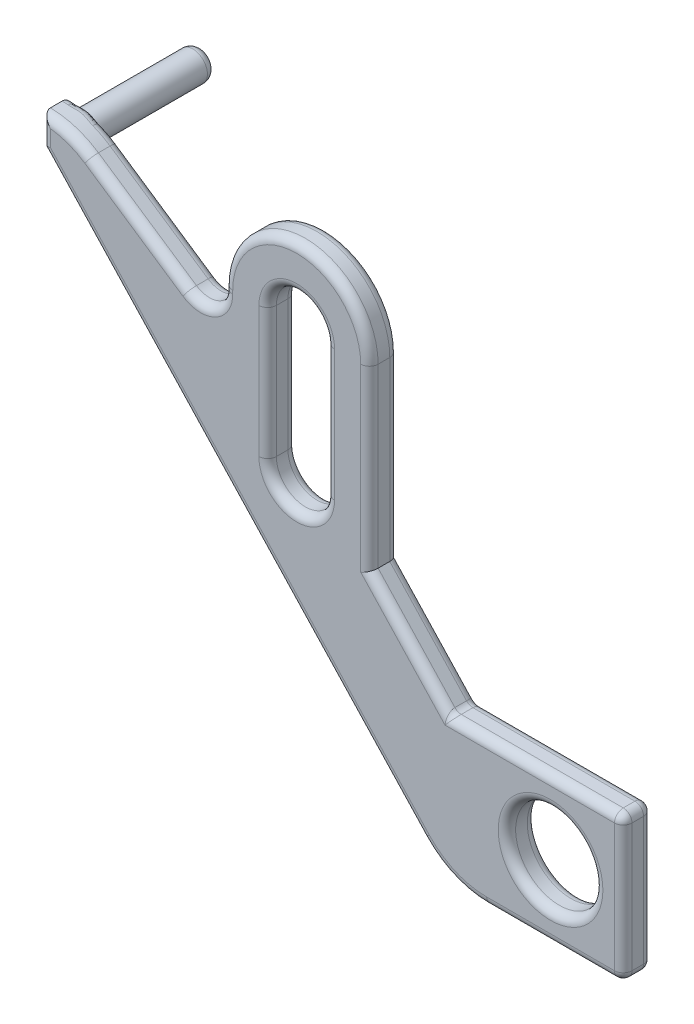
ISO-10303-21;
HEADER;
FILE_DESCRIPTION(('STEP AP214'),'2;1');
FILE_NAME('part.step','',(''),(''),'','','');
FILE_SCHEMA(('AUTOMOTIVE_DESIGN { 1 0 10303 214 1 1 1 1 }'));
ENDSEC;
DATA;
#1=APPLICATION_CONTEXT('core data for automotive mechanical design processes');
#2=APPLICATION_PROTOCOL_DEFINITION('international standard','automotive_design',2000,#1);
#3=PRODUCT_CONTEXT('',#1,'mechanical');
#4=PRODUCT('Part','Part','',(#3));
#5=PRODUCT_RELATED_PRODUCT_CATEGORY('part','',(#4));
#6=PRODUCT_DEFINITION_FORMATION('','',#4);
#7=PRODUCT_DEFINITION_CONTEXT('part definition',#1,'design');
#8=PRODUCT_DEFINITION('design','',#6,#7);
#9=PRODUCT_DEFINITION_SHAPE('','',#8);
#10=(LENGTH_UNIT() NAMED_UNIT(*) SI_UNIT(.MILLI.,.METRE.));
#11=(NAMED_UNIT(*) PLANE_ANGLE_UNIT() SI_UNIT($,.RADIAN.));
#12=(NAMED_UNIT(*) SI_UNIT($,.STERADIAN.) SOLID_ANGLE_UNIT());
#13=UNCERTAINTY_MEASURE_WITH_UNIT(LENGTH_MEASURE(1.E-05),#10,'distance_accuracy_value','');
#14=(GEOMETRIC_REPRESENTATION_CONTEXT(3) GLOBAL_UNCERTAINTY_ASSIGNED_CONTEXT((#13)) GLOBAL_UNIT_ASSIGNED_CONTEXT((#10,
#11,#12)) REPRESENTATION_CONTEXT('',''));
#15=CARTESIAN_POINT('',(0.,0.,0.));
#16=DIRECTION('',(0.,0.,1.));
#17=DIRECTION('',(1.,0.,0.));
#18=AXIS2_PLACEMENT_3D('',#15,#16,#17);
#19=CARTESIAN_POINT('',(-8.72927300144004,11.5,0.));
#20=DIRECTION('',(0.,0.,1.));
#21=DIRECTION('',(1.,0.,0.));
#22=AXIS2_PLACEMENT_3D('',#19,#20,#21);
#23=PLANE('',#22);
#24=DIRECTION('',(0.,-1.,0.));
#25=VECTOR('',#24,1.);
#26=CARTESIAN_POINT('',(-17.5,12.5,0.));
#27=LINE('',#26,#25);
#28=CARTESIAN_POINT('',(-17.5,13.1999896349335,0.));
#29=VERTEX_POINT('',#28);
#30=CARTESIAN_POINT('',(-17.5,12.8013202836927,0.));
#31=VERTEX_POINT('',#30);
#32=EDGE_CURVE('E292',#29,#31,#27,.T.);
#33=ORIENTED_EDGE('',*,*,#32,.F.);
#34=CARTESIAN_POINT('',(-17.5236576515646,10.5000932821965,0.));
#35=DIRECTION('',(0.,0.,1.));
#36=DIRECTION('',(1.,0.,0.));
#37=AXIS2_PLACEMENT_3D('',#34,#35,#36);
#38=CIRCLE('',#37,2.7);
#39=CARTESIAN_POINT('',(-17.3122826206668,13.1918066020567,0.));
#40=VERTEX_POINT('',#39);
#41=EDGE_CURVE('E318',#29,#40,#38,.F.);
#42=ORIENTED_EDGE('',*,*,#41,.T.);
#43=CARTESIAN_POINT('',(-17.,12.8013202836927,0.));
#44=DIRECTION('',(0.,0.,-1.));
#45=DIRECTION('',(-1.,0.,0.));
#46=AXIS2_PLACEMENT_3D('',#43,#44,#45);
#47=CIRCLE('',#46,0.499999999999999);
#48=EDGE_CURVE('E311',#31,#40,#47,.T.);
#49=ORIENTED_EDGE('',*,*,#48,.F.);
#50=EDGE_LOOP('',(#33,#42,#49));
#51=FACE_BOUND('',#50,.T.);
#52=ADVANCED_FACE('F32',(#51),#23,.F.);
#53=CARTESIAN_POINT('',(-8.72927300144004,7.,0.));
#54=DIRECTION('',(0.,0.,1.));
#55=DIRECTION('',(1.,0.,0.));
#56=AXIS2_PLACEMENT_3D('',#53,#54,#55);
#57=CIRCLE('',#56,1.3);
#58=CARTESIAN_POINT('',(-10.02927300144,7.,0.));
#59=VERTEX_POINT('',#58);
#60=CARTESIAN_POINT('',(-7.42927300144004,7.,0.));
#61=VERTEX_POINT('',#60);
#62=EDGE_CURVE('E600',#59,#61,#57,.T.);
#63=ORIENTED_EDGE('',*,*,#62,.T.);
#64=DIRECTION('',(0.,1.,0.));
#65=VECTOR('',#64,1.);
#66=CARTESIAN_POINT('',(-7.42927300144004,11.5,0.));
#67=LINE('',#66,#65);
#68=CARTESIAN_POINT('',(-7.42927300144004,11.5,0.));
#69=VERTEX_POINT('',#68);
#70=EDGE_CURVE('E624',#61,#69,#67,.T.);
#71=ORIENTED_EDGE('',*,*,#70,.T.);
#72=CARTESIAN_POINT('',(-8.72927300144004,11.5,0.));
#73=DIRECTION('',(0.,0.,1.));
#74=DIRECTION('',(1.,0.,0.));
#75=AXIS2_PLACEMENT_3D('',#72,#73,#74);
#76=CIRCLE('',#75,1.3);
#77=CARTESIAN_POINT('',(-10.02927300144,11.5,0.));
#78=VERTEX_POINT('',#77);
#79=EDGE_CURVE('E622',#69,#78,#76,.T.);
#80=ORIENTED_EDGE('',*,*,#79,.T.);
#81=DIRECTION('',(0.,-1.,0.));
#82=VECTOR('',#81,1.);
#83=CARTESIAN_POINT('',(-10.02927300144,7.,0.));
#84=LINE('',#83,#82);
#85=EDGE_CURVE('E619',#78,#59,#84,.T.);
#86=ORIENTED_EDGE('',*,*,#85,.T.);
#87=EDGE_LOOP('',(#63,#71,#80,#86));
#88=FACE_BOUND('',#87,.T.);
#89=CARTESIAN_POINT('',(0.,0.,0.));
#90=DIRECTION('',(0.,0.,1.));
#91=DIRECTION('',(1.,0.,0.));
#92=AXIS2_PLACEMENT_3D('',#89,#90,#91);
#93=CIRCLE('',#92,1.8);
#94=CARTESIAN_POINT('',(1.8,0.,0.));
#95=VERTEX_POINT('',#94);
#96=EDGE_CURVE('E605',#95,#95,#93,.T.);
#97=ORIENTED_EDGE('',*,*,#96,.T.);
#98=EDGE_LOOP('',(#97));
#99=FACE_BOUND('',#98,.T.);
#100=CARTESIAN_POINT('',(-16.5495006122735,13.0182310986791,0.));
#101=VERTEX_POINT('',#100);
#102=CARTESIAN_POINT('',(-16.9115583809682,12.3092043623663,0.));
#103=VERTEX_POINT('',#102);
#104=EDGE_CURVE('E313',#101,#103,#47,.T.);
#105=ORIENTED_EDGE('',*,*,#104,.F.);
#106=CARTESIAN_POINT('',(-17.5236576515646,10.5000932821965,0.));
#107=DIRECTION('',(0.,0.,1.));
#108=DIRECTION('',(1.,0.,0.));
#109=AXIS2_PLACEMENT_3D('',#106,#107,#108);
#110=CIRCLE('',#109,2.7);
#111=CARTESIAN_POINT('',(-16.0153869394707,12.7395395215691,0.));
#112=VERTEX_POINT('',#111);
#113=EDGE_CURVE('E606',#101,#112,#110,.F.);
#114=ORIENTED_EDGE('',*,*,#113,.T.);
#115=DIRECTION('',(-0.829424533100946,0.558618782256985,0.));
#116=VECTOR('',#115,1.);
#117=CARTESIAN_POINT('',(-10.4286223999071,8.97684444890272,0.));
#118=LINE('',#117,#116);
#119=CARTESIAN_POINT('',(-12.6437536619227,10.4687389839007,0.));
#120=VERTEX_POINT('',#119);
#121=EDGE_CURVE('E611',#112,#120,#118,.F.);
#122=ORIENTED_EDGE('',*,*,#121,.T.);
#123=CARTESIAN_POINT('',(-12.02927300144,11.3811059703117,0.));
#124=DIRECTION('',(0.,0.,1.));
#125=DIRECTION('',(1.,0.,0.));
#126=AXIS2_PLACEMENT_3D('',#123,#124,#125);
#127=CIRCLE('',#126,1.1);
#128=CARTESIAN_POINT('',(-10.92927300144,11.3811059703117,0.));
#129=VERTEX_POINT('',#128);
#130=EDGE_CURVE('E614',#120,#129,#127,.T.);
#131=ORIENTED_EDGE('',*,*,#130,.T.);
#132=DIRECTION('',(0.,-1.,0.));
#133=VECTOR('',#132,1.);
#134=CARTESIAN_POINT('',(-10.92927300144,11.5,0.));
#135=LINE('',#134,#133);
#136=CARTESIAN_POINT('',(-10.92927300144,11.5,0.));
#137=VERTEX_POINT('',#136);
#138=EDGE_CURVE('E700',#129,#137,#135,.F.);
#139=ORIENTED_EDGE('',*,*,#138,.T.);
#140=CARTESIAN_POINT('',(-8.72927300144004,11.5,0.));
#141=DIRECTION('',(0.,0.,1.));
#142=DIRECTION('',(1.,0.,0.));
#143=AXIS2_PLACEMENT_3D('',#140,#141,#142);
#144=CIRCLE('',#143,2.2);
#145=CARTESIAN_POINT('',(-6.52927300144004,11.5,0.));
#146=VERTEX_POINT('',#145);
#147=EDGE_CURVE('E709',#137,#146,#144,.F.);
#148=ORIENTED_EDGE('',*,*,#147,.T.);
#149=DIRECTION('',(0.,1.,0.));
#150=VECTOR('',#149,1.);
#151=CARTESIAN_POINT('',(-6.52927300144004,11.5,0.));
#152=LINE('',#151,#150);
#153=CARTESIAN_POINT('',(-6.52927300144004,5.30597211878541,0.));
#154=VERTEX_POINT('',#153);
#155=EDGE_CURVE('E711',#146,#154,#152,.F.);
#156=ORIENTED_EDGE('',*,*,#155,.T.);
#157=DIRECTION('',(-0.682318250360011,0.731055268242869,0.));
#158=VECTOR('',#157,1.);
#159=CARTESIAN_POINT('',(-10.643158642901,9.71370673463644,0.));
#160=LINE('',#159,#158);
#161=CARTESIAN_POINT('',(-3.80826747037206,2.39060904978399,0.));
#162=VERTEX_POINT('',#161);
#163=EDGE_CURVE('E718',#154,#162,#160,.F.);
#164=ORIENTED_EDGE('',*,*,#163,.T.);
#165=CARTESIAN_POINT('',(-3.36963430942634,2.8,0.));
#166=DIRECTION('',(0.,0.,1.));
#167=DIRECTION('',(1.,0.,0.));
#168=AXIS2_PLACEMENT_3D('',#165,#166,#167);
#169=CIRCLE('',#168,0.6);
#170=CARTESIAN_POINT('',(-3.36963430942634,2.2,0.));
#171=VERTEX_POINT('',#170);
#172=EDGE_CURVE('E720',#171,#162,#169,.F.);
#173=ORIENTED_EDGE('',*,*,#172,.F.);
#174=DIRECTION('',(-1.,0.,0.));
#175=VECTOR('',#174,1.);
#176=CARTESIAN_POINT('',(-8.72927300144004,2.2,0.));
#177=LINE('',#176,#175);
#178=CARTESIAN_POINT('',(2.2,2.2,0.));
#179=VERTEX_POINT('',#178);
#180=EDGE_CURVE('E723',#171,#179,#177,.F.);
#181=ORIENTED_EDGE('',*,*,#180,.T.);
#182=DIRECTION('',(0.,1.,0.));
#183=VECTOR('',#182,1.);
#184=CARTESIAN_POINT('',(2.2,11.5,0.));
#185=LINE('',#184,#183);
#186=CARTESIAN_POINT('',(2.2,-2.2,0.));
#187=VERTEX_POINT('',#186);
#188=EDGE_CURVE('E727',#179,#187,#185,.F.);
#189=ORIENTED_EDGE('',*,*,#188,.T.);
#190=DIRECTION('',(1.,0.,0.));
#191=VECTOR('',#190,1.);
#192=CARTESIAN_POINT('',(-8.72927300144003,-2.2,0.));
#193=LINE('',#192,#191);
#194=CARTESIAN_POINT('',(-2.19634309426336,-2.2,0.));
#195=VERTEX_POINT('',#194);
#196=EDGE_CURVE('E725',#187,#195,#193,.F.);
#197=ORIENTED_EDGE('',*,*,#196,.T.);
#198=CARTESIAN_POINT('',(-2.19634309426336,0.5,0.));
#199=DIRECTION('',(0.,0.,1.));
#200=DIRECTION('',(1.,0.,0.));
#201=AXIS2_PLACEMENT_3D('',#198,#199,#200);
#202=CIRCLE('',#201,2.7);
#203=CARTESIAN_POINT('',(-4.17019231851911,-1.34225927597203,0.));
#204=VERTEX_POINT('',#203);
#205=EDGE_CURVE('E716',#195,#204,#202,.F.);
#206=ORIENTED_EDGE('',*,*,#205,.T.);
#207=DIRECTION('',(0.682318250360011,-0.731055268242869,0.));
#208=VECTOR('',#207,1.);
#209=CARTESIAN_POINT('',(-12.698587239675,7.79530671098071,0.));
#210=LINE('',#209,#208);
#211=EDGE_CURVE('E608',#204,#103,#210,.F.);
#212=ORIENTED_EDGE('',*,*,#211,.T.);
#213=EDGE_LOOP('',(#105,#114,#122,#131,#139,#148,#156,#164,#173,#181,#189,#197,#206,#212));
#214=FACE_BOUND('',#213,.T.);
#215=ADVANCED_FACE('F444',(#88,#99,#214),#23,.F.);
#216=CARTESIAN_POINT('',(-8.72927300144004,11.5,1.));
#217=DIRECTION('',(0.,0.,1.));
#218=DIRECTION('',(1.,0.,0.));
#219=AXIS2_PLACEMENT_3D('',#216,#217,#218);
#220=PLANE('',#219);
#221=DIRECTION('',(0.,1.,0.));
#222=VECTOR('',#221,1.);
#223=CARTESIAN_POINT('',(-7.42927300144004,11.5,1.));
#224=LINE('',#223,#222);
#225=CARTESIAN_POINT('',(-7.42927300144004,11.5,1.));
#226=VERTEX_POINT('',#225);
#227=CARTESIAN_POINT('',(-7.42927300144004,7.,1.));
#228=VERTEX_POINT('',#227);
#229=EDGE_CURVE('E772',#226,#228,#224,.F.);
#230=ORIENTED_EDGE('',*,*,#229,.T.);
#231=CARTESIAN_POINT('',(-8.72927300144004,7.,1.));
#232=DIRECTION('',(0.,0.,1.));
#233=DIRECTION('',(1.,0.,0.));
#234=AXIS2_PLACEMENT_3D('',#231,#232,#233);
#235=CIRCLE('',#234,1.3);
#236=CARTESIAN_POINT('',(-10.02927300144,7.,1.));
#237=VERTEX_POINT('',#236);
#238=EDGE_CURVE('E769',#228,#237,#235,.F.);
#239=ORIENTED_EDGE('',*,*,#238,.T.);
#240=DIRECTION('',(0.,-1.,0.));
#241=VECTOR('',#240,1.);
#242=CARTESIAN_POINT('',(-10.02927300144,11.5,1.));
#243=LINE('',#242,#241);
#244=CARTESIAN_POINT('',(-10.02927300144,11.5,1.));
#245=VERTEX_POINT('',#244);
#246=EDGE_CURVE('E776',#237,#245,#243,.F.);
#247=ORIENTED_EDGE('',*,*,#246,.T.);
#248=CARTESIAN_POINT('',(-8.72927300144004,11.5,1.));
#249=DIRECTION('',(0.,0.,1.));
#250=DIRECTION('',(1.,0.,0.));
#251=AXIS2_PLACEMENT_3D('',#248,#249,#250);
#252=CIRCLE('',#251,1.3);
#253=EDGE_CURVE('E774',#245,#226,#252,.F.);
#254=ORIENTED_EDGE('',*,*,#253,.T.);
#255=EDGE_LOOP('',(#230,#239,#247,#254));
#256=FACE_BOUND('',#255,.T.);
#257=DIRECTION('',(0.,-1.,0.));
#258=VECTOR('',#257,1.);
#259=CARTESIAN_POINT('',(-10.92927300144,11.3811059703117,1.));
#260=LINE('',#259,#258);
#261=CARTESIAN_POINT('',(-10.92927300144,11.5,1.));
#262=VERTEX_POINT('',#261);
#263=CARTESIAN_POINT('',(-10.92927300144,11.3811059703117,1.));
#264=VERTEX_POINT('',#263);
#265=EDGE_CURVE('E781',#262,#264,#260,.T.);
#266=ORIENTED_EDGE('',*,*,#265,.T.);
#267=CARTESIAN_POINT('',(-12.02927300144,11.3811059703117,1.));
#268=DIRECTION('',(0.,0.,1.));
#269=DIRECTION('',(1.,0.,0.));
#270=AXIS2_PLACEMENT_3D('',#267,#268,#269);
#271=CIRCLE('',#270,1.1);
#272=CARTESIAN_POINT('',(-12.6437536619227,10.4687389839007,1.));
#273=VERTEX_POINT('',#272);
#274=EDGE_CURVE('E778',#264,#273,#271,.F.);
#275=ORIENTED_EDGE('',*,*,#274,.T.);
#276=DIRECTION('',(-0.829424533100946,0.558618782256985,0.));
#277=VECTOR('',#276,1.);
#278=CARTESIAN_POINT('',(-16.0153869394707,12.7395395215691,1.));
#279=LINE('',#278,#277);
#280=CARTESIAN_POINT('',(-16.0153869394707,12.7395395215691,1.));
#281=VERTEX_POINT('',#280);
#282=EDGE_CURVE('E806',#273,#281,#279,.T.);
#283=ORIENTED_EDGE('',*,*,#282,.T.);
#284=CARTESIAN_POINT('',(-17.5236576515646,10.5000932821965,1.));
#285=DIRECTION('',(0.,0.,1.));
#286=DIRECTION('',(1.,0.,0.));
#287=AXIS2_PLACEMENT_3D('',#284,#285,#286);
#288=CIRCLE('',#287,2.7);
#289=CARTESIAN_POINT('',(-17.2,13.180624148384,1.));
#290=VERTEX_POINT('',#289);
#291=EDGE_CURVE('E804',#281,#290,#288,.T.);
#292=ORIENTED_EDGE('',*,*,#291,.T.);
#293=DIRECTION('',(0.,-1.,0.));
#294=VECTOR('',#293,1.);
#295=CARTESIAN_POINT('',(-17.2,12.5,1.));
#296=LINE('',#295,#294);
#297=CARTESIAN_POINT('',(-17.2,12.6182489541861,1.));
#298=VERTEX_POINT('',#297);
#299=EDGE_CURVE('E802',#290,#298,#296,.T.);
#300=ORIENTED_EDGE('',*,*,#299,.T.);
#301=DIRECTION('',(0.682318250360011,-0.731055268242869,0.));
#302=VECTOR('',#301,1.);
#303=CARTESIAN_POINT('',(-4.17019231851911,-1.34225927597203,1.));
#304=LINE('',#303,#302);
#305=CARTESIAN_POINT('',(-4.17019231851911,-1.34225927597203,1.));
#306=VERTEX_POINT('',#305);
#307=EDGE_CURVE('E800',#298,#306,#304,.T.);
#308=ORIENTED_EDGE('',*,*,#307,.T.);
#309=CARTESIAN_POINT('',(-2.19634309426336,0.5,1.));
#310=DIRECTION('',(0.,0.,1.));
#311=DIRECTION('',(1.,0.,0.));
#312=AXIS2_PLACEMENT_3D('',#309,#310,#311);
#313=CIRCLE('',#312,2.7);
#314=CARTESIAN_POINT('',(-2.19634309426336,-2.2,1.));
#315=VERTEX_POINT('',#314);
#316=EDGE_CURVE('E798',#306,#315,#313,.T.);
#317=ORIENTED_EDGE('',*,*,#316,.T.);
#318=DIRECTION('',(1.,0.,0.));
#319=VECTOR('',#318,1.);
#320=CARTESIAN_POINT('',(2.5,-2.2,1.));
#321=LINE('',#320,#319);
#322=CARTESIAN_POINT('',(2.2,-2.2,1.));
#323=VERTEX_POINT('',#322);
#324=EDGE_CURVE('E795',#315,#323,#321,.T.);
#325=ORIENTED_EDGE('',*,*,#324,.T.);
#326=DIRECTION('',(0.,1.,0.));
#327=VECTOR('',#326,1.);
#328=CARTESIAN_POINT('',(2.2,2.5,1.));
#329=LINE('',#328,#327);
#330=CARTESIAN_POINT('',(2.2,2.2,1.));
#331=VERTEX_POINT('',#330);
#332=EDGE_CURVE('E792',#323,#331,#329,.T.);
#333=ORIENTED_EDGE('',*,*,#332,.T.);
#334=DIRECTION('',(-1.,0.,0.));
#335=VECTOR('',#334,1.);
#336=CARTESIAN_POINT('',(-3.5,2.2,1.));
#337=LINE('',#336,#335);
#338=CARTESIAN_POINT('',(-3.63036569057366,2.2,1.));
#339=VERTEX_POINT('',#338);
#340=EDGE_CURVE('E789',#331,#339,#337,.T.);
#341=ORIENTED_EDGE('',*,*,#340,.T.);
#342=DIRECTION('',(-0.682318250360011,0.731055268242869,0.));
#343=VECTOR('',#342,1.);
#344=CARTESIAN_POINT('',(-6.4485895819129,5.21952559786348,1.));
#345=LINE('',#344,#343);
#346=CARTESIAN_POINT('',(-6.52927300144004,5.30597211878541,1.));
#347=VERTEX_POINT('',#346);
#348=EDGE_CURVE('E787',#339,#347,#345,.T.);
#349=ORIENTED_EDGE('',*,*,#348,.T.);
#350=DIRECTION('',(0.,1.,0.));
#351=VECTOR('',#350,1.);
#352=CARTESIAN_POINT('',(-6.52927300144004,11.5,1.));
#353=LINE('',#352,#351);
#354=CARTESIAN_POINT('',(-6.52927300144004,11.5,1.));
#355=VERTEX_POINT('',#354);
#356=EDGE_CURVE('E785',#347,#355,#353,.T.);
#357=ORIENTED_EDGE('',*,*,#356,.T.);
#358=CARTESIAN_POINT('',(-8.72927300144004,11.5,1.));
#359=DIRECTION('',(0.,0.,1.));
#360=DIRECTION('',(1.,0.,0.));
#361=AXIS2_PLACEMENT_3D('',#358,#359,#360);
#362=CIRCLE('',#361,2.2);
#363=EDGE_CURVE('E783',#355,#262,#362,.T.);
#364=ORIENTED_EDGE('',*,*,#363,.T.);
#365=EDGE_LOOP('',(#266,#275,#283,#292,#300,#308,#317,#325,#333,#341,#349,#357,#364));
#366=FACE_BOUND('',#365,.T.);
#367=CARTESIAN_POINT('',(0.,0.,1.));
#368=DIRECTION('',(0.,0.,1.));
#369=DIRECTION('',(1.,0.,0.));
#370=AXIS2_PLACEMENT_3D('',#367,#368,#369);
#371=CIRCLE('',#370,1.8);
#372=CARTESIAN_POINT('',(1.8,0.,1.));
#373=VERTEX_POINT('',#372);
#374=EDGE_CURVE('E808',#373,#373,#371,.F.);
#375=ORIENTED_EDGE('',*,*,#374,.T.);
#376=EDGE_LOOP('',(#375));
#377=FACE_BOUND('',#376,.T.);
#378=ADVANCED_FACE('F374',(#256,#366,#377),#220,.T.);
#379=CARTESIAN_POINT('',(2.5,2.5,1.));
#380=DIRECTION('',(0.,-1.,0.));
#381=DIRECTION('',(1.,0.,0.));
#382=AXIS2_PLACEMENT_3D('',#379,#380,#381);
#383=PLANE('',#382);
#384=DIRECTION('',(-1.,0.,0.));
#385=VECTOR('',#384,1.);
#386=CARTESIAN_POINT('',(2.5,2.5,0.3));
#387=LINE('',#386,#385);
#388=CARTESIAN_POINT('',(2.2,2.5,0.3));
#389=VERTEX_POINT('',#388);
#390=CARTESIAN_POINT('',(-3.36963430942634,2.5,0.3));
#391=VERTEX_POINT('',#390);
#392=EDGE_CURVE('E652',#389,#391,#387,.T.);
#393=ORIENTED_EDGE('',*,*,#392,.T.);
#394=DIRECTION('',(0.,0.,-1.));
#395=VECTOR('',#394,1.);
#396=CARTESIAN_POINT('',(-3.36963430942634,2.5,0.7));
#397=LINE('',#396,#395);
#398=CARTESIAN_POINT('',(-3.36963430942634,2.5,0.7));
#399=VERTEX_POINT('',#398);
#400=EDGE_CURVE('E656',#391,#399,#397,.F.);
#401=ORIENTED_EDGE('',*,*,#400,.T.);
#402=DIRECTION('',(-1.,0.,0.));
#403=VECTOR('',#402,1.);
#404=CARTESIAN_POINT('',(2.5,2.5,0.7));
#405=LINE('',#404,#403);
#406=CARTESIAN_POINT('',(2.2,2.5,0.7));
#407=VERTEX_POINT('',#406);
#408=EDGE_CURVE('E748',#399,#407,#405,.F.);
#409=ORIENTED_EDGE('',*,*,#408,.T.);
#410=DIRECTION('',(0.,0.,-1.));
#411=VECTOR('',#410,1.);
#412=CARTESIAN_POINT('',(2.2,2.5,1.));
#413=LINE('',#412,#411);
#414=EDGE_CURVE('E654',#407,#389,#413,.T.);
#415=ORIENTED_EDGE('',*,*,#414,.T.);
#416=EDGE_LOOP('',(#393,#401,#409,#415));
#417=FACE_BOUND('',#416,.T.);
#418=ADVANCED_FACE('F371',(#417),#383,.F.);
#419=CARTESIAN_POINT('',(-3.5,2.5,1.));
#420=DIRECTION('',(-0.731055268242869,-0.682318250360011,0.));
#421=DIRECTION('',(0.682318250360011,-0.731055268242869,0.));
#422=AXIS2_PLACEMENT_3D('',#419,#420,#421);
#423=PLANE('',#422);
#424=DIRECTION('',(-0.682318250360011,0.731055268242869,0.));
#425=VECTOR('',#424,1.);
#426=CARTESIAN_POINT('',(-3.5,2.5,0.7));
#427=LINE('',#426,#425);
#428=CARTESIAN_POINT('',(-6.22927300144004,5.42422107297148,0.7));
#429=VERTEX_POINT('',#428);
#430=CARTESIAN_POINT('',(-3.5889508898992,2.595304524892,0.7));
#431=VERTEX_POINT('',#430);
#432=EDGE_CURVE('E751',#429,#431,#427,.F.);
#433=ORIENTED_EDGE('',*,*,#432,.T.);
#434=DIRECTION('',(0.,0.,-1.));
#435=VECTOR('',#434,1.);
#436=CARTESIAN_POINT('',(-3.5889508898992,2.595304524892,0.));
#437=LINE('',#436,#435);
#438=CARTESIAN_POINT('',(-3.5889508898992,2.595304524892,0.3));
#439=VERTEX_POINT('',#438);
#440=EDGE_CURVE('E650',#431,#439,#437,.T.);
#441=ORIENTED_EDGE('',*,*,#440,.T.);
#442=DIRECTION('',(-0.682318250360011,0.731055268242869,0.));
#443=VECTOR('',#442,1.);
#444=CARTESIAN_POINT('',(-3.5,2.5,0.3));
#445=LINE('',#444,#443);
#446=CARTESIAN_POINT('',(-6.22927300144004,5.42422107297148,0.3));
#447=VERTEX_POINT('',#446);
#448=EDGE_CURVE('E648',#439,#447,#445,.T.);
#449=ORIENTED_EDGE('',*,*,#448,.T.);
#450=DIRECTION('',(0.,0.,-1.));
#451=VECTOR('',#450,1.);
#452=CARTESIAN_POINT('',(-6.22927300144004,5.42422107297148,1.));
#453=LINE('',#452,#451);
#454=EDGE_CURVE('E825',#429,#447,#453,.T.);
#455=ORIENTED_EDGE('',*,*,#454,.F.);
#456=EDGE_LOOP('',(#433,#441,#449,#455));
#457=FACE_BOUND('',#456,.T.);
#458=ADVANCED_FACE('F367',(#457),#423,.F.);
#459=CARTESIAN_POINT('',(-6.22927300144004,5.42422107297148,1.));
#460=DIRECTION('',(-1.,0.,0.));
#461=DIRECTION('',(0.,0.,1.));
#462=AXIS2_PLACEMENT_3D('',#459,#460,#461);
#463=PLANE('',#462);
#464=ORIENTED_EDGE('',*,*,#454,.T.);
#465=DIRECTION('',(0.,1.,0.));
#466=VECTOR('',#465,1.);
#467=CARTESIAN_POINT('',(-6.22927300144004,5.42422107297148,0.3));
#468=LINE('',#467,#466);
#469=CARTESIAN_POINT('',(-6.22927300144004,11.5,0.3));
#470=VERTEX_POINT('',#469);
#471=EDGE_CURVE('E675',#447,#470,#468,.T.);
#472=ORIENTED_EDGE('',*,*,#471,.T.);
#473=DIRECTION('',(0.,0.,-1.));
#474=VECTOR('',#473,1.);
#475=CARTESIAN_POINT('',(-6.22927300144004,11.5,1.));
#476=LINE('',#475,#474);
#477=CARTESIAN_POINT('',(-6.22927300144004,11.5,0.7));
#478=VERTEX_POINT('',#477);
#479=EDGE_CURVE('E828',#478,#470,#476,.T.);
#480=ORIENTED_EDGE('',*,*,#479,.F.);
#481=DIRECTION('',(0.,1.,0.));
#482=VECTOR('',#481,1.);
#483=CARTESIAN_POINT('',(-6.22927300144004,5.42422107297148,0.7));
#484=LINE('',#483,#482);
#485=EDGE_CURVE('E754',#478,#429,#484,.F.);
#486=ORIENTED_EDGE('',*,*,#485,.T.);
#487=EDGE_LOOP('',(#464,#472,#480,#486));
#488=FACE_BOUND('',#487,.T.);
#489=ADVANCED_FACE('F363',(#488),#463,.F.);
#490=CARTESIAN_POINT('',(-8.72927300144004,11.5,1.));
#491=DIRECTION('',(0.,0.,-1.));
#492=DIRECTION('',(-1.,0.,0.));
#493=AXIS2_PLACEMENT_3D('',#490,#491,#492);
#494=CYLINDRICAL_SURFACE('',#493,2.5);
#495=ORIENTED_EDGE('',*,*,#479,.T.);
#496=CARTESIAN_POINT('',(-8.72927300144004,11.5,0.3));
#497=DIRECTION('',(0.,0.,1.));
#498=DIRECTION('',(1.,0.,0.));
#499=AXIS2_PLACEMENT_3D('',#496,#497,#498);
#500=CIRCLE('',#499,2.5);
#501=CARTESIAN_POINT('',(-11.22927300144,11.5,0.3));
#502=VERTEX_POINT('',#501);
#503=EDGE_CURVE('E677',#470,#502,#500,.T.);
#504=ORIENTED_EDGE('',*,*,#503,.T.);
#505=DIRECTION('',(0.,0.,-1.));
#506=VECTOR('',#505,1.);
#507=CARTESIAN_POINT('',(-11.22927300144,11.5,1.));
#508=LINE('',#507,#506);
#509=CARTESIAN_POINT('',(-11.22927300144,11.5,0.7));
#510=VERTEX_POINT('',#509);
#511=EDGE_CURVE('E831',#510,#502,#508,.T.);
#512=ORIENTED_EDGE('',*,*,#511,.F.);
#513=CARTESIAN_POINT('',(-8.72927300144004,11.5,0.7));
#514=DIRECTION('',(0.,0.,1.));
#515=DIRECTION('',(1.,0.,0.));
#516=AXIS2_PLACEMENT_3D('',#513,#514,#515);
#517=CIRCLE('',#516,2.5);
#518=EDGE_CURVE('E756',#510,#478,#517,.F.);
#519=ORIENTED_EDGE('',*,*,#518,.T.);
#520=EDGE_LOOP('',(#495,#504,#512,#519));
#521=FACE_BOUND('',#520,.T.);
#522=ADVANCED_FACE('F359',(#521),#494,.T.);
#523=CARTESIAN_POINT('',(-11.22927300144,9.87778050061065,1.));
#524=DIRECTION('',(1.,0.,0.));
#525=DIRECTION('',(0.,0.,-1.));
#526=AXIS2_PLACEMENT_3D('',#523,#524,#525);
#527=PLANE('',#526);
#528=ORIENTED_EDGE('',*,*,#511,.T.);
#529=DIRECTION('',(0.,-1.,0.));
#530=VECTOR('',#529,1.);
#531=CARTESIAN_POINT('',(-11.22927300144,9.87778050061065,0.3));
#532=LINE('',#531,#530);
#533=CARTESIAN_POINT('',(-11.22927300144,11.3811059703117,0.3));
#534=VERTEX_POINT('',#533);
#535=EDGE_CURVE('E646',#502,#534,#532,.T.);
#536=ORIENTED_EDGE('',*,*,#535,.T.);
#537=DIRECTION('',(0.,0.,-1.));
#538=VECTOR('',#537,1.);
#539=CARTESIAN_POINT('',(-11.22927300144,11.3811059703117,1.));
#540=LINE('',#539,#538);
#541=CARTESIAN_POINT('',(-11.22927300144,11.3811059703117,0.7));
#542=VERTEX_POINT('',#541);
#543=EDGE_CURVE('E820',#534,#542,#540,.F.);
#544=ORIENTED_EDGE('',*,*,#543,.T.);
#545=DIRECTION('',(0.,-1.,0.));
#546=VECTOR('',#545,1.);
#547=CARTESIAN_POINT('',(-11.22927300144,11.5,0.7));
#548=LINE('',#547,#546);
#549=EDGE_CURVE('E758',#542,#510,#548,.F.);
#550=ORIENTED_EDGE('',*,*,#549,.T.);
#551=EDGE_LOOP('',(#528,#536,#544,#550));
#552=FACE_BOUND('',#551,.T.);
#553=ADVANCED_FACE('F355',(#552),#527,.F.);
#554=CARTESIAN_POINT('',(-11.22927300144,9.87778050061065,1.));
#555=DIRECTION('',(-0.558618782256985,-0.829424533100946,0.));
#556=DIRECTION('',(0.829424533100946,-0.558618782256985,0.));
#557=AXIS2_PLACEMENT_3D('',#554,#555,#556);
#558=PLANE('',#557);
#559=DIRECTION('',(0.,0.,-1.));
#560=VECTOR('',#559,1.);
#561=CARTESIAN_POINT('',(-12.4761680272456,10.717566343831,0.));
#562=LINE('',#561,#560);
#563=CARTESIAN_POINT('',(-12.4761680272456,10.717566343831,0.7));
#564=VERTEX_POINT('',#563);
#565=CARTESIAN_POINT('',(-12.4761680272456,10.717566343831,0.3));
#566=VERTEX_POINT('',#565);
#567=EDGE_CURVE('E822',#564,#566,#562,.T.);
#568=ORIENTED_EDGE('',*,*,#567,.T.);
#569=DIRECTION('',(-0.829424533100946,0.558618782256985,0.));
#570=VECTOR('',#569,1.);
#571=CARTESIAN_POINT('',(-11.22927300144,9.87778050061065,0.3));
#572=LINE('',#571,#570);
#573=CARTESIAN_POINT('',(-15.8478013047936,12.9883668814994,0.3));
#574=VERTEX_POINT('',#573);
#575=EDGE_CURVE('E681',#566,#574,#572,.T.);
#576=ORIENTED_EDGE('',*,*,#575,.T.);
#577=DIRECTION('',(0.,0.,1.));
#578=VECTOR('',#577,1.);
#579=CARTESIAN_POINT('',(-15.8478013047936,12.9883668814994,1.));
#580=LINE('',#579,#578);
#581=CARTESIAN_POINT('',(-15.8478013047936,12.9883668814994,0.7));
#582=VERTEX_POINT('',#581);
#583=EDGE_CURVE('E692',#574,#582,#580,.T.);
#584=ORIENTED_EDGE('',*,*,#583,.T.);
#585=DIRECTION('',(-0.829424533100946,0.558618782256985,0.));
#586=VECTOR('',#585,1.);
#587=CARTESIAN_POINT('',(-12.4761680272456,10.717566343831,0.7));
#588=LINE('',#587,#586);
#589=EDGE_CURVE('E732',#582,#564,#588,.F.);
#590=ORIENTED_EDGE('',*,*,#589,.T.);
#591=EDGE_LOOP('',(#568,#576,#584,#590));
#592=FACE_BOUND('',#591,.T.);
#593=ADVANCED_FACE('F349',(#592),#558,.F.);
#594=CARTESIAN_POINT('',(-17.5,12.5,1.));
#595=DIRECTION('',(1.,0.,0.));
#596=DIRECTION('',(0.,0.,-1.));
#597=AXIS2_PLACEMENT_3D('',#594,#595,#596);
#598=PLANE('',#597);
#599=DIRECTION('',(0.,0.,-1.));
#600=VECTOR('',#599,1.);
#601=CARTESIAN_POINT('',(-17.5,13.5,1.));
#602=LINE('',#601,#600);
#603=CARTESIAN_POINT('',(-17.5,13.5,0.7));
#604=VERTEX_POINT('',#603);
#605=CARTESIAN_POINT('',(-17.5,13.5,0.3));
#606=VERTEX_POINT('',#605);
#607=EDGE_CURVE('E834',#604,#606,#602,.T.);
#608=ORIENTED_EDGE('',*,*,#607,.T.);
#609=CARTESIAN_POINT('',(-17.5,13.5,0.3));
#610=CARTESIAN_POINT('',(-17.5,13.5000143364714,0.283122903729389));
#611=CARTESIAN_POINT('',(-17.5,13.4985766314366,0.266250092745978));
#612=CARTESIAN_POINT('',(-17.5,13.4929029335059,0.232994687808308));
#613=CARTESIAN_POINT('',(-17.5,13.4886691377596,0.216611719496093));
#614=CARTESIAN_POINT('',(-17.5,13.4775060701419,0.184782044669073));
#615=CARTESIAN_POINT('',(-17.5,13.4705755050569,0.169335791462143));
#616=CARTESIAN_POINT('',(-17.5,13.4542217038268,0.139828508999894));
#617=CARTESIAN_POINT('',(-17.5,13.4447989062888,0.125767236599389));
#618=CARTESIAN_POINT('',(-17.5,13.4237264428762,0.0994260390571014));
#619=CARTESIAN_POINT('',(-17.5,13.4120767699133,0.087146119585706));
#620=CARTESIAN_POINT('',(-17.5,13.3868785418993,0.0647138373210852));
#621=CARTESIAN_POINT('',(-17.5,13.3733296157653,0.054561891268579));
#622=CARTESIAN_POINT('',(-17.5,13.3447179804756,0.0366750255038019));
#623=CARTESIAN_POINT('',(-17.5,13.3296549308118,0.0289406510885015));
#624=CARTESIAN_POINT('',(-17.5,13.2984471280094,0.0161144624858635));
#625=CARTESIAN_POINT('',(-17.5,13.2823030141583,0.0110211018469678));
#626=CARTESIAN_POINT('',(-17.5,13.2550484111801,0.00488691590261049));
#627=CARTESIAN_POINT('',(-17.5,13.2441093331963,0.00305542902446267));
#628=CARTESIAN_POINT('',(-17.5,13.2221115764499,0.000612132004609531));
#629=CARTESIAN_POINT('',(-17.5,13.2110530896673,-1.40710485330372E-06));
#630=CARTESIAN_POINT('',(-17.5,13.1999896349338,-1.41931308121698E-12));
#631=B_SPLINE_CURVE_WITH_KNOTS('',3,(#609,#610,#611,#612,#613,#614,#615,#616,#617,#618,#619,
#620,#621,#622,#623,#624,#625,#626,#627,#628,#629,#630),.UNSPECIFIED.,.F.,.F.,(4,2,2,2,2,2,2,2,
2,2,4),(0.,0.0505640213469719,0.101088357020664,0.151636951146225,0.202176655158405,
0.252716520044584,0.303266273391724,0.353827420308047,0.40435892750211,0.437569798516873,
0.470733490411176),.UNSPECIFIED.);
#632=EDGE_CURVE('E297',#606,#29,#631,.T.);
#633=ORIENTED_EDGE('',*,*,#632,.T.);
#634=ORIENTED_EDGE('',*,*,#32,.T.);
#635=CARTESIAN_POINT('',(-17.4753528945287,12.9563674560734,0.));
#636=CARTESIAN_POINT('',(-17.7122187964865,12.7273772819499,-0.0319247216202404));
#637=CARTESIAN_POINT('',(-17.7524986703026,12.7705342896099,0.293768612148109));
#638=CARTESIAN_POINT('',(-17.4785132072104,12.9464899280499,0.));
#639=CARTESIAN_POINT('',(-17.7116271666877,12.7267433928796,-0.0216712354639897));
#640=CARTESIAN_POINT('',(-17.7360572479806,12.7529184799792,0.29816382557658));
#641=CARTESIAN_POINT('',(-17.4818893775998,12.9352847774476,0.));
#642=CARTESIAN_POINT('',(-17.7088813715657,12.7238014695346,-0.0103861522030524));
#643=CARTESIAN_POINT('',(-17.7194081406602,12.7350801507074,0.300121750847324));
#644=CARTESIAN_POINT('',(-17.4882851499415,12.9097620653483,0.));
#645=CARTESIAN_POINT('',(-17.6989317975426,12.7131412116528,0.0115836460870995));
#646=CARTESIAN_POINT('',(-17.6865360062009,12.6998600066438,0.299871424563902));
#647=CARTESIAN_POINT('',(-17.4913116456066,12.8955310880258,0.));
#648=CARTESIAN_POINT('',(-17.6920248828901,12.7057409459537,0.02222621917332));
#649=CARTESIAN_POINT('',(-17.6703129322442,12.6824781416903,0.297768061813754));
#650=CARTESIAN_POINT('',(-17.4973946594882,12.8571144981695,0.));
#651=CARTESIAN_POINT('',(-17.6708736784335,12.6830789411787,0.0449179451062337));
#652=CARTESIAN_POINT('',(-17.6323700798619,12.6418250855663,0.288875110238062));
#653=CARTESIAN_POINT('',(-17.5000542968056,12.8311923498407,0.));
#654=CARTESIAN_POINT('',(-17.6550754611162,12.6661522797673,0.0563513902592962));
#655=CARTESIAN_POINT('',(-17.610818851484,12.6187344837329,0.280648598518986));
#656=CARTESIAN_POINT('',(-17.4999717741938,12.7851587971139,0.));
#657=CARTESIAN_POINT('',(-17.6259510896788,12.6349475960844,0.0692144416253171));
#658=CARTESIAN_POINT('',(-17.5790181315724,12.5846622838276,0.265448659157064));
#659=CARTESIAN_POINT('',(-17.4992439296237,12.7684663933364,0.));
#660=CARTESIAN_POINT('',(-17.6154972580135,12.6237470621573,0.0727707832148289));
#661=CARTESIAN_POINT('',(-17.5684265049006,12.5733141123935,0.259851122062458));
#662=CARTESIAN_POINT('',(-17.4955796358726,12.7325568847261,0.));
#663=CARTESIAN_POINT('',(-17.5930862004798,12.5997352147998,0.0783931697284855));
#664=CARTESIAN_POINT('',(-17.5473805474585,12.550764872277,0.248131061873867));
#665=CARTESIAN_POINT('',(-17.4926432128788,12.7133398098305,0.));
#666=CARTESIAN_POINT('',(-17.5811584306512,12.586955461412,0.0804983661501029));
#667=CARTESIAN_POINT('',(-17.536926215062,12.5395638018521,0.242008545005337));
#668=CARTESIAN_POINT('',(-17.4820652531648,12.6657130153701,0.));
#669=CARTESIAN_POINT('',(-17.5518491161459,12.555552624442,0.0838275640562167));
#670=CARTESIAN_POINT('',(-17.5126295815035,12.5135316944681,0.227793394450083));
#671=CARTESIAN_POINT('',(-17.4732098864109,12.636339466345,0.));
#672=CARTESIAN_POINT('',(-17.5338181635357,12.5362337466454,0.0846302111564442));
#673=CARTESIAN_POINT('',(-17.4987841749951,12.4986973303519,0.21970347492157));
#674=CARTESIAN_POINT('',(-17.4535050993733,12.5901299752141,0.));
#675=CARTESIAN_POINT('',(-17.5048636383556,12.5052110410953,0.0848661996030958));
#676=CARTESIAN_POINT('',(-17.4777401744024,12.4761501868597,0.209252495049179));
#677=CARTESIAN_POINT('',(-17.445960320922,12.5745152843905,0.));
#678=CARTESIAN_POINT('',(-17.4950516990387,12.49469824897,0.0847934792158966));
#679=CARTESIAN_POINT('',(-17.4707423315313,12.4686524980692,0.206070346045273));
#680=CARTESIAN_POINT('',(-17.4284907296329,12.5430115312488,0.));
#681=CARTESIAN_POINT('',(-17.4748782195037,12.4730838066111,0.0845355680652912));
#682=CARTESIAN_POINT('',(-17.4565870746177,12.4534861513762,0.200618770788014));
#683=CARTESIAN_POINT('',(-17.4185686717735,12.5271228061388,0.));
#684=CARTESIAN_POINT('',(-17.4644909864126,12.4619546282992,0.0843510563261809));
#685=CARTESIAN_POINT('',(-17.4494298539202,12.4458177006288,0.198348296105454));
#686=CARTESIAN_POINT('',(-17.3909106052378,12.4883088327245,0.));
#687=CARTESIAN_POINT('',(-17.4382605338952,12.4338505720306,0.0840018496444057));
#688=CARTESIAN_POINT('',(-17.4314822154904,12.4265880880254,0.19437260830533));
#689=CARTESIAN_POINT('',(-17.3717092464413,12.465663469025,0.));
#690=CARTESIAN_POINT('',(-17.4220333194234,12.4164642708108,0.0838859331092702));
#691=CARTESIAN_POINT('',(-17.4205955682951,12.4149238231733,0.193460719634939));
#692=CARTESIAN_POINT('',(-17.3404094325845,12.4347832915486,0.));
#693=CARTESIAN_POINT('',(-17.3979709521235,12.3906831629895,0.0840015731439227));
#694=CARTESIAN_POINT('',(-17.4042957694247,12.3974597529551,0.194616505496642));
#695=CARTESIAN_POINT('',(-17.3294735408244,12.4249462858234,0.));
#696=CARTESIAN_POINT('',(-17.3899034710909,12.3820394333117,0.0840903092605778));
#697=CARTESIAN_POINT('',(-17.3988290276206,12.3916025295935,0.195437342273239));
#698=CARTESIAN_POINT('',(-17.3072194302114,12.4065768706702,0.));
#699=CARTESIAN_POINT('',(-17.3740097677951,12.3650104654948,0.0843076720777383));
#700=CARTESIAN_POINT('',(-17.387972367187,12.3799703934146,0.19781151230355));
#701=CARTESIAN_POINT('',(-17.2959012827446,12.3980442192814,0.));
#702=CARTESIAN_POINT('',(-17.3661664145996,12.3566068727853,0.0844366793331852));
#703=CARTESIAN_POINT('',(-17.3825824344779,12.374195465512,0.199364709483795));
#704=CARTESIAN_POINT('',(-17.2624488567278,12.3748862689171,0.));
#705=CARTESIAN_POINT('',(-17.3434372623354,12.3322542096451,0.0847681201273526));
#706=CARTESIAN_POINT('',(-17.3668107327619,12.3572972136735,0.204799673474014));
#707=CARTESIAN_POINT('',(-17.2402796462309,12.3621980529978,0.));
#708=CARTESIAN_POINT('',(-17.3290066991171,12.3167928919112,0.084921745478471));
#709=CARTESIAN_POINT('',(-17.3565637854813,12.3463183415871,0.209490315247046));
#710=CARTESIAN_POINT('',(-17.1973739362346,12.3412988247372,0.));
#711=CARTESIAN_POINT('',(-17.3015350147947,12.2873589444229,0.0845375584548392));
#712=CARTESIAN_POINT('',(-17.3363052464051,12.3246127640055,0.219882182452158));
#713=CARTESIAN_POINT('',(-17.1766415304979,12.3331001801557,0.));
#714=CARTESIAN_POINT('',(-17.2884609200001,12.2733509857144,0.0839847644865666));
#715=CARTESIAN_POINT('',(-17.3262943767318,12.3138868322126,0.225586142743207));
#716=CARTESIAN_POINT('',(-17.1370598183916,12.3200186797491,0.));
#717=CARTESIAN_POINT('',(-17.2635464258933,12.2466568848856,0.0817985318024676));
#718=CARTESIAN_POINT('',(-17.3062536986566,12.2924146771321,0.237222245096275));
#719=CARTESIAN_POINT('',(-17.1182244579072,12.3151590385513,0.));
#720=CARTESIAN_POINT('',(-17.251714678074,12.2339800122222,0.0801312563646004));
#721=CARTESIAN_POINT('',(-17.2962242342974,12.2816688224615,0.243155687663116));
#722=CARTESIAN_POINT('',(-17.0827708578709,12.307889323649,0.));
#723=CARTESIAN_POINT('',(-17.2293930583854,12.2100639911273,0.0755199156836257));
#724=CARTESIAN_POINT('',(-17.2760836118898,12.2600895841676,0.254657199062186));
#725=CARTESIAN_POINT('',(-17.0661498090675,12.3054761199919,0.));
#726=CARTESIAN_POINT('',(-17.2189220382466,12.1988450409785,0.0725436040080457));
#727=CARTESIAN_POINT('',(-17.2659725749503,12.2492563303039,0.260225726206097));
#728=CARTESIAN_POINT('',(-17.0199587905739,12.300756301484,0.));
#729=CARTESIAN_POINT('',(-17.1895158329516,12.1673383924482,0.0615763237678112));
#730=CARTESIAN_POINT('',(-17.235648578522,12.2167663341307,0.275630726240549));
#731=CARTESIAN_POINT('',(-16.9934709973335,12.3008246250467,0.));
#732=CARTESIAN_POINT('',(-17.1731567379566,12.1498107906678,0.05158332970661));
#733=CARTESIAN_POINT('',(-17.2151521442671,12.1948058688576,0.28436636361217));
#734=CARTESIAN_POINT('',(-16.9476817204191,12.3035488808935,0.));
#735=CARTESIAN_POINT('',(-17.1467477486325,12.1215154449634,0.0278407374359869));
#736=CARTESIAN_POINT('',(-17.1734746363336,12.1501513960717,0.29652042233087));
#737=CARTESIAN_POINT('',(-16.9283390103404,12.3061896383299,0.));
#738=CARTESIAN_POINT('',(-17.1370649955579,12.1111410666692,0.0139786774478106));
#739=CARTESIAN_POINT('',(-17.1522982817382,12.1274624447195,0.2999697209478));
#740=CARTESIAN_POINT('',(-16.9009165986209,12.3111162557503,0.));
#741=CARTESIAN_POINT('',(-17.1267936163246,12.1001360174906,-0.00921580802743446));
#742=CARTESIAN_POINT('',(-17.1172892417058,12.0899527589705,0.300019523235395));
#743=CARTESIAN_POINT('',(-16.8912575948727,12.3132073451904,0.));
#744=CARTESIAN_POINT('',(-17.1242987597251,12.0974629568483,-0.0185412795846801));
#745=CARTESIAN_POINT('',(-17.103457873,12.0751334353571,0.298581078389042));
#746=CARTESIAN_POINT('',(-16.8738096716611,12.3174215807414,0.));
#747=CARTESIAN_POINT('',(-17.122166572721,12.0951784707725,-0.0363532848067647));
#748=CARTESIAN_POINT('',(-17.0759709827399,12.0456831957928,0.292457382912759));
#749=CARTESIAN_POINT('',(-16.8660412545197,12.3195448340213,0.));
#750=CARTESIAN_POINT('',(-17.1226497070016,12.0956961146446,-0.0447621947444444));
#751=CARTESIAN_POINT('',(-17.0623187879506,12.0310558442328,0.287738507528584));
#752=CARTESIAN_POINT('',(-16.8521644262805,12.3236208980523,0.));
#753=CARTESIAN_POINT('',(-17.1261589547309,12.099456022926,-0.0593913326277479));
#754=CARTESIAN_POINT('',(-17.0357393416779,12.0025778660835,0.274834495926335));
#755=CARTESIAN_POINT('',(-16.8460614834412,12.3255731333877,0.));
#756=CARTESIAN_POINT('',(-17.1292520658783,12.1027700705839,-0.0655125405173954));
#757=CARTESIAN_POINT('',(-17.0228145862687,11.9887299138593,0.266638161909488));
#758=CARTESIAN_POINT('',(-16.8353039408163,12.3291898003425,0.));
#759=CARTESIAN_POINT('',(-17.1372313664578,12.1113193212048,-0.0744369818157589));
#760=CARTESIAN_POINT('',(-16.9982912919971,11.9624549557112,0.246853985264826));
#761=CARTESIAN_POINT('',(-16.8306434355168,12.3308553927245,0.));
#762=CARTESIAN_POINT('',(-17.1421323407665,12.116570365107,-0.0771606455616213));
#763=CARTESIAN_POINT('',(-16.9866874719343,11.9500222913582,0.235280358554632));
#764=CARTESIAN_POINT('',(-16.8229405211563,12.3337040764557,0.));
#765=CARTESIAN_POINT('',(-17.1521829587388,12.127338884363,-0.0786380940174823));
#766=CARTESIAN_POINT('',(-16.9663382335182,11.9282195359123,0.210315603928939));
#767=CARTESIAN_POINT('',(-16.8197829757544,12.3349187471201,0.));
#768=CARTESIAN_POINT('',(-17.1572592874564,12.1327778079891,-0.0777047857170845));
#769=CARTESIAN_POINT('',(-16.9574230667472,11.9186675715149,0.197221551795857));
#770=CARTESIAN_POINT('',(-16.8143332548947,12.3370612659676,0.));
#771=CARTESIAN_POINT('',(-17.1672264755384,12.1434569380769,-0.07265205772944));
#772=CARTESIAN_POINT('',(-16.9413842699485,11.9014831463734,0.168828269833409));
#773=CARTESIAN_POINT('',(-16.8120416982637,12.3379889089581,0.));
#774=CARTESIAN_POINT('',(-17.1720961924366,12.1486744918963,-0.0684984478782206));
#775=CARTESIAN_POINT('',(-16.9342619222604,11.8938520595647,0.153527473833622));
#776=CARTESIAN_POINT('',(-16.8084133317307,12.3394783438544,0.));
#777=CARTESIAN_POINT('',(-17.1804628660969,12.1576387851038,-0.05791891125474));
#778=CARTESIAN_POINT('',(-16.9226564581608,11.8814176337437,0.122645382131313));
#779=CARTESIAN_POINT('',(-16.8070104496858,12.3400650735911,0.));
#780=CARTESIAN_POINT('',(-17.1840255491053,12.1614559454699,-0.0517155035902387));
#781=CARTESIAN_POINT('',(-16.9179967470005,11.876425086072,0.107206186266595));
#782=CARTESIAN_POINT('',(-16.8048173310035,12.3409886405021,0.));
#783=CARTESIAN_POINT('',(-17.1898299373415,12.1676749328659,-0.0376302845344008));
#784=CARTESIAN_POINT('',(-16.910604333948,11.8685046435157,0.0753602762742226));
#785=CARTESIAN_POINT('',(-16.8040271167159,12.34132546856,0.));
#786=CARTESIAN_POINT('',(-17.1920553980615,12.1700593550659,-0.0297605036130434));
#787=CARTESIAN_POINT('',(-16.9078717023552,11.865576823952,0.0589535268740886));
#788=CARTESIAN_POINT('',(-16.80311712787,12.3417149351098,0.));
#789=CARTESIAN_POINT('',(-17.1946762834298,12.1728674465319,-0.0145129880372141));
#790=CARTESIAN_POINT('',(-16.9046976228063,11.8621760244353,0.0283215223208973));
#791=CARTESIAN_POINT('',(-16.8029112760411,12.3418040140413,0.));
#792=CARTESIAN_POINT('',(-17.1952997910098,12.1735354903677,-0.00726577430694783));
#793=CARTESIAN_POINT('',(-16.9039628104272,11.8613887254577,0.0141602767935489));
#794=CARTESIAN_POINT('',(-16.8029095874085,12.3418038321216,0.));
#795=CARTESIAN_POINT('',(-17.1952790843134,12.1735133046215,0.));
#796=CARTESIAN_POINT('',(-16.9039719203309,11.8613984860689,0.));
#797=(BOUNDED_SURFACE() B_SPLINE_SURFACE(3,2,((#635,#636,#637),(#638,#639,#640),(#641,#642,
#643),(#644,#645,#646),(#647,#648,#649),(#650,#651,#652),(#653,#654,#655),(#656,#657,#658),
(#659,#660,#661),(#662,#663,#664),(#665,#666,#667),(#668,#669,#670),(#671,#672,#673),(#674,#675,
#676),(#677,#678,#679),(#680,#681,#682),(#683,#684,#685),(#686,#687,#688),(#689,#690,#691),
(#692,#693,#694),(#695,#696,#697),(#698,#699,#700),(#701,#702,#703),(#704,#705,#706),(#707,#708,
#709),(#710,#711,#712),(#713,#714,#715),(#716,#717,#718),(#719,#720,#721),(#722,#723,#724),
(#725,#726,#727),(#728,#729,#730),(#731,#732,#733),(#734,#735,#736),(#737,#738,#739),(#740,#741,
#742),(#743,#744,#745),(#746,#747,#748),(#749,#750,#751),(#752,#753,#754),(#755,#756,#757),
(#758,#759,#760),(#761,#762,#763),(#764,#765,#766),(#767,#768,#769),(#770,#771,#772),(#773,#774,
#775),(#776,#777,#778),(#779,#780,#781),(#782,#783,#784),(#785,#786,#787),(#788,#789,#790),
(#791,#792,#793),(#794,#795,#796)),.UNSPECIFIED.,.F.,.F.,.F.) B_SPLINE_SURFACE_WITH_KNOTS((4,2,
2,2,2,2,2,2,2,2,2,2,2,2,2,2,2,2,2,2,2,2,2,2,2,2,4),(3,3),(0.,0.0731620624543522,
0.144459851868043,0.241932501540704,0.291433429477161,0.340933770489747,0.406430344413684,
0.438616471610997,0.470765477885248,0.518332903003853,0.542459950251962,0.566582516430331,
0.613679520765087,0.660905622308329,0.708456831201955,0.755947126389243,0.849512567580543,
0.942529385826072,1.00327257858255,1.06464775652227,1.12622208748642,1.18754088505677,
1.2427338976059,1.29796627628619,1.3483581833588,1.39875192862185,1.44119846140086),(0.,1.),
.UNSPECIFIED.) GEOMETRIC_REPRESENTATION_ITEM() RATIONAL_B_SPLINE_SURFACE(((1.,0.671557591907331,
1.),(1.,0.682785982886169,1.),(1.,0.695054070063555,1.),(1.,0.721049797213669,1.),(1.,
0.7347322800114,1.),(1.,0.768826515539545,1.),(1.,0.789864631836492,1.),(1.,0.822073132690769,
1.),(1.,0.833004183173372,1.),(1.,0.854556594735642,1.),(1.,0.865177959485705,1.),(1.,
0.888749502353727,1.),(1.,0.90134307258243,1.),(1.,0.916996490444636,1.),(1.,0.921647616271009,
1.),(1.,0.929501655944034,1.),(1.,0.932706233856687,1.),(1.,0.938292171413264,1.),(1.,
0.939541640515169,1.),(1.,0.937930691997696,1.),(1.,0.936792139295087,1.),(1.,0.933463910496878,
1.),(1.,0.931274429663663,1.),(1.,0.923507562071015,1.),(1.,0.916689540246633,1.),(1.,
0.901004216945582,1.),(1.,0.89213134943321,1.),(1.,0.873240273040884,1.),(1.,0.863214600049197,
1.),(1.,0.842740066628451,1.),(1.,0.832291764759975,1.),(1.,0.801312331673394,1.),(1.,
0.780833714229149,1.),(1.,0.742175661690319,1.),(1.,0.723983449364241,1.),(1.,0.696404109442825,
1.),(1.,0.686151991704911,1.),(1.,0.666899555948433,1.),(1.,0.657913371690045,1.),(1.,
0.641332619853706,1.),(1.,0.6337426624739,1.),(1.,0.62000744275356,1.),(1.,0.613856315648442,
1.),(1.,0.603480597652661,1.),(1.,0.59912493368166,1.),(1.,0.591501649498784,1.),(1.,
0.588234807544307,1.),(1.,0.583012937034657,1.),(1.,0.580968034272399,1.),(1.,0.577755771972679,
1.),(1.,0.576588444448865,1.),(1.,0.575240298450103,1.),(1.,0.5749329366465,1.),(1.,
0.574932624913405,1.))) REPRESENTATION_ITEM('') SURFACE());
#798=CARTESIAN_POINT('',(-17.5,12.8013202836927,0.));
#799=CARTESIAN_POINT('',(-17.5,12.7887905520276,-6.43954836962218E-07));
#800=CARTESIAN_POINT('',(-17.5,12.7762620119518,0.000227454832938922));
#801=CARTESIAN_POINT('',(-17.5,12.7511674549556,0.00144325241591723));
#802=CARTESIAN_POINT('',(-17.5,12.7386016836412,0.00243562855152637));
#803=CARTESIAN_POINT('',(-17.5,12.7006912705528,0.00705675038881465));
#804=CARTESIAN_POINT('',(-17.5,12.6754680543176,0.0123459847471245));
#805=CARTESIAN_POINT('',(-17.5,12.6391681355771,0.0249565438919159));
#806=CARTESIAN_POINT('',(-17.5,12.6272883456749,0.0299631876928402));
#807=CARTESIAN_POINT('',(-17.5,12.6044586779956,0.0416997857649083));
#808=CARTESIAN_POINT('',(-17.5,12.5935050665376,0.0484223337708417));
#809=CARTESIAN_POINT('',(-17.5,12.5727588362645,0.0636917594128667));
#810=CARTESIAN_POINT('',(-17.5,12.562979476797,0.072256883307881));
#811=CARTESIAN_POINT('',(-17.5,12.5452070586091,0.0910893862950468));
#812=CARTESIAN_POINT('',(-17.5,12.537213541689,0.101356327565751));
#813=CARTESIAN_POINT('',(-17.5,12.5240791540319,0.122216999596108));
#814=CARTESIAN_POINT('',(-17.5,12.5187383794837,0.132685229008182));
#815=CARTESIAN_POINT('',(-17.5,12.5100433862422,0.154424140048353));
#816=CARTESIAN_POINT('',(-17.5,12.5066898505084,0.165695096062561));
#817=CARTESIAN_POINT('',(-17.5,12.5028556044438,0.184335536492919));
#818=CARTESIAN_POINT('',(-17.5,12.5017696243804,0.191588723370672));
#819=CARTESIAN_POINT('',(-17.5,12.500341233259,0.206144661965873));
#820=CARTESIAN_POINT('',(-17.5,12.4999963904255,0.213447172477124));
#821=CARTESIAN_POINT('',(-17.5,12.5,0.220748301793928));
#822=B_SPLINE_CURVE_WITH_KNOTS('',3,(#798,#799,#800,#801,#802,#803,#804,#805,#806,#807,#808,
#809,#810,#811,#812,#813,#814,#815,#816,#817,#818,#819,#820,#821),.UNSPECIFIED.,.F.,.F.,(4,2,2,
2,2,2,2,2,2,2,2,4),(0.,0.0375762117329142,0.0753842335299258,0.151997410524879,
0.190552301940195,0.228943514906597,0.267734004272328,0.306514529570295,0.341580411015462,
0.376658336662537,0.398625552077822,0.420520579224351),.UNSPECIFIED.);
#823=CARTESIAN_POINT('',(-17.5,12.5,0.220748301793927));
#824=VERTEX_POINT('',#823);
#825=EDGE_CURVE('E56',#31,#824,#822,.T.);
#826=ORIENTED_EDGE('',*,*,#825,.T.);
#827=DIRECTION('',(0.,0.,-1.));
#828=VECTOR('',#827,1.);
#829=CARTESIAN_POINT('',(-17.5,12.5,1.));
#830=LINE('',#829,#828);
#831=CARTESIAN_POINT('',(-17.5,12.5,0.7));
#832=VERTEX_POINT('',#831);
#833=EDGE_CURVE('E301',#832,#824,#830,.T.);
#834=ORIENTED_EDGE('',*,*,#833,.F.);
#835=DIRECTION('',(0.,-1.,0.));
#836=VECTOR('',#835,1.);
#837=CARTESIAN_POINT('',(-17.5,13.5,0.7));
#838=LINE('',#837,#836);
#839=EDGE_CURVE('E736',#832,#604,#838,.F.);
#840=ORIENTED_EDGE('',*,*,#839,.T.);
#841=EDGE_LOOP('',(#608,#633,#634,#826,#834,#840));
#842=FACE_BOUND('',#841,.T.);
#843=ADVANCED_FACE('F295',(#842),#598,.F.);
#844=CARTESIAN_POINT('',(-3.5,-2.5,1.));
#845=DIRECTION('',(0.731055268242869,0.682318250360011,0.));
#846=DIRECTION('',(-0.682318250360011,0.731055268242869,0.));
#847=AXIS2_PLACEMENT_3D('',#844,#845,#846);
#848=PLANE('',#847);
#849=ORIENTED_EDGE('',*,*,#833,.T.);
#850=CARTESIAN_POINT('',(-17.7524986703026,12.7705342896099,0.293768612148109));
#851=CARTESIAN_POINT('',(-17.7360572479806,12.7529184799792,0.29816382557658));
#852=CARTESIAN_POINT('',(-17.7194081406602,12.7350801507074,0.300121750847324));
#853=CARTESIAN_POINT('',(-17.6865360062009,12.6998600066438,0.299871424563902));
#854=CARTESIAN_POINT('',(-17.6703129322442,12.6824781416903,0.297768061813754));
#855=CARTESIAN_POINT('',(-17.6323700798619,12.6418250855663,0.288875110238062));
#856=CARTESIAN_POINT('',(-17.610818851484,12.6187344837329,0.280648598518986));
#857=CARTESIAN_POINT('',(-17.5790181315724,12.5846622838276,0.265448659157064));
#858=CARTESIAN_POINT('',(-17.5684265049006,12.5733141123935,0.259851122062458));
#859=CARTESIAN_POINT('',(-17.5473805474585,12.550764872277,0.248131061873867));
#860=CARTESIAN_POINT('',(-17.536926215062,12.5395638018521,0.242008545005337));
#861=CARTESIAN_POINT('',(-17.5126295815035,12.5135316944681,0.227793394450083));
#862=CARTESIAN_POINT('',(-17.4987841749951,12.4986973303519,0.21970347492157));
#863=CARTESIAN_POINT('',(-17.4777401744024,12.4761501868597,0.209252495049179));
#864=CARTESIAN_POINT('',(-17.4707423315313,12.4686524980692,0.206070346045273));
#865=CARTESIAN_POINT('',(-17.4565870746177,12.4534861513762,0.200618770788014));
#866=CARTESIAN_POINT('',(-17.4494298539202,12.4458177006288,0.198348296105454));
#867=CARTESIAN_POINT('',(-17.4314822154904,12.4265880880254,0.19437260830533));
#868=CARTESIAN_POINT('',(-17.4205955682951,12.4149238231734,0.193460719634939));
#869=CARTESIAN_POINT('',(-17.4042957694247,12.3974597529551,0.194616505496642));
#870=CARTESIAN_POINT('',(-17.3988290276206,12.3916025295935,0.195437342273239));
#871=CARTESIAN_POINT('',(-17.387972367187,12.3799703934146,0.19781151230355));
#872=CARTESIAN_POINT('',(-17.3825824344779,12.374195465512,0.199364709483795));
#873=CARTESIAN_POINT('',(-17.3668107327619,12.3572972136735,0.204799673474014));
#874=CARTESIAN_POINT('',(-17.3565637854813,12.3463183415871,0.209490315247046));
#875=CARTESIAN_POINT('',(-17.3363052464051,12.3246127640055,0.219882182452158));
#876=CARTESIAN_POINT('',(-17.3262943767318,12.3138868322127,0.225586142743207));
#877=CARTESIAN_POINT('',(-17.3062536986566,12.2924146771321,0.237222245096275));
#878=CARTESIAN_POINT('',(-17.2962242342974,12.2816688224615,0.243155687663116));
#879=CARTESIAN_POINT('',(-17.2760836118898,12.2600895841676,0.254657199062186));
#880=CARTESIAN_POINT('',(-17.2659725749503,12.2492563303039,0.260225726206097));
#881=CARTESIAN_POINT('',(-17.235648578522,12.2167663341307,0.275630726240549));
#882=CARTESIAN_POINT('',(-17.2151521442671,12.1948058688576,0.28436636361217));
#883=CARTESIAN_POINT('',(-17.1734746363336,12.1501513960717,0.29652042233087));
#884=CARTESIAN_POINT('',(-17.1522982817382,12.1274624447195,0.2999697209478));
#885=CARTESIAN_POINT('',(-17.1172892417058,12.0899527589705,0.300019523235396));
#886=CARTESIAN_POINT('',(-17.103457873,12.0751334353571,0.298581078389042));
#887=CARTESIAN_POINT('',(-17.0759709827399,12.0456831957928,0.292457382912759));
#888=CARTESIAN_POINT('',(-17.0623187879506,12.0310558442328,0.287738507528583));
#889=CARTESIAN_POINT('',(-17.0357393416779,12.0025778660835,0.274834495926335));
#890=CARTESIAN_POINT('',(-17.0228145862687,11.9887299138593,0.266638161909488));
#891=CARTESIAN_POINT('',(-16.9982912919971,11.9624549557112,0.246853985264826));
#892=CARTESIAN_POINT('',(-16.9866874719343,11.9500222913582,0.235280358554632));
#893=CARTESIAN_POINT('',(-16.9663382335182,11.9282195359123,0.210315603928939));
#894=CARTESIAN_POINT('',(-16.9574230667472,11.9186675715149,0.197221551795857));
#895=CARTESIAN_POINT('',(-16.9413842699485,11.9014831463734,0.168828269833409));
#896=CARTESIAN_POINT('',(-16.9342619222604,11.8938520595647,0.153527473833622));
#897=CARTESIAN_POINT('',(-16.9226564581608,11.8814176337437,0.122645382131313));
#898=CARTESIAN_POINT('',(-16.9179967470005,11.876425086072,0.107206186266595));
#899=CARTESIAN_POINT('',(-16.910604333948,11.8685046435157,0.0753602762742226));
#900=CARTESIAN_POINT('',(-16.9078717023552,11.865576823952,0.0589535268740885));
#901=CARTESIAN_POINT('',(-16.9046976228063,11.8621760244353,0.0283215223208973));
#902=CARTESIAN_POINT('',(-16.9039628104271,11.8613887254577,0.0141602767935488));
#903=CARTESIAN_POINT('',(-16.9039719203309,11.8613984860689,0.));
#904=B_SPLINE_CURVE_WITH_KNOTS('',3,(#850,#851,#852,#853,#854,#855,#856,#857,#858,#859,#860,
#861,#862,#863,#864,#865,#866,#867,#868,#869,#870,#871,#872,#873,#874,#875,#876,#877,#878,#879,
#880,#881,#882,#883,#884,#885,#886,#887,#888,#889,#890,#891,#892,#893,#894,#895,#896,#897,#898,
#899,#900,#901,#902,#903),.UNSPECIFIED.,.F.,.F.,(4,2,2,2,2,2,2,2,2,2,2,2,2,2,2,2,2,2,2,2,2,2,2,
2,2,2,4),(0.,0.0731620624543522,0.144459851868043,0.241932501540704,0.291433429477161,
0.340933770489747,0.406430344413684,0.438616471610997,0.470765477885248,0.518332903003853,
0.542459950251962,0.566582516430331,0.613679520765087,0.660905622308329,0.708456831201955,
0.755947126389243,0.849512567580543,0.942529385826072,1.00327257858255,1.06464775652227,
1.12622208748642,1.18754088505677,1.2427338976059,1.29796627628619,1.3483581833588,
1.39875192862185,1.44119846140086),.UNSPECIFIED.);
#905=CARTESIAN_POINT('',(-17.130874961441,12.1045088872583,0.3));
#906=VERTEX_POINT('',#905);
#907=EDGE_CURVE('E48',#824,#906,#904,.T.);
#908=ORIENTED_EDGE('',*,*,#907,.T.);
#909=DIRECTION('',(0.682318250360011,-0.731055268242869,0.));
#910=VECTOR('',#909,1.);
#911=CARTESIAN_POINT('',(-3.5,-2.5,0.3));
#912=LINE('',#911,#910);
#913=CARTESIAN_POINT('',(-4.38950889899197,-1.54695475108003,0.3));
#914=VERTEX_POINT('',#913);
#915=EDGE_CURVE('E324',#906,#914,#912,.T.);
#916=ORIENTED_EDGE('',*,*,#915,.T.);
#917=DIRECTION('',(0.,0.,-1.));
#918=VECTOR('',#917,1.);
#919=CARTESIAN_POINT('',(-4.38950889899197,-1.54695475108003,1.));
#920=LINE('',#919,#918);
#921=CARTESIAN_POINT('',(-4.38950889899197,-1.54695475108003,0.7));
#922=VERTEX_POINT('',#921);
#923=EDGE_CURVE('E814',#914,#922,#920,.F.);
#924=ORIENTED_EDGE('',*,*,#923,.T.);
#925=DIRECTION('',(0.682318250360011,-0.731055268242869,0.));
#926=VECTOR('',#925,1.);
#927=CARTESIAN_POINT('',(-17.5,12.5,0.7));
#928=LINE('',#927,#926);
#929=EDGE_CURVE('E738',#922,#832,#928,.F.);
#930=ORIENTED_EDGE('',*,*,#929,.T.);
#931=EDGE_LOOP('',(#849,#908,#916,#924,#930));
#932=FACE_BOUND('',#931,.T.);
#933=ADVANCED_FACE('F348',(#932),#848,.F.);
#934=CARTESIAN_POINT('',(2.5,-2.5,1.));
#935=DIRECTION('',(0.,1.,0.));
#936=DIRECTION('',(-1.,0.,0.));
#937=AXIS2_PLACEMENT_3D('',#934,#935,#936);
#938=PLANE('',#937);
#939=DIRECTION('',(1.,0.,0.));
#940=VECTOR('',#939,1.);
#941=CARTESIAN_POINT('',(2.5,-2.5,0.3));
#942=LINE('',#941,#940);
#943=CARTESIAN_POINT('',(-2.19634309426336,-2.5,0.3));
#944=VERTEX_POINT('',#943);
#945=CARTESIAN_POINT('',(2.2,-2.5,0.3));
#946=VERTEX_POINT('',#945);
#947=EDGE_CURVE('E664',#944,#946,#942,.T.);
#948=ORIENTED_EDGE('',*,*,#947,.T.);
#949=DIRECTION('',(0.,0.,-1.));
#950=VECTOR('',#949,1.);
#951=CARTESIAN_POINT('',(2.2,-2.5,1.));
#952=LINE('',#951,#950);
#953=CARTESIAN_POINT('',(2.2,-2.5,0.7));
#954=VERTEX_POINT('',#953);
#955=EDGE_CURVE('E666',#946,#954,#952,.F.);
#956=ORIENTED_EDGE('',*,*,#955,.T.);
#957=DIRECTION('',(1.,0.,0.));
#958=VECTOR('',#957,1.);
#959=CARTESIAN_POINT('',(-2.19634309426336,-2.5,0.7));
#960=LINE('',#959,#958);
#961=CARTESIAN_POINT('',(-2.19634309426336,-2.5,0.7));
#962=VERTEX_POINT('',#961);
#963=EDGE_CURVE('E743',#954,#962,#960,.F.);
#964=ORIENTED_EDGE('',*,*,#963,.T.);
#965=DIRECTION('',(0.,0.,-1.));
#966=VECTOR('',#965,1.);
#967=CARTESIAN_POINT('',(-2.19634309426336,-2.5,1.));
#968=LINE('',#967,#966);
#969=EDGE_CURVE('E816',#962,#944,#968,.T.);
#970=ORIENTED_EDGE('',*,*,#969,.T.);
#971=EDGE_LOOP('',(#948,#956,#964,#970));
#972=FACE_BOUND('',#971,.T.);
#973=ADVANCED_FACE('F1019',(#972),#938,.F.);
#974=CARTESIAN_POINT('',(2.5,2.5,1.));
#975=DIRECTION('',(-1.,0.,0.));
#976=DIRECTION('',(0.,0.,1.));
#977=AXIS2_PLACEMENT_3D('',#974,#975,#976);
#978=PLANE('',#977);
#979=DIRECTION('',(0.,1.,0.));
#980=VECTOR('',#979,1.);
#981=CARTESIAN_POINT('',(2.5,2.5,0.3));
#982=LINE('',#981,#980);
#983=CARTESIAN_POINT('',(2.5,-2.2,0.3));
#984=VERTEX_POINT('',#983);
#985=CARTESIAN_POINT('',(2.5,2.2,0.3));
#986=VERTEX_POINT('',#985);
#987=EDGE_CURVE('E658',#984,#986,#982,.T.);
#988=ORIENTED_EDGE('',*,*,#987,.T.);
#989=DIRECTION('',(0.,0.,-1.));
#990=VECTOR('',#989,1.);
#991=CARTESIAN_POINT('',(2.5,2.2,1.));
#992=LINE('',#991,#990);
#993=CARTESIAN_POINT('',(2.5,2.2,0.7));
#994=VERTEX_POINT('',#993);
#995=EDGE_CURVE('E662',#986,#994,#992,.F.);
#996=ORIENTED_EDGE('',*,*,#995,.T.);
#997=DIRECTION('',(0.,1.,0.));
#998=VECTOR('',#997,1.);
#999=CARTESIAN_POINT('',(2.5,-2.5,0.7));
#1000=LINE('',#999,#998);
#1001=CARTESIAN_POINT('',(2.5,-2.2,0.7));
#1002=VERTEX_POINT('',#1001);
#1003=EDGE_CURVE('E745',#994,#1002,#1000,.F.);
#1004=ORIENTED_EDGE('',*,*,#1003,.T.);
#1005=DIRECTION('',(0.,0.,-1.));
#1006=VECTOR('',#1005,1.);
#1007=CARTESIAN_POINT('',(2.5,-2.2,1.));
#1008=LINE('',#1007,#1006);
#1009=EDGE_CURVE('E660',#1002,#984,#1008,.T.);
#1010=ORIENTED_EDGE('',*,*,#1009,.T.);
#1011=EDGE_LOOP('',(#988,#996,#1004,#1010));
#1012=FACE_BOUND('',#1011,.T.);
#1013=ADVANCED_FACE('F932',(#1012),#978,.F.);
#1014=CARTESIAN_POINT('',(0.,0.,1.));
#1015=DIRECTION('',(0.,0.,-1.));
#1016=DIRECTION('',(-1.,0.,0.));
#1017=AXIS2_PLACEMENT_3D('',#1014,#1015,#1016);
#1018=CYLINDRICAL_SURFACE('',#1017,1.5);
#1019=CARTESIAN_POINT('',(0.,0.,0.3));
#1020=DIRECTION('',(0.,0.,1.));
#1021=DIRECTION('',(1.,0.,0.));
#1022=AXIS2_PLACEMENT_3D('',#1019,#1020,#1021);
#1023=CIRCLE('',#1022,1.5);
#1024=CARTESIAN_POINT('',(1.5,0.,0.3));
#1025=VERTEX_POINT('',#1024);
#1026=EDGE_CURVE('E670',#1025,#1025,#1023,.F.);
#1027=ORIENTED_EDGE('',*,*,#1026,.T.);
#1028=EDGE_LOOP('',(#1027));
#1029=FACE_BOUND('',#1028,.T.);
#1030=CARTESIAN_POINT('',(0.,0.,0.7));
#1031=DIRECTION('',(0.,0.,1.));
#1032=DIRECTION('',(1.,0.,0.));
#1033=AXIS2_PLACEMENT_3D('',#1030,#1031,#1032);
#1034=CIRCLE('',#1033,1.5);
#1035=CARTESIAN_POINT('',(1.5,0.,0.7));
#1036=VERTEX_POINT('',#1035);
#1037=EDGE_CURVE('E729',#1036,#1036,#1034,.T.);
#1038=ORIENTED_EDGE('',*,*,#1037,.T.);
#1039=EDGE_LOOP('',(#1038));
#1040=FACE_BOUND('',#1039,.T.);
#1041=ADVANCED_FACE('F1249',(#1029,#1040),#1018,.F.);
#1042=CARTESIAN_POINT('',(-8.72927300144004,11.5,1.));
#1043=DIRECTION('',(0.,0.,-1.));
#1044=DIRECTION('',(-1.,0.,0.));
#1045=AXIS2_PLACEMENT_3D('',#1042,#1043,#1044);
#1046=CYLINDRICAL_SURFACE('',#1045,1.);
#1047=DIRECTION('',(0.,0.,-1.));
#1048=VECTOR('',#1047,1.);
#1049=CARTESIAN_POINT('',(-9.72927300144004,11.5,1.));
#1050=LINE('',#1049,#1048);
#1051=CARTESIAN_POINT('',(-9.72927300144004,11.5,0.7));
#1052=VERTEX_POINT('',#1051);
#1053=CARTESIAN_POINT('',(-9.72927300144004,11.5,0.3));
#1054=VERTEX_POINT('',#1053);
#1055=EDGE_CURVE('E302',#1052,#1054,#1050,.T.);
#1056=ORIENTED_EDGE('',*,*,#1055,.T.);
#1057=CARTESIAN_POINT('',(-8.72927300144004,11.5,0.3));
#1058=DIRECTION('',(0.,0.,1.));
#1059=DIRECTION('',(1.,0.,0.));
#1060=AXIS2_PLACEMENT_3D('',#1057,#1058,#1059);
#1061=CIRCLE('',#1060,1.);
#1062=CARTESIAN_POINT('',(-7.72927300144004,11.5,0.3));
#1063=VERTEX_POINT('',#1062);
#1064=EDGE_CURVE('E642',#1054,#1063,#1061,.F.);
#1065=ORIENTED_EDGE('',*,*,#1064,.T.);
#1066=DIRECTION('',(0.,0.,-1.));
#1067=VECTOR('',#1066,1.);
#1068=CARTESIAN_POINT('',(-7.72927300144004,11.5,1.));
#1069=LINE('',#1068,#1067);
#1070=CARTESIAN_POINT('',(-7.72927300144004,11.5,0.7));
#1071=VERTEX_POINT('',#1070);
#1072=EDGE_CURVE('E845',#1071,#1063,#1069,.T.);
#1073=ORIENTED_EDGE('',*,*,#1072,.F.);
#1074=CARTESIAN_POINT('',(-8.72927300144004,11.5,0.7));
#1075=DIRECTION('',(0.,0.,1.));
#1076=DIRECTION('',(1.,0.,0.));
#1077=AXIS2_PLACEMENT_3D('',#1074,#1075,#1076);
#1078=CIRCLE('',#1077,1.);
#1079=EDGE_CURVE('E765',#1071,#1052,#1078,.T.);
#1080=ORIENTED_EDGE('',*,*,#1079,.T.);
#1081=EDGE_LOOP('',(#1056,#1065,#1073,#1080));
#1082=FACE_BOUND('',#1081,.T.);
#1083=ADVANCED_FACE('F1240',(#1082),#1046,.F.);
#1084=CARTESIAN_POINT('',(-9.72927300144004,11.5,1.));
#1085=DIRECTION('',(1.,0.,0.));
#1086=DIRECTION('',(0.,0.,-1.));
#1087=AXIS2_PLACEMENT_3D('',#1084,#1085,#1086);
#1088=PLANE('',#1087);
#1089=DIRECTION('',(0.,0.,-1.));
#1090=VECTOR('',#1089,1.);
#1091=CARTESIAN_POINT('',(-9.72927300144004,7.,1.));
#1092=LINE('',#1091,#1090);
#1093=CARTESIAN_POINT('',(-9.72927300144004,7.,0.7));
#1094=VERTEX_POINT('',#1093);
#1095=CARTESIAN_POINT('',(-9.72927300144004,7.,0.3));
#1096=VERTEX_POINT('',#1095);
#1097=EDGE_CURVE('E839',#1094,#1096,#1092,.T.);
#1098=ORIENTED_EDGE('',*,*,#1097,.T.);
#1099=DIRECTION('',(0.,-1.,0.));
#1100=VECTOR('',#1099,1.);
#1101=CARTESIAN_POINT('',(-9.72927300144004,11.5,0.3));
#1102=LINE('',#1101,#1100);
#1103=EDGE_CURVE('E668',#1096,#1054,#1102,.F.);
#1104=ORIENTED_EDGE('',*,*,#1103,.T.);
#1105=ORIENTED_EDGE('',*,*,#1055,.F.);
#1106=DIRECTION('',(0.,-1.,0.));
#1107=VECTOR('',#1106,1.);
#1108=CARTESIAN_POINT('',(-9.72927300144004,11.5,0.7));
#1109=LINE('',#1108,#1107);
#1110=EDGE_CURVE('E763',#1052,#1094,#1109,.T.);
#1111=ORIENTED_EDGE('',*,*,#1110,.T.);
#1112=EDGE_LOOP('',(#1098,#1104,#1105,#1111));
#1113=FACE_BOUND('',#1112,.T.);
#1114=ADVANCED_FACE('F1231',(#1113),#1088,.T.);
#1115=CARTESIAN_POINT('',(-8.72927300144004,7.,1.));
#1116=DIRECTION('',(0.,0.,-1.));
#1117=DIRECTION('',(-1.,0.,0.));
#1118=AXIS2_PLACEMENT_3D('',#1115,#1116,#1117);
#1119=CYLINDRICAL_SURFACE('',#1118,1.);
#1120=DIRECTION('',(0.,0.,-1.));
#1121=VECTOR('',#1120,1.);
#1122=CARTESIAN_POINT('',(-7.72927300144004,7.,1.));
#1123=LINE('',#1122,#1121);
#1124=CARTESIAN_POINT('',(-7.72927300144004,7.,0.7));
#1125=VERTEX_POINT('',#1124);
#1126=CARTESIAN_POINT('',(-7.72927300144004,7.,0.3));
#1127=VERTEX_POINT('',#1126);
#1128=EDGE_CURVE('E842',#1125,#1127,#1123,.T.);
#1129=ORIENTED_EDGE('',*,*,#1128,.T.);
#1130=CARTESIAN_POINT('',(-8.72927300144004,7.,0.3));
#1131=DIRECTION('',(0.,0.,1.));
#1132=DIRECTION('',(1.,0.,0.));
#1133=AXIS2_PLACEMENT_3D('',#1130,#1131,#1132);
#1134=CIRCLE('',#1133,1.);
#1135=EDGE_CURVE('E644',#1127,#1096,#1134,.F.);
#1136=ORIENTED_EDGE('',*,*,#1135,.T.);
#1137=ORIENTED_EDGE('',*,*,#1097,.F.);
#1138=CARTESIAN_POINT('',(-8.72927300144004,7.,0.7));
#1139=DIRECTION('',(0.,0.,1.));
#1140=DIRECTION('',(1.,0.,0.));
#1141=AXIS2_PLACEMENT_3D('',#1138,#1139,#1140);
#1142=CIRCLE('',#1141,1.);
#1143=EDGE_CURVE('E811',#1094,#1125,#1142,.T.);
#1144=ORIENTED_EDGE('',*,*,#1143,.T.);
#1145=EDGE_LOOP('',(#1129,#1136,#1137,#1144));
#1146=FACE_BOUND('',#1145,.T.);
#1147=ADVANCED_FACE('F1222',(#1146),#1119,.F.);
#1148=CARTESIAN_POINT('',(-7.72927300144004,11.5,1.));
#1149=DIRECTION('',(-1.,0.,0.));
#1150=DIRECTION('',(0.,-1.,0.));
#1151=AXIS2_PLACEMENT_3D('',#1148,#1149,#1150);
#1152=PLANE('',#1151);
#1153=ORIENTED_EDGE('',*,*,#1072,.T.);
#1154=DIRECTION('',(0.,1.,0.));
#1155=VECTOR('',#1154,1.);
#1156=CARTESIAN_POINT('',(-7.72927300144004,7.,0.3));
#1157=LINE('',#1156,#1155);
#1158=EDGE_CURVE('E626',#1063,#1127,#1157,.F.);
#1159=ORIENTED_EDGE('',*,*,#1158,.T.);
#1160=ORIENTED_EDGE('',*,*,#1128,.F.);
#1161=DIRECTION('',(0.,1.,0.));
#1162=VECTOR('',#1161,1.);
#1163=CARTESIAN_POINT('',(-7.72927300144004,11.5,0.7));
#1164=LINE('',#1163,#1162);
#1165=EDGE_CURVE('E767',#1125,#1071,#1164,.T.);
#1166=ORIENTED_EDGE('',*,*,#1165,.T.);
#1167=EDGE_LOOP('',(#1153,#1159,#1160,#1166));
#1168=FACE_BOUND('',#1167,.T.);
#1169=ADVANCED_FACE('F1215',(#1168),#1152,.T.);
#1170=CARTESIAN_POINT('',(-12.02927300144,11.3811059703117,1.));
#1171=DIRECTION('',(0.,0.,1.));
#1172=DIRECTION('',(1.,0.,0.));
#1173=AXIS2_PLACEMENT_3D('',#1170,#1171,#1172);
#1174=CYLINDRICAL_SURFACE('',#1173,0.8);
#1175=ORIENTED_EDGE('',*,*,#543,.F.);
#1176=CARTESIAN_POINT('',(-12.02927300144,11.3811059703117,0.3));
#1177=DIRECTION('',(0.,0.,1.));
#1178=DIRECTION('',(1.,0.,0.));
#1179=AXIS2_PLACEMENT_3D('',#1176,#1177,#1178);
#1180=CIRCLE('',#1179,0.8);
#1181=EDGE_CURVE('E679',#534,#566,#1180,.F.);
#1182=ORIENTED_EDGE('',*,*,#1181,.T.);
#1183=ORIENTED_EDGE('',*,*,#567,.F.);
#1184=CARTESIAN_POINT('',(-12.02927300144,11.3811059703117,0.7));
#1185=DIRECTION('',(0.,0.,1.));
#1186=DIRECTION('',(1.,0.,0.));
#1187=AXIS2_PLACEMENT_3D('',#1184,#1185,#1186);
#1188=CIRCLE('',#1187,0.8);
#1189=EDGE_CURVE('E760',#564,#542,#1188,.T.);
#1190=ORIENTED_EDGE('',*,*,#1189,.T.);
#1191=EDGE_LOOP('',(#1175,#1182,#1183,#1190));
#1192=FACE_BOUND('',#1191,.T.);
#1193=ADVANCED_FACE('F585',(#1192),#1174,.F.);
#1194=CARTESIAN_POINT('',(-17.5236576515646,10.5000932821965,1.));
#1195=DIRECTION('',(0.,0.,1.));
#1196=DIRECTION('',(1.,0.,0.));
#1197=AXIS2_PLACEMENT_3D('',#1194,#1195,#1196);
#1198=CYLINDRICAL_SURFACE('',#1197,3.);
#1199=ORIENTED_EDGE('',*,*,#583,.F.);
#1200=CARTESIAN_POINT('',(-17.5236576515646,10.5000932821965,0.3));
#1201=DIRECTION('',(0.,0.,1.));
#1202=DIRECTION('',(1.,0.,0.));
#1203=AXIS2_PLACEMENT_3D('',#1200,#1201,#1202);
#1204=CIRCLE('',#1203,3.);
#1205=CARTESIAN_POINT('',(-16.4412609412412,13.2980241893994,0.3));
#1206=VERTEX_POINT('',#1205);
#1207=EDGE_CURVE('E322',#574,#1206,#1204,.T.);
#1208=ORIENTED_EDGE('',*,*,#1207,.T.);
#1209=CARTESIAN_POINT('',(-16.5011002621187,12.8344722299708,0.));
#1210=CARTESIAN_POINT('',(-16.5129478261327,13.0127649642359,0.));
#1211=CARTESIAN_POINT('',(-16.3618181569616,13.1080985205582,0.));
#1212=CARTESIAN_POINT('',(-16.2106884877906,13.2034320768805,0.));
#1213=CARTESIAN_POINT('',(-16.0548829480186,13.1159489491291,0.));
#1214=CARTESIAN_POINT('',(-16.5011025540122,12.8344699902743,0.));
#1215=CARTESIAN_POINT('',(-16.5129911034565,13.0127863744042,-0.0057828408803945));
#1216=CARTESIAN_POINT('',(-16.3618506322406,13.1081163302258,-0.000764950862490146));
#1217=CARTESIAN_POINT('',(-16.2107098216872,13.2034471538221,0.0042558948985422));
#1218=CARTESIAN_POINT('',(-16.0548638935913,13.1159336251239,0.0148166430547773));
#1219=CARTESIAN_POINT('',(-16.5011299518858,12.8349183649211,0.));
#1220=CARTESIAN_POINT('',(-16.512254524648,13.0127789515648,-0.0115075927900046));
#1221=CARTESIAN_POINT('',(-16.3616330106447,13.1081464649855,-0.00148054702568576));
#1222=CARTESIAN_POINT('',(-16.2110118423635,13.2035141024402,0.00854796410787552));
#1223=CARTESIAN_POINT('',(-16.0561513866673,13.1166611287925,0.0296155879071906));
#1224=CARTESIAN_POINT('',(-16.5012513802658,12.8366931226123,0.));
#1225=CARTESIAN_POINT('',(-16.509569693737,13.0128738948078,-0.0222445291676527));
#1226=CARTESIAN_POINT('',(-16.3609548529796,13.1083725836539,-0.00241903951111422));
#1227=CARTESIAN_POINT('',(-16.2123404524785,13.2038708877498,0.0174060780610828));
#1228=CARTESIAN_POINT('',(-16.0611797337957,13.1194773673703,0.0586980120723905));
#1229=CARTESIAN_POINT('',(-16.5013451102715,12.8380155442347,0.));
#1230=CARTESIAN_POINT('',(-16.507629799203,13.0129755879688,-0.0272546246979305));
#1231=CARTESIAN_POINT('',(-16.3604954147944,13.1085678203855,-0.00264413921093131));
#1232=CARTESIAN_POINT('',(-16.213362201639,13.2041592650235,0.0219655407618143));
#1233=CARTESIAN_POINT('',(-16.0649095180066,13.1215599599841,0.072983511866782));
#1234=CARTESIAN_POINT('',(-16.5016152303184,12.8415140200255,0.));
#1235=CARTESIAN_POINT('',(-16.5028929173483,13.0134515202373,-0.0360228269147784));
#1236=CARTESIAN_POINT('',(-16.3595869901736,13.1092626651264,-0.00222173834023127));
#1237=CARTESIAN_POINT('',(-16.2162818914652,13.205073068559,0.0315792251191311));
#1238=CARTESIAN_POINT('',(-16.0746610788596,13.1269616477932,0.100687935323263));
#1239=CARTESIAN_POINT('',(-16.5017915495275,12.8436893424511,0.));
#1240=CARTESIAN_POINT('',(-16.5001008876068,13.0138246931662,-0.0397804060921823));
#1241=CARTESIAN_POINT('',(-16.3591379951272,13.109762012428,-0.00157498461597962));
#1242=CARTESIAN_POINT('',(-16.218175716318,13.2056970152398,0.036627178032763));
#1243=CARTESIAN_POINT('',(-16.0806808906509,13.1302796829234,0.114107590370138));
#1244=CARTESIAN_POINT('',(-16.5022583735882,12.848859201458,0.));
#1245=CARTESIAN_POINT('',(-16.4941755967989,13.0150677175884,-0.0458201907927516));
#1246=CARTESIAN_POINT('',(-16.3586046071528,13.1112472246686,0.000695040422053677));
#1247=CARTESIAN_POINT('',(-16.2230346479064,13.2074244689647,0.0472065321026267));
#1248=CARTESIAN_POINT('',(-16.0947498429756,13.1379500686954,0.139789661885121));
#1249=CARTESIAN_POINT('',(-16.502548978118,12.8518544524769,0.));
#1250=CARTESIAN_POINT('',(-16.4910454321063,13.0159359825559,-0.0481032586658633));
#1251=CARTESIAN_POINT('',(-16.3585205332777,13.1122335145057,0.00231916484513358));
#1252=CARTESIAN_POINT('',(-16.2259954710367,13.2085262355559,0.0527326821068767));
#1253=CARTESIAN_POINT('',(-16.1028007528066,13.1423033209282,0.152051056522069));
#1254=CARTESIAN_POINT('',(-16.5036894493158,12.8623791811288,0.));
#1255=CARTESIAN_POINT('',(-16.4816339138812,13.0197357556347,-0.0528336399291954));
#1256=CARTESIAN_POINT('',(-16.3593731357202,13.1163167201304,0.00878561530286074));
#1257=CARTESIAN_POINT('',(-16.2371059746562,13.2128755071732,0.0703724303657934));
#1258=CARTESIAN_POINT('',(-16.1305014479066,13.1570758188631,0.187903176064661));
#1259=CARTESIAN_POINT('',(-16.5048032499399,12.8712818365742,0.));
#1260=CARTESIAN_POINT('',(-16.4756235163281,13.0238775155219,-0.0527764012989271));
#1261=CARTESIAN_POINT('',(-16.3615285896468,13.1205421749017,0.0152044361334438));
#1262=CARTESIAN_POINT('',(-16.2473862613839,13.2171481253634,0.0831147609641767));
#1263=CARTESIAN_POINT('',(-16.1531975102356,13.1689169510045,0.209194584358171));
#1264=CARTESIAN_POINT('',(-16.507504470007,12.8878365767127,0.));
#1265=CARTESIAN_POINT('',(-16.4693527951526,13.0336001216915,-0.0490642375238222));
#1266=CARTESIAN_POINT('',(-16.3687411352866,13.1298201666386,0.0267652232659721));
#1267=CARTESIAN_POINT('',(-16.2681161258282,13.2260217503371,0.102570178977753));
#1268=CARTESIAN_POINT('',(-16.1927485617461,13.1887633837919,0.237112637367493));
#1269=CARTESIAN_POINT('',(-16.5086864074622,12.894398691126,0.));
#1270=CARTESIAN_POINT('',(-16.4677316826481,13.0377871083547,-0.0469729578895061));
#1271=CARTESIAN_POINT('',(-16.3721656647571,13.1337485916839,0.0312815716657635));
#1272=CARTESIAN_POINT('',(-16.276574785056,13.2296839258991,0.109508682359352));
#1273=CARTESIAN_POINT('',(-16.2079579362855,13.1962468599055,0.246118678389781));
#1274=CARTESIAN_POINT('',(-16.5115945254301,12.908617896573,0.));
#1275=CARTESIAN_POINT('',(-16.4660961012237,13.0474888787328,-0.0417921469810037));
#1276=CARTESIAN_POINT('',(-16.3806915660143,13.1426436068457,0.0405144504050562));
#1277=CARTESIAN_POINT('',(-16.2952616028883,13.2377720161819,0.122794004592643));
#1278=CARTESIAN_POINT('',(-16.2396441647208,13.2114799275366,0.261939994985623));
#1279=CARTESIAN_POINT('',(-16.5133214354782,12.9162764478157,0.));
#1280=CARTESIAN_POINT('',(-16.4660745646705,13.052996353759,-0.0387078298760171));
#1281=CARTESIAN_POINT('',(-16.3857951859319,13.1476115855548,0.0452312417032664));
#1282=CARTESIAN_POINT('',(-16.3054792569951,13.2421933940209,0.129141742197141));
#1283=CARTESIAN_POINT('',(-16.2561226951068,13.21922986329,0.268752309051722));
#1284=CARTESIAN_POINT('',(-16.5185445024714,12.9368346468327,0.));
#1285=CARTESIAN_POINT('',(-16.4683229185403,13.0683683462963,-0.0302707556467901));
#1286=CARTESIAN_POINT('',(-16.4007206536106,13.1612284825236,0.0568533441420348));
#1287=CARTESIAN_POINT('',(-16.3330371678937,13.2540146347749,0.143914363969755));
#1288=CARTESIAN_POINT('',(-16.2984948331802,13.2386616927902,0.283150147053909));
#1289=CARTESIAN_POINT('',(-16.5224937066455,12.9504295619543,0.));
#1290=CARTESIAN_POINT('',(-16.4717271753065,13.0790399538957,-0.0245505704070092));
#1291=CARTESIAN_POINT('',(-16.4116239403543,13.1704701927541,0.0636626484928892));
#1292=CARTESIAN_POINT('',(-16.3514013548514,13.2618065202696,0.151818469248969));
#1293=CARTESIAN_POINT('',(-16.324945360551,13.2503553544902,0.289392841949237));
#1294=CARTESIAN_POINT('',(-16.5327949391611,12.9801141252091,0.));
#1295=CARTESIAN_POINT('',(-16.4831746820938,13.1028890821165,-0.012960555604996));
#1296=CARTESIAN_POINT('',(-16.4372011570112,13.1905940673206,0.0760995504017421));
#1297=CARTESIAN_POINT('',(-16.3911096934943,13.278206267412,0.165101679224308));
#1298=CARTESIAN_POINT('',(-16.3787906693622,13.2732030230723,0.297642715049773));
#1299=CARTESIAN_POINT('',(-16.5391454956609,12.9962022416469,0.));
#1300=CARTESIAN_POINT('',(-16.4911716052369,13.116040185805,-0.00709310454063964));
#1301=CARTESIAN_POINT('',(-16.4518727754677,13.2014752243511,0.0817278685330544));
#1302=CARTESIAN_POINT('',(-16.4124215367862,13.2868048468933,0.170504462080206));
#1303=CARTESIAN_POINT('',(-16.4061848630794,13.2843573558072,0.299652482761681));
#1304=CARTESIAN_POINT('',(-16.5531824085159,13.026150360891,0.));
#1305=CARTESIAN_POINT('',(-16.5094141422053,13.140568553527,0.00255076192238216));
#1306=CARTESIAN_POINT('',(-16.4805211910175,13.2213305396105,0.0901135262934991));
#1307=CARTESIAN_POINT('',(-16.4515468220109,13.3020359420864,0.177652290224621));
#1308=CARTESIAN_POINT('',(-16.4539296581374,13.3029763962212,0.300182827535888));
#1309=CARTESIAN_POINT('',(-16.5600592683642,13.0394582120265,0.));
#1310=CARTESIAN_POINT('',(-16.5184516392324,13.1514517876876,0.00646130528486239));
#1311=CARTESIAN_POINT('',(-16.4936374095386,13.230038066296,0.0932361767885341));
#1312=CARTESIAN_POINT('',(-16.4687298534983,13.3085654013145,0.179993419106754));
#1313=CARTESIAN_POINT('',(-16.4742078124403,13.3106309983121,0.299491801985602));
#1314=CARTESIAN_POINT('',(-16.5762524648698,13.0672087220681,0.));
#1315=CARTESIAN_POINT('',(-16.5394199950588,13.174015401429,0.0137539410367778));
#1316=CARTESIAN_POINT('',(-16.5219116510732,13.2478816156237,0.098588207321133));
#1317=CARTESIAN_POINT('',(-16.5043108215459,13.3216895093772,0.183404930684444));
#1318=CARTESIAN_POINT('',(-16.5148181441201,13.3254623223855,0.296667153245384));
#1319=CARTESIAN_POINT('',(-16.585570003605,13.0816519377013,0.));
#1320=CARTESIAN_POINT('',(-16.5513350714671,13.1856927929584,0.0171398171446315));
#1321=CARTESIAN_POINT('',(-16.5370706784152,13.2570178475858,0.10081714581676));
#1322=CARTESIAN_POINT('',(-16.5227043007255,13.3282848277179,0.184483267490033));
#1323=CARTESIAN_POINT('',(-16.535150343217,13.3326388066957,0.294532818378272));
#1324=CARTESIAN_POINT('',(-16.6073342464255,13.1114092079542,0.));
#1325=CARTESIAN_POINT('',(-16.5783349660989,13.2095530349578,0.0232672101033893));
#1326=CARTESIAN_POINT('',(-16.5695819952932,13.2755406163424,0.104421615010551));
#1327=CARTESIAN_POINT('',(-16.560726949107,13.3414700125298,0.18556460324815));
#1328=CARTESIAN_POINT('',(-16.5759224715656,13.3465410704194,0.28926021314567));
#1329=CARTESIAN_POINT('',(-16.6197976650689,13.1267275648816,0.));
#1330=CARTESIAN_POINT('',(-16.5934222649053,13.2217400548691,0.0260104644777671));
#1331=CARTESIAN_POINT('',(-16.5869457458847,13.2849282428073,0.105792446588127));
#1332=CARTESIAN_POINT('',(-16.5803623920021,13.3480624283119,0.185568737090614));
#1333=CARTESIAN_POINT('',(-16.5963623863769,13.3532641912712,0.286116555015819));
#1334=CARTESIAN_POINT('',(-16.6485009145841,13.1575382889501,0.));
#1335=CARTESIAN_POINT('',(-16.6269345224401,13.246081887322,0.0307750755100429));
#1336=CARTESIAN_POINT('',(-16.6239047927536,13.3036333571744,0.107788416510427));
#1337=CARTESIAN_POINT('',(-16.6207694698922,13.3611313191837,0.184795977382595));
#1338=CARTESIAN_POINT('',(-16.6373006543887,13.3662462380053,0.279380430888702));
#1339=CARTESIAN_POINT('',(-16.6647420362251,13.1730307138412,0.));
#1340=CARTESIAN_POINT('',(-16.6453521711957,13.2582445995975,0.0328018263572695));
#1341=CARTESIAN_POINT('',(-16.6435008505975,13.3129508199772,0.108413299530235));
#1342=CARTESIAN_POINT('',(-16.6415478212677,13.3676125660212,0.184023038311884));
#1343=CARTESIAN_POINT('',(-16.6577990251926,13.3725050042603,0.275787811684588));
#1344=CARTESIAN_POINT('',(-16.701521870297,13.2031591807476,0.));
#1345=CARTESIAN_POINT('',(-16.6856213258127,13.2818768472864,0.0361516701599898));
#1346=CARTESIAN_POINT('',(-16.6849841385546,13.331156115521,0.109138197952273));
#1347=CARTESIAN_POINT('',(-16.6842465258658,13.3803911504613,0.182122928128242));
#1348=CARTESIAN_POINT('',(-16.6989844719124,13.3845993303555,0.268820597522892));
#1349=CARTESIAN_POINT('',(-16.7220635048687,13.2177946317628,0.));
#1350=CARTESIAN_POINT('',(-16.7074793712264,13.2933615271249,0.0374794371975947));
#1351=CARTESIAN_POINT('',(-16.7068729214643,13.3400436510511,0.109237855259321));
#1352=CARTESIAN_POINT('',(-16.7061842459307,13.3866958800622,0.180996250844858));
#1353=CARTESIAN_POINT('',(-16.7196716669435,13.3904345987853,0.265446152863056));
#1354=CARTESIAN_POINT('',(-16.7673855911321,13.24469347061,0.));
#1355=CARTESIAN_POINT('',(-16.7543278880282,13.3147385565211,0.0395074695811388));
#1356=CARTESIAN_POINT('',(-16.7527396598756,13.356892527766,0.109211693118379));
#1357=CARTESIAN_POINT('',(-16.7510703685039,13.3990164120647,0.178916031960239));
#1358=CARTESIAN_POINT('',(-16.7613205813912,13.4016974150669,0.259690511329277));
#1359=CARTESIAN_POINT('',(-16.7921620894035,13.2569590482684,0.));
#1360=CARTESIAN_POINT('',(-16.7793399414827,13.3246542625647,0.0402120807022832));
#1361=CARTESIAN_POINT('',(-16.776715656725,13.3648547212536,0.109086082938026));
#1362=CARTESIAN_POINT('',(-16.7740483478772,13.405042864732,0.177960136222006));
#1363=CARTESIAN_POINT('',(-16.7822820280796,13.4071253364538,0.257308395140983));
#1364=CARTESIAN_POINT('',(-16.8446606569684,13.2774016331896,0.));
#1365=CARTESIAN_POINT('',(-16.8313538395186,13.3418791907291,0.0410884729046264));
#1366=CARTESIAN_POINT('',(-16.8259577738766,13.3792599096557,0.108898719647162));
#1367=CARTESIAN_POINT('',(-16.8205172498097,13.4166273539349,0.176709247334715));
#1368=CARTESIAN_POINT('',(-16.8243511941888,13.4175298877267,0.254236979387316));
#1369=CARTESIAN_POINT('',(-16.8723642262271,13.2856026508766,0.));
#1370=CARTESIAN_POINT('',(-16.8583901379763,13.3492250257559,0.0412652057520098));
#1371=CARTESIAN_POINT('',(-16.8512153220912,13.385711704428,0.10883658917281));
#1372=CARTESIAN_POINT('',(-16.8440487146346,13.4222000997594,0.176407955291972));
#1373=CARTESIAN_POINT('',(-16.8454572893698,13.4225090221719,0.253537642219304));
#1374=CARTESIAN_POINT('',(-16.9285517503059,13.2970203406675,0.));
#1375=CARTESIAN_POINT('',(-16.9128607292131,13.360756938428,0.0411312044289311));
#1376=CARTESIAN_POINT('',(-16.9019758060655,13.3967510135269,0.108874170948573));
#1377=CARTESIAN_POINT('',(-16.8910970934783,13.4327465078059,0.176617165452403));
#1378=CARTESIAN_POINT('',(-16.8877441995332,13.4320011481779,0.254037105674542));
#1379=CARTESIAN_POINT('',(-16.9570357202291,13.3002369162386,0.));
#1380=CARTESIAN_POINT('',(-16.9403533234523,13.3649543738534,0.0408201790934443));
#1381=CARTESIAN_POINT('',(-16.9274787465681,13.4013384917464,0.108973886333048));
#1382=CARTESIAN_POINT('',(-16.9146642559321,13.4377312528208,0.177128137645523));
#1383=CARTESIAN_POINT('',(-16.9089250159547,13.4365141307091,0.255235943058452));
#1384=CARTESIAN_POINT('',(-17.0208981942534,13.3021973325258,0.));
#1385=CARTESIAN_POINT('',(-17.0022844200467,13.3710399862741,0.0394747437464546));
#1386=CARTESIAN_POINT('',(-16.9852834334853,13.4097323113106,0.10920054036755));
#1387=CARTESIAN_POINT('',(-16.9683770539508,13.448438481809,0.178926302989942));
#1388=CARTESIAN_POINT('',(-16.9577307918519,13.4463664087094,0.259746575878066));
#1389=CARTESIAN_POINT('',(-17.0556840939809,13.2992499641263,0.));
#1390=CARTESIAN_POINT('',(-17.0363053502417,13.3718041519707,0.0382421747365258));
#1391=CARTESIAN_POINT('',(-17.0172481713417,13.4128581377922,0.10932635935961));
#1392=CARTESIAN_POINT('',(-16.9983611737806,13.4539211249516,0.180409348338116));
#1393=CARTESIAN_POINT('',(-16.9853225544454,13.4515295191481,0.263597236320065));
#1394=CARTESIAN_POINT('',(-17.1196026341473,13.2879080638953,0.));
#1395=CARTESIAN_POINT('',(-17.0998800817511,13.369283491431,0.0346419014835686));
#1396=CARTESIAN_POINT('',(-17.0782161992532,13.4164998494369,0.108892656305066));
#1397=CARTESIAN_POINT('',(-17.0567286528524,13.4637279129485,0.18314214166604));
#1398=CARTESIAN_POINT('',(-17.040488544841,13.4610617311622,0.272226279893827));
#1399=CARTESIAN_POINT('',(-17.1487245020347,13.2795032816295,0.));
#1400=CARTESIAN_POINT('',(-17.1294663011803,13.3659651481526,0.0322617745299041));
#1401=CARTESIAN_POINT('',(-17.1072137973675,13.417010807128,0.108331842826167));
#1402=CARTESIAN_POINT('',(-17.0851608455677,13.4680534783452,0.1843929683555));
#1403=CARTESIAN_POINT('',(-17.0680626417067,13.4654293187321,0.277006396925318));
#1404=CARTESIAN_POINT('',(-17.2010613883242,13.2599669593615,0.));
#1405=CARTESIAN_POINT('',(-17.1836428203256,13.3567422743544,0.0262757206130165));
#1406=CARTESIAN_POINT('',(-17.1619327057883,13.4162201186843,0.105966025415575));
#1407=CARTESIAN_POINT('',(-17.1404272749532,13.4756951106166,0.185647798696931));
#1408=CARTESIAN_POINT('',(-17.1235365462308,13.4734229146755,0.285934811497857));
#1409=CARTESIAN_POINT('',(-17.2242605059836,13.2488282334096,0.));
#1410=CARTESIAN_POINT('',(-17.2082124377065,13.3508063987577,0.0226540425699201));
#1411=CARTESIAN_POINT('',(-17.1876451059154,13.4149136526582,0.104157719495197));
#1412=CARTESIAN_POINT('',(-17.1672759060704,13.4790051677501,0.185639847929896));
#1413=CARTESIAN_POINT('',(-17.1514370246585,13.477046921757,0.290081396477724));
#1414=CARTESIAN_POINT('',(-17.265363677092,13.2257459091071,0.));
#1415=CARTESIAN_POINT('',(-17.2522060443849,13.3374985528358,0.0143204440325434));
#1416=CARTESIAN_POINT('',(-17.2355864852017,13.411125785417,0.0990231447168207));
#1417=CARTESIAN_POINT('',(-17.2191674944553,13.4847372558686,0.183704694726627));
#1418=CARTESIAN_POINT('',(-17.2075650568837,13.4835276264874,0.296496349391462));
#1419=CARTESIAN_POINT('',(-17.2832781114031,13.2138039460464,0.));
#1420=CARTESIAN_POINT('',(-17.2716093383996,13.3301137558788,0.00959927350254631));
#1421=CARTESIAN_POINT('',(-17.2578222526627,13.4086467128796,0.0956998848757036));
#1422=CARTESIAN_POINT('',(-17.2442132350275,13.4871552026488,0.181764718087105));
#1423=CARTESIAN_POINT('',(-17.2357918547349,13.4863858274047,0.298768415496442));
#1424=CARTESIAN_POINT('',(-17.3142984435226,13.1906488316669,0.));
#1425=CARTESIAN_POINT('',(-17.3048500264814,13.3150038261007,-0.000413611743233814));
#1426=CARTESIAN_POINT('',(-17.29805384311,13.403103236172,0.0876709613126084));
#1427=CARTESIAN_POINT('',(-17.2914255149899,13.4911794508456,0.175722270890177));
#1428=CARTESIAN_POINT('',(-17.2914503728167,13.4912186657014,0.300447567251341));
#1429=CARTESIAN_POINT('',(-17.3275520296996,13.1794248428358,0.));
#1430=CARTESIAN_POINT('',(-17.3188273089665,13.3072916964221,-0.00568750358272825));
#1431=CARTESIAN_POINT('',(-17.3161718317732,13.4000626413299,0.0830183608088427));
#1432=CARTESIAN_POINT('',(-17.3136566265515,13.492806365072,0.171679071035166));
#1433=CARTESIAN_POINT('',(-17.3188748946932,13.493220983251,0.299953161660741));
#1434=CARTESIAN_POINT('',(-17.3509425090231,13.1578211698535,0.));
#1435=CARTESIAN_POINT('',(-17.3422974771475,13.2918395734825,-0.0164342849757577));
#1436=CARTESIAN_POINT('',(-17.3489995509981,13.3936925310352,0.072505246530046));
#1437=CARTESIAN_POINT('',(-17.3558437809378,13.4955179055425,0.161399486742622));
#1438=CARTESIAN_POINT('',(-17.3735281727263,13.496459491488,0.295612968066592));
#1439=CARTESIAN_POINT('',(-17.3610734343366,13.1474431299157,0.));
#1440=CARTESIAN_POINT('',(-17.3517416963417,13.2840999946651,-0.0219087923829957));
#1441=CARTESIAN_POINT('',(-17.3637027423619,13.3903624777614,0.066642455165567));
#1442=CARTESIAN_POINT('',(-17.375773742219,13.4965966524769,0.155140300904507));
#1443=CARTESIAN_POINT('',(-17.4007564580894,13.4976942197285,0.291760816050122));
#1444=CARTESIAN_POINT('',(-17.3789546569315,13.1277734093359,0.));
#1445=CARTESIAN_POINT('',(-17.3663298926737,13.2689807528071,-0.032354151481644));
#1446=CARTESIAN_POINT('',(-17.3895765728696,13.3836984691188,0.0541306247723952));
#1447=CARTESIAN_POINT('',(-17.4129367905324,13.4983869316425,0.140560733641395));
#1448=CARTESIAN_POINT('',(-17.4545278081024,13.4994185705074,0.280066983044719));
#1449=CARTESIAN_POINT('',(-17.3866762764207,13.1184955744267,0.));
#1450=CARTESIAN_POINT('',(-17.3713818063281,13.2616126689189,-0.0373117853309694));
#1451=CARTESIAN_POINT('',(-17.4007047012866,13.3803649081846,0.047473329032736));
#1452=CARTESIAN_POINT('',(-17.4301043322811,13.4990904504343,0.132202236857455));
#1453=CARTESIAN_POINT('',(-17.4810594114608,13.4998994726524,0.272179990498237));
#1454=CARTESIAN_POINT('',(-17.400085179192,13.1014021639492,0.));
#1455=CARTESIAN_POINT('',(-17.3772901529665,13.2477696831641,-0.0455589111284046));
#1456=CARTESIAN_POINT('',(-17.4189848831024,13.3740502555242,0.0342819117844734));
#1457=CARTESIAN_POINT('',(-17.4607573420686,13.500304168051,0.114067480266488));
#1458=CARTESIAN_POINT('',(-17.5319574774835,13.5001890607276,0.25200741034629));
#1459=CARTESIAN_POINT('',(-17.4057784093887,13.0935823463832,0.));
#1460=CARTESIAN_POINT('',(-17.3781222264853,13.2413025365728,-0.0488375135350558));
#1461=CARTESIAN_POINT('',(-17.4261485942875,13.371068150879,0.0277474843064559));
#1462=CARTESIAN_POINT('',(-17.4742162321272,13.5008130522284,0.104287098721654));
#1463=CARTESIAN_POINT('',(-17.5563301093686,13.4999997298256,0.239734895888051));
#1464=CARTESIAN_POINT('',(-17.413986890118,13.0817643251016,0.));
#1465=CARTESIAN_POINT('',(-17.376680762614,13.2314628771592,-0.0518705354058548));
#1466=CARTESIAN_POINT('',(-17.4350485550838,13.3665583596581,0.0177996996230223));
#1467=CARTESIAN_POINT('',(-17.4934360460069,13.5016437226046,0.0874474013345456));
#1468=CARTESIAN_POINT('',(-17.5944472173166,13.4992986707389,0.215266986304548));
#1469=CARTESIAN_POINT('',(-17.4169391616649,13.0773358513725,0.));
#1470=CARTESIAN_POINT('',(-17.3752856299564,13.2277529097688,-0.0523990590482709));
#1471=CARTESIAN_POINT('',(-17.4377815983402,13.3648675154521,0.0140494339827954));
#1472=CARTESIAN_POINT('',(-17.5002871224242,13.5019746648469,0.0804819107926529));
#1473=CARTESIAN_POINT('',(-17.6091314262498,13.4989063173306,0.204248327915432));
#1474=CARTESIAN_POINT('',(-17.4221427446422,13.0693098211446,0.));
#1475=CARTESIAN_POINT('',(-17.3713894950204,13.2210286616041,-0.0516565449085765));
#1476=CARTESIAN_POINT('',(-17.4417127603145,13.3618396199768,0.00754919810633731));
#1477=CARTESIAN_POINT('',(-17.5120457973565,13.5026431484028,0.0667389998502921));
#1478=CARTESIAN_POINT('',(-17.6362849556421,13.4980090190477,0.180199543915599));
#1479=CARTESIAN_POINT('',(-17.424395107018,13.0657110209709,0.));
#1480=CARTESIAN_POINT('',(-17.3688859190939,13.2180188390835,-0.0503795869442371));
#1481=CARTESIAN_POINT('',(-17.4429131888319,13.3605020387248,0.00479772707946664));
#1482=CARTESIAN_POINT('',(-17.5169431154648,13.5029805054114,0.0599664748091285));
#1483=CARTESIAN_POINT('',(-17.6487575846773,13.4975042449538,0.167172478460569));
#1484=CARTESIAN_POINT('',(-17.4282723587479,13.059383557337,0.));
#1485=CARTESIAN_POINT('',(-17.3634509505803,13.2127487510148,-0.0457752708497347));
#1486=CARTESIAN_POINT('',(-17.4442217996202,13.3582012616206,0.000563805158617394));
#1487=CARTESIAN_POINT('',(-17.5249954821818,13.5036488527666,0.0468936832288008));
#1488=CARTESIAN_POINT('',(-17.6710269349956,13.4964925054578,0.139213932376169));
#1489=CARTESIAN_POINT('',(-17.4298922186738,13.0566618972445,0.));
#1490=CARTESIAN_POINT('',(-17.3605172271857,13.2105003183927,-0.0424255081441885));
#1491=CARTESIAN_POINT('',(-17.4443213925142,13.3572410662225,-0.000908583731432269));
#1492=CARTESIAN_POINT('',(-17.5281252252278,13.5039794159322,0.0406059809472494));
#1493=CARTESIAN_POINT('',(-17.6808020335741,13.4959855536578,0.12426839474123));
#1494=CARTESIAN_POINT('',(-17.4325105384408,13.0522014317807,0.));
#1495=CARTESIAN_POINT('',(-17.3551335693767,13.2068352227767,-0.0337846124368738));
#1496=CARTESIAN_POINT('',(-17.4440274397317,13.3557051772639,-0.00252480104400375));
#1497=CARTESIAN_POINT('',(-17.5329207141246,13.5045726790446,0.0287322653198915));
#1498=CARTESIAN_POINT('',(-17.696982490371,13.4950932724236,0.0929702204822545));
#1499=CARTESIAN_POINT('',(-17.4335100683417,13.050460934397,0.));
#1500=CARTESIAN_POINT('',(-17.3526876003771,13.2054219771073,-0.02849596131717));
#1501=CARTESIAN_POINT('',(-17.4436347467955,13.3551288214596,-0.00267092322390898));
#1502=CARTESIAN_POINT('',(-17.5345814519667,13.5048349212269,0.0231544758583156));
#1503=CARTESIAN_POINT('',(-17.7033936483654,13.4947077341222,0.0766200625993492));
#1504=CARTESIAN_POINT('',(-17.4346167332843,13.048522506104,0.));
#1505=CARTESIAN_POINT('',(-17.3498408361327,13.2038527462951,-0.019105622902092));
#1506=CARTESIAN_POINT('',(-17.4430995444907,13.3544961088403,-0.00217871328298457));
#1507=CARTESIAN_POINT('',(-17.5363579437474,13.5051392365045,0.0147485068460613));
#1508=CARTESIAN_POINT('',(-17.7105639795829,13.4942664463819,0.0500807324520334));
#1509=CARTESIAN_POINT('',(-17.4349220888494,13.047984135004,0.));
#1510=CARTESIAN_POINT('',(-17.3490133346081,13.2034188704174,-0.0154228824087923));
#1511=CARTESIAN_POINT('',(-17.4429208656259,13.3543232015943,-0.00184098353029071));
#1512=CARTESIAN_POINT('',(-17.5368282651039,13.5052274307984,0.0117410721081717));
#1513=CARTESIAN_POINT('',(-17.7125646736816,13.4941402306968,0.0401531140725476));
#1514=CARTESIAN_POINT('',(-17.435328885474,13.0472650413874,0.));
#1515=CARTESIAN_POINT('',(-17.347888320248,13.2028402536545,-0.00782852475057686));
#1516=CARTESIAN_POINT('',(-17.4426663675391,13.3540937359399,-0.00100397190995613));
#1517=CARTESIAN_POINT('',(-17.5374444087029,13.5053471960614,0.0058208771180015));
#1518=CARTESIAN_POINT('',(-17.7152418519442,13.4939697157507,0.0201530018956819));
#1519=CARTESIAN_POINT('',(-17.435430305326,13.047084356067,0.));
#1520=CARTESIAN_POINT('',(-17.3475914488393,13.20269585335,-0.00391878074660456));
#1521=CARTESIAN_POINT('',(-17.442590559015,13.3540371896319,-0.000504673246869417));
#1522=CARTESIAN_POINT('',(-17.5375898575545,13.5053786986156,0.00290975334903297));
#1523=CARTESIAN_POINT('',(-17.7159181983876,13.4939254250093,0.0100804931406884));
#1524=CARTESIAN_POINT('',(-17.4354307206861,13.0470845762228,0.));
#1525=CARTESIAN_POINT('',(-17.3476014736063,13.2026952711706,0.));
#1526=CARTESIAN_POINT('',(-17.4425988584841,13.3540364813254,0.));
#1527=CARTESIAN_POINT('',(-17.5375962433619,13.5053776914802,0.));
#1528=CARTESIAN_POINT('',(-17.7159148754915,13.4939264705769,0.));
#1529=(BOUNDED_SURFACE() B_SPLINE_SURFACE(3,2,((#1209,#1210,#1211,#1212,#1213),(#1214,#1215,
#1216,#1217,#1218),(#1219,#1220,#1221,#1222,#1223),(#1224,#1225,#1226,#1227,#1228),(#1229,#1230,
#1231,#1232,#1233),(#1234,#1235,#1236,#1237,#1238),(#1239,#1240,#1241,#1242,#1243),(#1244,#1245,
#1246,#1247,#1248),(#1249,#1250,#1251,#1252,#1253),(#1254,#1255,#1256,#1257,#1258),(#1259,#1260,
#1261,#1262,#1263),(#1264,#1265,#1266,#1267,#1268),(#1269,#1270,#1271,#1272,#1273),(#1274,#1275,
#1276,#1277,#1278),(#1279,#1280,#1281,#1282,#1283),(#1284,#1285,#1286,#1287,#1288),(#1289,#1290,
#1291,#1292,#1293),(#1294,#1295,#1296,#1297,#1298),(#1299,#1300,#1301,#1302,#1303),(#1304,#1305,
#1306,#1307,#1308),(#1309,#1310,#1311,#1312,#1313),(#1314,#1315,#1316,#1317,#1318),(#1319,#1320,
#1321,#1322,#1323),(#1324,#1325,#1326,#1327,#1328),(#1329,#1330,#1331,#1332,#1333),(#1334,#1335,
#1336,#1337,#1338),(#1339,#1340,#1341,#1342,#1343),(#1344,#1345,#1346,#1347,#1348),(#1349,#1350,
#1351,#1352,#1353),(#1354,#1355,#1356,#1357,#1358),(#1359,#1360,#1361,#1362,#1363),(#1364,#1365,
#1366,#1367,#1368),(#1369,#1370,#1371,#1372,#1373),(#1374,#1375,#1376,#1377,#1378),(#1379,#1380,
#1381,#1382,#1383),(#1384,#1385,#1386,#1387,#1388),(#1389,#1390,#1391,#1392,#1393),(#1394,#1395,
#1396,#1397,#1398),(#1399,#1400,#1401,#1402,#1403),(#1404,#1405,#1406,#1407,#1408),(#1409,#1410,
#1411,#1412,#1413),(#1414,#1415,#1416,#1417,#1418),(#1419,#1420,#1421,#1422,#1423),(#1424,#1425,
#1426,#1427,#1428),(#1429,#1430,#1431,#1432,#1433),(#1434,#1435,#1436,#1437,#1438),(#1439,#1440,
#1441,#1442,#1443),(#1444,#1445,#1446,#1447,#1448),(#1449,#1450,#1451,#1452,#1453),(#1454,#1455,
#1456,#1457,#1458),(#1459,#1460,#1461,#1462,#1463),(#1464,#1465,#1466,#1467,#1468),(#1469,#1470,
#1471,#1472,#1473),(#1474,#1475,#1476,#1477,#1478),(#1479,#1480,#1481,#1482,#1483),(#1484,#1485,
#1486,#1487,#1488),(#1489,#1490,#1491,#1492,#1493),(#1494,#1495,#1496,#1497,#1498),(#1499,#1500,
#1501,#1502,#1503),(#1504,#1505,#1506,#1507,#1508),(#1509,#1510,#1511,#1512,#1513),(#1514,#1515,
#1516,#1517,#1518),(#1519,#1520,#1521,#1522,#1523),(#1524,#1525,#1526,#1527,#1528)),
.UNSPECIFIED.,.F.,.F.,.F.) B_SPLINE_SURFACE_WITH_KNOTS((4,2,2,2,2,2,2,2,2,2,2,2,2,2,2,2,2,2,2,2,
2,2,2,2,2,2,2,2,2,2,2,4),(3,2,3),(0.,0.0443621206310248,0.0885245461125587,0.132649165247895,
0.176812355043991,0.269343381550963,0.322352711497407,0.375433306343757,0.455284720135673,
0.535087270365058,0.593580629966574,0.652102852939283,0.710942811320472,0.7698029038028,
0.828703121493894,0.887548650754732,0.946042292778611,1.00453706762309,1.08112494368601,
1.15785708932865,1.23479312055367,1.31157700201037,1.38564455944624,1.45985280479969,
1.53491333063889,1.6097519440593,1.6611803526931,1.71253116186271,1.76428236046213,
1.8159440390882,1.84614900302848,1.87635710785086),(0.,0.5,1.),
.UNSPECIFIED.) GEOMETRIC_REPRESENTATION_ITEM() RATIONAL_B_SPLINE_SURFACE(((1.,0.859148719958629,
1.,0.859148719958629,1.),(1.,0.859142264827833,1.,0.859142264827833,1.),(1.,0.859401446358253,
1.,0.859401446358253,1.),(1.,0.86039840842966,1.,0.86039840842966,1.),(1.,0.861134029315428,1.,
0.861134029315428,1.),(1.,0.863031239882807,1.,0.863031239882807,1.),(1.,0.864192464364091,1.,
0.864192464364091,1.),(1.,0.866861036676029,1.,0.866861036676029,1.),(1.,0.868368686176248,1.,
0.868368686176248,1.),(1.,0.873456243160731,1.,0.873456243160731,1.),(1.,0.877497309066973,1.,
0.877497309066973,1.),(1.,0.884279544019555,1.,0.884279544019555,1.),(1.,0.886838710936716,1.,
0.886838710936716,1.),(1.,0.892085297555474,1.,0.892085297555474,1.),(1.,0.894772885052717,1.,
0.894772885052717,1.),(1.,0.901600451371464,1.,0.901600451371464,1.),(1.,0.905789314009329,1.,
0.905789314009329,1.),(1.,0.914231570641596,1.,0.914231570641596,1.),(1.,0.918484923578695,1.,
0.918484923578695,1.),(1.,0.925829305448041,1.,0.925829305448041,1.),(1.,0.928927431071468,1.,
0.928927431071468,1.),(1.,0.935052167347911,1.,0.935052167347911,1.),(1.,0.938078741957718,1.,
0.938078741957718,1.),(1.,0.943985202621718,1.,0.943985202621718,1.),(1.,0.946864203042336,1.,
0.946864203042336,1.),(1.,0.952322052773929,1.,0.952322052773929,1.),(1.,0.954900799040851,1.,
0.954900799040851,1.),(1.,0.959565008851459,1.,0.959565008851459,1.),(1.,0.961650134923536,1.,
0.961650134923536,1.),(1.,0.965079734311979,1.,0.965079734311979,1.),(1.,0.966424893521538,1.,
0.966424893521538,1.),(1.,0.96814347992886,1.,0.96814347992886,1.),(1.,0.968522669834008,1.,
0.968522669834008,1.),(1.,0.96824758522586,1.,0.96824758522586,1.),(1.,0.967593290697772,1.,
0.967593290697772,1.),(1.,0.96503907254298,1.,0.96503907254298,1.),(1.,0.962816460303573,1.,
0.962816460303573,1.),(1.,0.957360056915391,1.,0.957360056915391,1.),(1.,0.954124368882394,1.,
0.954124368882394,1.),(1.,0.947102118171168,1.,0.947102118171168,1.),(1.,0.943314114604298,1.,
0.943314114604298,1.),(1.,0.93550178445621,1.,0.93550178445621,1.),(1.,0.9314779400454,1.,
0.9314779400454,1.),(1.,0.923504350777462,1.,0.923504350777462,1.),(1.,0.919557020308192,1.,
0.919557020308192,1.),(1.,0.91167987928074,1.,0.91167987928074,1.),(1.,0.907750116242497,1.,
0.907750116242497,1.),(1.,0.89994373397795,1.,0.89994373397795,1.),(1.,0.896068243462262,1.,
0.896068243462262,1.),(1.,0.888528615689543,1.,0.888528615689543,1.),(1.,0.884863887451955,1.,
0.884863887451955,1.),(1.,0.879014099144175,1.,0.879014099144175,1.),(1.,0.876724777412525,1.,
0.876724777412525,1.),(1.,0.872425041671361,1.,0.872425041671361,1.),(1.,0.870414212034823,1.,
0.870414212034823,1.),(1.,0.86677055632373,1.,0.86677055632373,1.),(1.,0.865140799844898,1.,
0.865140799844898,1.),(1.,0.862412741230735,1.,0.862412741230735,1.),(1.,0.86131352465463,1.,
0.86131352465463,1.),(1.,0.860077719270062,1.,0.860077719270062,1.),(1.,0.859730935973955,1.,
0.859730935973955,1.),(1.,0.859265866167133,1.,0.859265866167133,1.),(1.,0.859147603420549,1.,
0.859147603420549,1.),(1.,0.859148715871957,1.,0.859148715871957,1.))) REPRESENTATION_ITEM('') SURFACE());
#1530=CARTESIAN_POINT('',(-16.0548829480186,13.1159489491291,0.));
#1531=CARTESIAN_POINT('',(-16.0548638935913,13.1159336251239,0.0148166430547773));
#1532=CARTESIAN_POINT('',(-16.0561513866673,13.1166611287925,0.0296155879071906));
#1533=CARTESIAN_POINT('',(-16.0611797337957,13.1194773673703,0.0586980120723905));
#1534=CARTESIAN_POINT('',(-16.0649095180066,13.1215599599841,0.0729835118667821));
#1535=CARTESIAN_POINT('',(-16.0746610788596,13.1269616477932,0.100687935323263));
#1536=CARTESIAN_POINT('',(-16.0806808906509,13.1302796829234,0.114107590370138));
#1537=CARTESIAN_POINT('',(-16.0947498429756,13.1379500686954,0.139789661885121));
#1538=CARTESIAN_POINT('',(-16.1028007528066,13.1423033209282,0.152051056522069));
#1539=CARTESIAN_POINT('',(-16.1305014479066,13.1570758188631,0.187903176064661));
#1540=CARTESIAN_POINT('',(-16.1531975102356,13.1689169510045,0.209194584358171));
#1541=CARTESIAN_POINT('',(-16.1927485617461,13.1887633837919,0.237112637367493));
#1542=CARTESIAN_POINT('',(-16.2079579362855,13.1962468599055,0.246118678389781));
#1543=CARTESIAN_POINT('',(-16.2396441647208,13.2114799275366,0.261939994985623));
#1544=CARTESIAN_POINT('',(-16.2561226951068,13.21922986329,0.268752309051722));
#1545=CARTESIAN_POINT('',(-16.2984948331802,13.2386616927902,0.283150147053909));
#1546=CARTESIAN_POINT('',(-16.324945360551,13.2503553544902,0.289392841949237));
#1547=CARTESIAN_POINT('',(-16.3787906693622,13.2732030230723,0.297642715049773));
#1548=CARTESIAN_POINT('',(-16.4061848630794,13.2843573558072,0.299652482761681));
#1549=CARTESIAN_POINT('',(-16.4539296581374,13.3029763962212,0.300182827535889));
#1550=CARTESIAN_POINT('',(-16.4742078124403,13.3106309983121,0.299491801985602));
#1551=CARTESIAN_POINT('',(-16.5148181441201,13.3254623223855,0.296667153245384));
#1552=CARTESIAN_POINT('',(-16.535150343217,13.3326388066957,0.294532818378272));
#1553=CARTESIAN_POINT('',(-16.5759224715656,13.3465410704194,0.28926021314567));
#1554=CARTESIAN_POINT('',(-16.5963623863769,13.3532641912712,0.286116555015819));
#1555=CARTESIAN_POINT('',(-16.6373006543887,13.3662462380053,0.279380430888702));
#1556=CARTESIAN_POINT('',(-16.6577990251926,13.3725050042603,0.275787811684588));
#1557=CARTESIAN_POINT('',(-16.6989844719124,13.3845993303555,0.268820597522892));
#1558=CARTESIAN_POINT('',(-16.7196716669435,13.3904345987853,0.265446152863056));
#1559=CARTESIAN_POINT('',(-16.7613205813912,13.4016974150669,0.259690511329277));
#1560=CARTESIAN_POINT('',(-16.7822820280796,13.4071253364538,0.257308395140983));
#1561=CARTESIAN_POINT('',(-16.8243511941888,13.4175298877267,0.254236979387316));
#1562=CARTESIAN_POINT('',(-16.8454572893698,13.4225090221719,0.253537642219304));
#1563=CARTESIAN_POINT('',(-16.8877441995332,13.4320011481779,0.254037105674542));
#1564=CARTESIAN_POINT('',(-16.9089250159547,13.4365141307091,0.255235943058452));
#1565=CARTESIAN_POINT('',(-16.9577307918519,13.4463664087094,0.259746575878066));
#1566=CARTESIAN_POINT('',(-16.9853225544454,13.4515295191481,0.263597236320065));
#1567=CARTESIAN_POINT('',(-17.040488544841,13.4610617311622,0.272226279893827));
#1568=CARTESIAN_POINT('',(-17.0680626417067,13.4654293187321,0.277006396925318));
#1569=CARTESIAN_POINT('',(-17.1235365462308,13.4734229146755,0.285934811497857));
#1570=CARTESIAN_POINT('',(-17.1514370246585,13.477046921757,0.290081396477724));
#1571=CARTESIAN_POINT('',(-17.2075650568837,13.4835276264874,0.296496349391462));
#1572=CARTESIAN_POINT('',(-17.2357918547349,13.4863858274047,0.298768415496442));
#1573=CARTESIAN_POINT('',(-17.2914503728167,13.4912186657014,0.300447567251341));
#1574=CARTESIAN_POINT('',(-17.3188748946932,13.493220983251,0.299953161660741));
#1575=CARTESIAN_POINT('',(-17.3735281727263,13.496459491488,0.295612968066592));
#1576=CARTESIAN_POINT('',(-17.4007564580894,13.4976942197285,0.291760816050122));
#1577=CARTESIAN_POINT('',(-17.4545278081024,13.4994185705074,0.280066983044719));
#1578=CARTESIAN_POINT('',(-17.4810594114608,13.4998994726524,0.272179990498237));
#1579=CARTESIAN_POINT('',(-17.5319574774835,13.5001890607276,0.25200741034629));
#1580=CARTESIAN_POINT('',(-17.5563301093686,13.4999997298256,0.239734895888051));
#1581=CARTESIAN_POINT('',(-17.5944472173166,13.4992986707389,0.215266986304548));
#1582=CARTESIAN_POINT('',(-17.6091314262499,13.4989063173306,0.204248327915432));
#1583=CARTESIAN_POINT('',(-17.6362849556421,13.4980090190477,0.180199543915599));
#1584=CARTESIAN_POINT('',(-17.6487575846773,13.4975042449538,0.167172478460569));
#1585=CARTESIAN_POINT('',(-17.6710269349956,13.4964925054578,0.139213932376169));
#1586=CARTESIAN_POINT('',(-17.6808020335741,13.4959855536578,0.12426839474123));
#1587=CARTESIAN_POINT('',(-17.696982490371,13.4950932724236,0.0929702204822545));
#1588=CARTESIAN_POINT('',(-17.7033936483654,13.4947077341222,0.0766200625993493));
#1589=CARTESIAN_POINT('',(-17.7105639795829,13.4942664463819,0.0500807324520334));
#1590=CARTESIAN_POINT('',(-17.7125646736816,13.4941402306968,0.0401531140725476));
#1591=CARTESIAN_POINT('',(-17.7152418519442,13.4939697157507,0.0201530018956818));
#1592=CARTESIAN_POINT('',(-17.7159181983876,13.4939254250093,0.0100804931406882));
#1593=CARTESIAN_POINT('',(-17.7159148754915,13.4939264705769,0.));
#1594=B_SPLINE_CURVE_WITH_KNOTS('',3,(#1530,#1531,#1532,#1533,#1534,#1535,#1536,#1537,#1538,
#1539,#1540,#1541,#1542,#1543,#1544,#1545,#1546,#1547,#1548,#1549,#1550,#1551,#1552,#1553,#1554,
#1555,#1556,#1557,#1558,#1559,#1560,#1561,#1562,#1563,#1564,#1565,#1566,#1567,#1568,#1569,#1570,
#1571,#1572,#1573,#1574,#1575,#1576,#1577,#1578,#1579,#1580,#1581,#1582,#1583,#1584,#1585,#1586,
#1587,#1588,#1589,#1590,#1591,#1592,#1593),.UNSPECIFIED.,.F.,.F.,(4,2,2,2,2,2,2,2,2,2,2,2,2,2,2,
2,2,2,2,2,2,2,2,2,2,2,2,2,2,2,2,4),(0.,0.0443621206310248,0.0885245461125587,0.132649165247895,
0.176812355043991,0.269343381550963,0.322352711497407,0.375433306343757,0.455284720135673,
0.535087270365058,0.593580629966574,0.652102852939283,0.710942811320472,0.7698029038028,
0.828703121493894,0.887548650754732,0.946042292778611,1.00453706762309,1.08112494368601,
1.15785708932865,1.23479312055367,1.31157700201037,1.38564455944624,1.45985280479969,
1.53491333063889,1.6097519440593,1.6611803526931,1.71253116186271,1.76428236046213,
1.8159440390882,1.84614900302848,1.87635710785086),.UNSPECIFIED.);
#1595=CARTESIAN_POINT('',(-17.2887965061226,13.490885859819,0.3));
#1596=VERTEX_POINT('',#1595);
#1597=EDGE_CURVE('E326',#1206,#1596,#1594,.T.);
#1598=ORIENTED_EDGE('',*,*,#1597,.T.);
#1599=CARTESIAN_POINT('',(-17.5236576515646,10.5000932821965,0.3));
#1600=DIRECTION('',(0.,0.,1.));
#1601=DIRECTION('',(1.,0.,0.));
#1602=AXIS2_PLACEMENT_3D('',#1599,#1600,#1601);
#1603=CIRCLE('',#1602,3.);
#1604=EDGE_CURVE('E683',#1596,#606,#1603,.T.);
#1605=ORIENTED_EDGE('',*,*,#1604,.T.);
#1606=ORIENTED_EDGE('',*,*,#607,.F.);
#1607=CARTESIAN_POINT('',(-17.5236576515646,10.5000932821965,0.7));
#1608=DIRECTION('',(0.,0.,1.));
#1609=DIRECTION('',(1.,0.,0.));
#1610=AXIS2_PLACEMENT_3D('',#1607,#1608,#1609);
#1611=CIRCLE('',#1610,3.);
#1612=EDGE_CURVE('E734',#604,#582,#1611,.F.);
#1613=ORIENTED_EDGE('',*,*,#1612,.T.);
#1614=EDGE_LOOP('',(#1199,#1208,#1598,#1605,#1606,#1613));
#1615=FACE_BOUND('',#1614,.T.);
#1616=ADVANCED_FACE('F394',(#1615),#1198,.T.);
#1617=CARTESIAN_POINT('',(-2.19634309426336,0.5,1.));
#1618=DIRECTION('',(0.,0.,-1.));
#1619=DIRECTION('',(-1.,0.,0.));
#1620=AXIS2_PLACEMENT_3D('',#1617,#1618,#1619);
#1621=CYLINDRICAL_SURFACE('',#1620,3.);
#1622=ORIENTED_EDGE('',*,*,#923,.F.);
#1623=CARTESIAN_POINT('',(-2.19634309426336,0.5,0.3));
#1624=DIRECTION('',(0.,0.,1.));
#1625=DIRECTION('',(1.,0.,0.));
#1626=AXIS2_PLACEMENT_3D('',#1623,#1624,#1625);
#1627=CIRCLE('',#1626,3.);
#1628=EDGE_CURVE('E673',#914,#944,#1627,.T.);
#1629=ORIENTED_EDGE('',*,*,#1628,.T.);
#1630=ORIENTED_EDGE('',*,*,#969,.F.);
#1631=CARTESIAN_POINT('',(-2.19634309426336,0.5,0.7));
#1632=DIRECTION('',(0.,0.,1.));
#1633=DIRECTION('',(1.,0.,0.));
#1634=AXIS2_PLACEMENT_3D('',#1631,#1632,#1633);
#1635=CIRCLE('',#1634,3.);
#1636=EDGE_CURVE('E740',#962,#922,#1635,.F.);
#1637=ORIENTED_EDGE('',*,*,#1636,.T.);
#1638=EDGE_LOOP('',(#1622,#1629,#1630,#1637));
#1639=FACE_BOUND('',#1638,.T.);
#1640=ADVANCED_FACE('F578',(#1639),#1621,.T.);
#1641=CARTESIAN_POINT('',(-8.72927300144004,11.5,0.7));
#1642=DIRECTION('',(0.,0.,1.));
#1643=DIRECTION('',(1.,0.,0.));
#1644=AXIS2_PLACEMENT_3D('',#1641,#1642,#1643);
#1645=TOROIDAL_SURFACE('',#1644,1.3,0.3);
#1646=CARTESIAN_POINT('',(-7.42927300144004,11.5,0.7));
#1647=DIRECTION('',(0.,-1.,0.));
#1648=DIRECTION('',(0.,0.,-1.));
#1649=AXIS2_PLACEMENT_3D('',#1646,#1647,#1648);
#1650=CIRCLE('',#1649,0.3);
#1651=EDGE_CURVE('E851',#226,#1071,#1650,.T.);
#1652=ORIENTED_EDGE('',*,*,#1651,.F.);
#1653=ORIENTED_EDGE('',*,*,#253,.F.);
#1654=CARTESIAN_POINT('',(-10.02927300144,11.5,0.7));
#1655=DIRECTION('',(0.,-1.,0.));
#1656=DIRECTION('',(0.,0.,-1.));
#1657=AXIS2_PLACEMENT_3D('',#1654,#1655,#1656);
#1658=CIRCLE('',#1657,0.3);
#1659=EDGE_CURVE('E848',#1052,#245,#1658,.T.);
#1660=ORIENTED_EDGE('',*,*,#1659,.F.);
#1661=ORIENTED_EDGE('',*,*,#1079,.F.);
#1662=EDGE_LOOP('',(#1652,#1653,#1660,#1661));
#1663=FACE_BOUND('',#1662,.T.);
#1664=ADVANCED_FACE('F575',(#1663),#1645,.T.);
#1665=CARTESIAN_POINT('',(-10.02927300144,11.5,0.7));
#1666=DIRECTION('',(0.,-1.,0.));
#1667=DIRECTION('',(0.,0.,-1.));
#1668=AXIS2_PLACEMENT_3D('',#1665,#1666,#1667);
#1669=CYLINDRICAL_SURFACE('',#1668,0.3);
#1670=ORIENTED_EDGE('',*,*,#1659,.T.);
#1671=ORIENTED_EDGE('',*,*,#246,.F.);
#1672=CARTESIAN_POINT('',(-10.02927300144,7.,0.7));
#1673=DIRECTION('',(0.,-1.,0.));
#1674=DIRECTION('',(0.,0.,-1.));
#1675=AXIS2_PLACEMENT_3D('',#1672,#1673,#1674);
#1676=CIRCLE('',#1675,0.3);
#1677=EDGE_CURVE('E854',#1094,#237,#1676,.T.);
#1678=ORIENTED_EDGE('',*,*,#1677,.F.);
#1679=ORIENTED_EDGE('',*,*,#1110,.F.);
#1680=EDGE_LOOP('',(#1670,#1671,#1678,#1679));
#1681=FACE_BOUND('',#1680,.T.);
#1682=ADVANCED_FACE('F571',(#1681),#1669,.T.);
#1683=CARTESIAN_POINT('',(-7.42927300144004,11.5,0.7));
#1684=DIRECTION('',(0.,1.,0.));
#1685=DIRECTION('',(-1.,0.,0.));
#1686=AXIS2_PLACEMENT_3D('',#1683,#1684,#1685);
#1687=CYLINDRICAL_SURFACE('',#1686,0.3);
#1688=ORIENTED_EDGE('',*,*,#1651,.T.);
#1689=ORIENTED_EDGE('',*,*,#1165,.F.);
#1690=CARTESIAN_POINT('',(-7.42927300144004,7.,0.7));
#1691=DIRECTION('',(0.,-1.,0.));
#1692=DIRECTION('',(0.,0.,-1.));
#1693=AXIS2_PLACEMENT_3D('',#1690,#1691,#1692);
#1694=CIRCLE('',#1693,0.3);
#1695=EDGE_CURVE('E856',#228,#1125,#1694,.T.);
#1696=ORIENTED_EDGE('',*,*,#1695,.F.);
#1697=ORIENTED_EDGE('',*,*,#229,.F.);
#1698=EDGE_LOOP('',(#1688,#1689,#1696,#1697));
#1699=FACE_BOUND('',#1698,.T.);
#1700=ADVANCED_FACE('F567',(#1699),#1687,.T.);
#1701=CARTESIAN_POINT('',(-8.72927300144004,7.,0.7));
#1702=DIRECTION('',(0.,0.,1.));
#1703=DIRECTION('',(1.,0.,0.));
#1704=AXIS2_PLACEMENT_3D('',#1701,#1702,#1703);
#1705=TOROIDAL_SURFACE('',#1704,1.3,0.3);
#1706=ORIENTED_EDGE('',*,*,#1677,.T.);
#1707=ORIENTED_EDGE('',*,*,#238,.F.);
#1708=ORIENTED_EDGE('',*,*,#1695,.T.);
#1709=ORIENTED_EDGE('',*,*,#1143,.F.);
#1710=EDGE_LOOP('',(#1706,#1707,#1708,#1709));
#1711=FACE_BOUND('',#1710,.T.);
#1712=ADVANCED_FACE('F563',(#1711),#1705,.T.);
#1713=CARTESIAN_POINT('',(2.2,11.5,0.7));
#1714=DIRECTION('',(0.,-1.,0.));
#1715=DIRECTION('',(0.,0.,-1.));
#1716=AXIS2_PLACEMENT_3D('',#1713,#1714,#1715);
#1717=CYLINDRICAL_SURFACE('',#1716,0.3);
#1718=ORIENTED_EDGE('',*,*,#1003,.F.);
#1719=CARTESIAN_POINT('',(2.2,2.2,0.7));
#1720=DIRECTION('',(0.,-1.,0.));
#1721=DIRECTION('',(0.,0.,-1.));
#1722=AXIS2_PLACEMENT_3D('',#1719,#1720,#1721);
#1723=CIRCLE('',#1722,0.3);
#1724=EDGE_CURVE('E638',#994,#331,#1723,.T.);
#1725=ORIENTED_EDGE('',*,*,#1724,.T.);
#1726=ORIENTED_EDGE('',*,*,#332,.F.);
#1727=CARTESIAN_POINT('',(2.2,-2.2,0.7));
#1728=DIRECTION('',(0.,-1.,0.));
#1729=DIRECTION('',(0.,0.,-1.));
#1730=AXIS2_PLACEMENT_3D('',#1727,#1728,#1729);
#1731=CIRCLE('',#1730,0.3);
#1732=EDGE_CURVE('E636',#323,#1002,#1731,.F.);
#1733=ORIENTED_EDGE('',*,*,#1732,.T.);
#1734=EDGE_LOOP('',(#1718,#1725,#1726,#1733));
#1735=FACE_BOUND('',#1734,.T.);
#1736=ADVANCED_FACE('F559',(#1735),#1717,.T.);
#1737=CARTESIAN_POINT('',(-8.72927300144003,-2.2,0.7));
#1738=DIRECTION('',(-1.,0.,0.));
#1739=DIRECTION('',(0.,-1.,0.));
#1740=AXIS2_PLACEMENT_3D('',#1737,#1738,#1739);
#1741=CYLINDRICAL_SURFACE('',#1740,0.3);
#1742=ORIENTED_EDGE('',*,*,#963,.F.);
#1743=CARTESIAN_POINT('',(2.2,-2.2,0.7));
#1744=DIRECTION('',(-1.,0.,0.));
#1745=DIRECTION('',(0.,-1.,0.));
#1746=AXIS2_PLACEMENT_3D('',#1743,#1744,#1745);
#1747=CIRCLE('',#1746,0.3);
#1748=EDGE_CURVE('E640',#954,#323,#1747,.T.);
#1749=ORIENTED_EDGE('',*,*,#1748,.T.);
#1750=ORIENTED_EDGE('',*,*,#324,.F.);
#1751=CARTESIAN_POINT('',(-2.19634309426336,-2.2,0.7));
#1752=DIRECTION('',(-1.,0.,0.));
#1753=DIRECTION('',(0.,0.,1.));
#1754=AXIS2_PLACEMENT_3D('',#1751,#1752,#1753);
#1755=CIRCLE('',#1754,0.3);
#1756=EDGE_CURVE('E858',#962,#315,#1755,.T.);
#1757=ORIENTED_EDGE('',*,*,#1756,.F.);
#1758=EDGE_LOOP('',(#1742,#1749,#1750,#1757));
#1759=FACE_BOUND('',#1758,.T.);
#1760=ADVANCED_FACE('F555',(#1759),#1741,.T.);
#1761=CARTESIAN_POINT('',(-8.72927300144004,2.2,0.7));
#1762=DIRECTION('',(1.,0.,0.));
#1763=DIRECTION('',(0.,1.,0.));
#1764=AXIS2_PLACEMENT_3D('',#1761,#1762,#1763);
#1765=CYLINDRICAL_SURFACE('',#1764,0.3);
#1766=ORIENTED_EDGE('',*,*,#408,.F.);
#1767=CARTESIAN_POINT('',(-3.63036569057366,2.2,0.7));
#1768=DIRECTION('',(-0.754777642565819,0.655980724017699,0.));
#1769=DIRECTION('',(-0.655980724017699,-0.754777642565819,0.));
#1770=AXIS2_PLACEMENT_3D('',#1767,#1768,#1769);
#1771=ELLIPSE('',#1770,0.397468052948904,0.3);
#1772=EDGE_CURVE('E634',#399,#339,#1771,.F.);
#1773=ORIENTED_EDGE('',*,*,#1772,.T.);
#1774=ORIENTED_EDGE('',*,*,#340,.F.);
#1775=CARTESIAN_POINT('',(2.2,2.2,0.7));
#1776=DIRECTION('',(1.,0.,0.));
#1777=DIRECTION('',(0.,1.,0.));
#1778=AXIS2_PLACEMENT_3D('',#1775,#1776,#1777);
#1779=CIRCLE('',#1778,0.3);
#1780=EDGE_CURVE('E632',#331,#407,#1779,.F.);
#1781=ORIENTED_EDGE('',*,*,#1780,.T.);
#1782=EDGE_LOOP('',(#1766,#1773,#1774,#1781));
#1783=FACE_BOUND('',#1782,.T.);
#1784=ADVANCED_FACE('F550',(#1783),#1765,.T.);
#1785=CARTESIAN_POINT('',(-2.19634309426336,0.5,0.7));
#1786=DIRECTION('',(0.,0.,1.));
#1787=DIRECTION('',(1.,0.,0.));
#1788=AXIS2_PLACEMENT_3D('',#1785,#1786,#1787);
#1789=TOROIDAL_SURFACE('',#1788,2.7,0.3);
#1790=ORIENTED_EDGE('',*,*,#1756,.T.);
#1791=ORIENTED_EDGE('',*,*,#316,.F.);
#1792=CARTESIAN_POINT('',(-4.17019231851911,-1.34225927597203,0.7));
#1793=DIRECTION('',(-0.682318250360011,0.731055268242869,0.));
#1794=DIRECTION('',(-0.731055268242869,-0.682318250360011,0.));
#1795=AXIS2_PLACEMENT_3D('',#1792,#1793,#1794);
#1796=CIRCLE('',#1795,0.3);
#1797=EDGE_CURVE('E861',#922,#306,#1796,.T.);
#1798=ORIENTED_EDGE('',*,*,#1797,.F.);
#1799=ORIENTED_EDGE('',*,*,#1636,.F.);
#1800=EDGE_LOOP('',(#1790,#1791,#1798,#1799));
#1801=FACE_BOUND('',#1800,.T.);
#1802=ADVANCED_FACE('F554',(#1801),#1789,.T.);
#1803=CARTESIAN_POINT('',(-10.643158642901,9.71370673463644,0.7));
#1804=DIRECTION('',(0.682318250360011,-0.731055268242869,0.));
#1805=DIRECTION('',(0.731055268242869,0.682318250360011,0.));
#1806=AXIS2_PLACEMENT_3D('',#1803,#1804,#1805);
#1807=CYLINDRICAL_SURFACE('',#1806,0.3);
#1808=ORIENTED_EDGE('',*,*,#348,.F.);
#1809=CARTESIAN_POINT('',(-3.63036569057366,2.2,0.7));
#1810=DIRECTION('',(-0.994556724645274,0.104196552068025,0.));
#1811=DIRECTION('',(-0.104196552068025,-0.994556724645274,0.));
#1812=AXIS2_PLACEMENT_3D('',#1809,#1810,#1811);
#1813=ELLIPSE('',#1812,0.397468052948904,0.3);
#1814=EDGE_CURVE('E629',#339,#431,#1813,.T.);
#1815=ORIENTED_EDGE('',*,*,#1814,.T.);
#1816=ORIENTED_EDGE('',*,*,#432,.F.);
#1817=CARTESIAN_POINT('',(-6.52927300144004,5.30597211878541,0.7));
#1818=DIRECTION('',(0.366704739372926,-0.930337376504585,0.));
#1819=DIRECTION('',(-0.930337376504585,-0.366704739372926,0.));
#1820=AXIS2_PLACEMENT_3D('',#1817,#1818,#1819);
#1821=ELLIPSE('',#1820,0.322463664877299,0.3);
#1822=EDGE_CURVE('E864',#347,#429,#1821,.F.);
#1823=ORIENTED_EDGE('',*,*,#1822,.F.);
#1824=EDGE_LOOP('',(#1808,#1815,#1816,#1823));
#1825=FACE_BOUND('',#1824,.T.);
#1826=ADVANCED_FACE('F546',(#1825),#1807,.T.);
#1827=CARTESIAN_POINT('',(-12.698587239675,7.79530671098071,0.7));
#1828=DIRECTION('',(-0.682318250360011,0.731055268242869,0.));
#1829=DIRECTION('',(-0.731055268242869,-0.682318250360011,0.));
#1830=AXIS2_PLACEMENT_3D('',#1827,#1828,#1829);
#1831=CYLINDRICAL_SURFACE('',#1830,0.3);
#1832=ORIENTED_EDGE('',*,*,#1797,.T.);
#1833=ORIENTED_EDGE('',*,*,#307,.F.);
#1834=CARTESIAN_POINT('',(-17.2,12.6182489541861,0.7));
#1835=DIRECTION('',(-0.366704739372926,0.930337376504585,0.));
#1836=DIRECTION('',(0.930337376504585,0.366704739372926,0.));
#1837=AXIS2_PLACEMENT_3D('',#1834,#1835,#1836);
#1838=ELLIPSE('',#1837,0.322463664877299,0.3);
#1839=EDGE_CURVE('E867',#832,#298,#1838,.T.);
#1840=ORIENTED_EDGE('',*,*,#1839,.F.);
#1841=ORIENTED_EDGE('',*,*,#929,.F.);
#1842=EDGE_LOOP('',(#1832,#1833,#1840,#1841));
#1843=FACE_BOUND('',#1842,.T.);
#1844=ADVANCED_FACE('F898',(#1843),#1831,.T.);
#1845=CARTESIAN_POINT('',(-6.52927300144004,11.5,0.7));
#1846=DIRECTION('',(0.,-1.,0.));
#1847=DIRECTION('',(0.,0.,-1.));
#1848=AXIS2_PLACEMENT_3D('',#1845,#1846,#1847);
#1849=CYLINDRICAL_SURFACE('',#1848,0.3);
#1850=ORIENTED_EDGE('',*,*,#1822,.T.);
#1851=ORIENTED_EDGE('',*,*,#485,.F.);
#1852=CARTESIAN_POINT('',(-6.52927300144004,11.5,0.7));
#1853=DIRECTION('',(0.,1.,0.));
#1854=DIRECTION('',(0.,0.,1.));
#1855=AXIS2_PLACEMENT_3D('',#1852,#1853,#1854);
#1856=CIRCLE('',#1855,0.3);
#1857=EDGE_CURVE('E870',#355,#478,#1856,.T.);
#1858=ORIENTED_EDGE('',*,*,#1857,.F.);
#1859=ORIENTED_EDGE('',*,*,#356,.F.);
#1860=EDGE_LOOP('',(#1850,#1851,#1858,#1859));
#1861=FACE_BOUND('',#1860,.T.);
#1862=ADVANCED_FACE('F892',(#1861),#1849,.T.);
#1863=CARTESIAN_POINT('',(-17.2,11.5,0.7));
#1864=DIRECTION('',(0.,1.,0.));
#1865=DIRECTION('',(0.,0.,1.));
#1866=AXIS2_PLACEMENT_3D('',#1863,#1864,#1865);
#1867=CYLINDRICAL_SURFACE('',#1866,0.3);
#1868=ORIENTED_EDGE('',*,*,#1839,.T.);
#1869=ORIENTED_EDGE('',*,*,#299,.F.);
#1870=CARTESIAN_POINT('',(-17.5,13.5,0.7));
#1871=CARTESIAN_POINT('',(-17.5000227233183,13.5000215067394,0.713377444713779));
#1872=CARTESIAN_POINT('',(-17.4991067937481,13.4990997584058,0.726722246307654));
#1873=CARTESIAN_POINT('',(-17.4955940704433,13.4955567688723,0.752845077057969));
#1874=CARTESIAN_POINT('',(-17.4930116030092,13.4929500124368,0.765626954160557));
#1875=CARTESIAN_POINT('',(-17.4863650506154,13.4862272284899,0.790330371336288));
#1876=CARTESIAN_POINT('',(-17.4823048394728,13.4821151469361,0.802254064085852));
#1877=CARTESIAN_POINT('',(-17.4729568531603,13.472621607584,0.825088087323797));
#1878=CARTESIAN_POINT('',(-17.4676664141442,13.4672373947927,0.83599614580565));
#1879=CARTESIAN_POINT('',(-17.4538034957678,13.4530821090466,0.860806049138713));
#1880=CARTESIAN_POINT('',(-17.4447639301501,13.4438170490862,0.874164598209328));
#1881=CARTESIAN_POINT('',(-17.4253659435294,13.4238246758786,0.898632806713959));
#1882=CARTESIAN_POINT('',(-17.4150050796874,13.4130946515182,0.909738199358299));
#1883=CARTESIAN_POINT('',(-17.3889628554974,13.3859578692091,0.933935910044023));
#1884=CARTESIAN_POINT('',(-17.3728444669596,13.3690300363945,0.945969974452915));
#1885=CARTESIAN_POINT('',(-17.3396823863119,13.3338646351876,0.96620867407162));
#1886=CARTESIAN_POINT('',(-17.322637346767,13.3156251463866,0.974407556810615));
#1887=CARTESIAN_POINT('',(-17.2883676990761,13.2785770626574,0.987265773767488));
#1888=CARTESIAN_POINT('',(-17.271148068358,13.2597785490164,0.991968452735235));
#1889=CARTESIAN_POINT('',(-17.2366827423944,13.2217542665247,0.998262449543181));
#1890=CARTESIAN_POINT('',(-17.2194371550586,13.202529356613,0.999859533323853));
#1891=CARTESIAN_POINT('',(-17.2015377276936,13.1823582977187,0.999997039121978));
#1892=CARTESIAN_POINT('',(-17.2007687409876,13.1814912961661,0.999999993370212));
#1893=CARTESIAN_POINT('',(-17.2,13.180624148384,1.));
#1894=B_SPLINE_CURVE_WITH_KNOTS('',3,(#1870,#1871,#1872,#1873,#1874,#1875,#1876,#1877,#1878,
#1879,#1880,#1881,#1882,#1883,#1884,#1885,#1886,#1887,#1888,#1889,#1890,#1891,#1892,#1893),
.UNSPECIFIED.,.F.,.F.,(4,2,2,2,2,2,2,2,2,2,2,4),(0.,0.0400176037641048,0.079695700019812,
0.119270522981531,0.158931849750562,0.214426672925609,0.270025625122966,0.348467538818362,
0.42702673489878,0.504594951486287,0.582019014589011,0.585495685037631),.UNSPECIFIED.);
#1895=EDGE_CURVE('E873',#604,#290,#1894,.T.);
#1896=ORIENTED_EDGE('',*,*,#1895,.F.);
#1897=ORIENTED_EDGE('',*,*,#839,.F.);
#1898=EDGE_LOOP('',(#1868,#1869,#1896,#1897));
#1899=FACE_BOUND('',#1898,.T.);
#1900=ADVANCED_FACE('F887',(#1899),#1867,.T.);
#1901=CARTESIAN_POINT('',(-8.72927300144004,11.5,0.7));
#1902=DIRECTION('',(0.,0.,1.));
#1903=DIRECTION('',(1.,0.,0.));
#1904=AXIS2_PLACEMENT_3D('',#1901,#1902,#1903);
#1905=TOROIDAL_SURFACE('',#1904,2.2,0.3);
#1906=ORIENTED_EDGE('',*,*,#1857,.T.);
#1907=ORIENTED_EDGE('',*,*,#518,.F.);
#1908=CARTESIAN_POINT('',(-10.92927300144,11.5,0.7));
#1909=DIRECTION('',(0.,-1.,0.));
#1910=DIRECTION('',(0.,0.,-1.));
#1911=AXIS2_PLACEMENT_3D('',#1908,#1909,#1910);
#1912=CIRCLE('',#1911,0.3);
#1913=EDGE_CURVE('E882',#262,#510,#1912,.T.);
#1914=ORIENTED_EDGE('',*,*,#1913,.F.);
#1915=ORIENTED_EDGE('',*,*,#363,.F.);
#1916=EDGE_LOOP('',(#1906,#1907,#1914,#1915));
#1917=FACE_BOUND('',#1916,.T.);
#1918=ADVANCED_FACE('F891',(#1917),#1905,.T.);
#1919=CARTESIAN_POINT('',(-17.5236576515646,10.5000932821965,0.7));
#1920=DIRECTION('',(0.,0.,1.));
#1921=DIRECTION('',(1.,0.,0.));
#1922=AXIS2_PLACEMENT_3D('',#1919,#1920,#1921);
#1923=TOROIDAL_SURFACE('',#1922,2.7,0.3);
#1924=ORIENTED_EDGE('',*,*,#1895,.T.);
#1925=ORIENTED_EDGE('',*,*,#291,.F.);
#1926=CARTESIAN_POINT('',(-16.0153869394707,12.7395395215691,0.7));
#1927=DIRECTION('',(0.829424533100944,-0.558618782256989,0.));
#1928=DIRECTION('',(0.558618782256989,0.829424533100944,0.));
#1929=AXIS2_PLACEMENT_3D('',#1926,#1927,#1928);
#1930=CIRCLE('',#1929,0.3);
#1931=EDGE_CURVE('E1004',#582,#281,#1930,.T.);
#1932=ORIENTED_EDGE('',*,*,#1931,.F.);
#1933=ORIENTED_EDGE('',*,*,#1612,.F.);
#1934=EDGE_LOOP('',(#1924,#1925,#1932,#1933));
#1935=FACE_BOUND('',#1934,.T.);
#1936=ADVANCED_FACE('F884',(#1935),#1923,.T.);
#1937=CARTESIAN_POINT('',(-10.92927300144,11.5,0.7));
#1938=DIRECTION('',(0.,1.,0.));
#1939=DIRECTION('',(0.,0.,1.));
#1940=AXIS2_PLACEMENT_3D('',#1937,#1938,#1939);
#1941=CYLINDRICAL_SURFACE('',#1940,0.3);
#1942=ORIENTED_EDGE('',*,*,#1913,.T.);
#1943=ORIENTED_EDGE('',*,*,#549,.F.);
#1944=CARTESIAN_POINT('',(-10.92927300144,11.3811059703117,0.7));
#1945=DIRECTION('',(0.,-1.,0.));
#1946=DIRECTION('',(0.,0.,-1.));
#1947=AXIS2_PLACEMENT_3D('',#1944,#1945,#1946);
#1948=CIRCLE('',#1947,0.3);
#1949=EDGE_CURVE('E989',#264,#542,#1948,.T.);
#1950=ORIENTED_EDGE('',*,*,#1949,.F.);
#1951=ORIENTED_EDGE('',*,*,#265,.F.);
#1952=EDGE_LOOP('',(#1942,#1943,#1950,#1951));
#1953=FACE_BOUND('',#1952,.T.);
#1954=ADVANCED_FACE('F987',(#1953),#1941,.T.);
#1955=CARTESIAN_POINT('',(-10.4286223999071,8.97684444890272,0.7));
#1956=DIRECTION('',(0.829424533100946,-0.558618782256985,0.));
#1957=DIRECTION('',(0.558618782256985,0.829424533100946,0.));
#1958=AXIS2_PLACEMENT_3D('',#1955,#1956,#1957);
#1959=CYLINDRICAL_SURFACE('',#1958,0.3);
#1960=ORIENTED_EDGE('',*,*,#1931,.T.);
#1961=ORIENTED_EDGE('',*,*,#282,.F.);
#1962=CARTESIAN_POINT('',(-12.6437536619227,10.4687389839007,0.7));
#1963=DIRECTION('',(0.829424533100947,-0.558618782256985,0.));
#1964=DIRECTION('',(0.558618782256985,0.829424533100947,0.));
#1965=AXIS2_PLACEMENT_3D('',#1962,#1963,#1964);
#1966=CIRCLE('',#1965,0.3);
#1967=EDGE_CURVE('E319',#564,#273,#1966,.T.);
#1968=ORIENTED_EDGE('',*,*,#1967,.F.);
#1969=ORIENTED_EDGE('',*,*,#589,.F.);
#1970=EDGE_LOOP('',(#1960,#1961,#1968,#1969));
#1971=FACE_BOUND('',#1970,.T.);
#1972=ADVANCED_FACE('F1002',(#1971),#1959,.T.);
#1973=CARTESIAN_POINT('',(-12.02927300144,11.3811059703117,0.7));
#1974=DIRECTION('',(0.,0.,1.));
#1975=DIRECTION('',(1.,0.,0.));
#1976=AXIS2_PLACEMENT_3D('',#1973,#1974,#1975);
#1977=TOROIDAL_SURFACE('',#1976,1.1,0.3);
#1978=ORIENTED_EDGE('',*,*,#1949,.T.);
#1979=ORIENTED_EDGE('',*,*,#1189,.F.);
#1980=ORIENTED_EDGE('',*,*,#1967,.T.);
#1981=ORIENTED_EDGE('',*,*,#274,.F.);
#1982=EDGE_LOOP('',(#1978,#1979,#1980,#1981));
#1983=FACE_BOUND('',#1982,.T.);
#1984=ADVANCED_FACE('F997',(#1983),#1977,.T.);
#1985=CARTESIAN_POINT('',(0.,0.,0.7));
#1986=DIRECTION('',(0.,0.,1.));
#1987=DIRECTION('',(1.,0.,0.));
#1988=AXIS2_PLACEMENT_3D('',#1985,#1986,#1987);
#1989=TOROIDAL_SURFACE('',#1988,1.8,0.3);
#1990=ORIENTED_EDGE('',*,*,#374,.F.);
#1991=EDGE_LOOP('',(#1990));
#1992=FACE_BOUND('',#1991,.T.);
#1993=ORIENTED_EDGE('',*,*,#1037,.F.);
#1994=EDGE_LOOP('',(#1993));
#1995=FACE_BOUND('',#1994,.T.);
#1996=ADVANCED_FACE('F437',(#1992,#1995),#1989,.T.);
#1997=CARTESIAN_POINT('',(-17.,12.8013202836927,-4.));
#1998=DIRECTION('',(0.,0.,1.));
#1999=DIRECTION('',(1.,0.,0.));
#2000=AXIS2_PLACEMENT_3D('',#1997,#1998,#1999);
#2001=CYLINDRICAL_SURFACE('',#2000,0.499999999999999);
#2002=CARTESIAN_POINT('',(-17.,12.8013202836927,-3.7));
#2003=DIRECTION('',(0.,0.,-1.));
#2004=DIRECTION('',(-1.,0.,0.));
#2005=AXIS2_PLACEMENT_3D('',#2002,#2003,#2004);
#2006=CIRCLE('',#2005,0.499999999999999);
#2007=CARTESIAN_POINT('',(-17.5,12.8013202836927,-3.7));
#2008=VERTEX_POINT('',#2007);
#2009=EDGE_CURVE('E11',#2008,#2008,#2006,.F.);
#2010=ORIENTED_EDGE('',*,*,#2009,.T.);
#2011=EDGE_LOOP('',(#2010));
#2012=FACE_BOUND('',#2011,.T.);
#2013=ORIENTED_EDGE('',*,*,#48,.T.);
#2014=EDGE_CURVE('E320',#40,#101,#47,.T.);
#2015=ORIENTED_EDGE('',*,*,#2014,.T.);
#2016=ORIENTED_EDGE('',*,*,#104,.T.);
#2017=EDGE_CURVE('E308',#103,#31,#47,.T.);
#2018=ORIENTED_EDGE('',*,*,#2017,.T.);
#2019=EDGE_LOOP('',(#2013,#2015,#2016,#2018));
#2020=FACE_BOUND('',#2019,.T.);
#2021=ADVANCED_FACE('F309',(#2012,#2020),#2001,.T.);
#2022=CARTESIAN_POINT('',(-17.,12.8013202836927,-4.));
#2023=DIRECTION('',(0.,0.,-1.));
#2024=DIRECTION('',(-1.,0.,0.));
#2025=AXIS2_PLACEMENT_3D('',#2022,#2023,#2024);
#2026=PLANE('',#2025);
#2027=CARTESIAN_POINT('',(-17.,12.8013202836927,-4.));
#2028=DIRECTION('',(0.,0.,-1.));
#2029=DIRECTION('',(-1.,0.,0.));
#2030=AXIS2_PLACEMENT_3D('',#2027,#2028,#2029);
#2031=CIRCLE('',#2030,0.199999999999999);
#2032=CARTESIAN_POINT('',(-17.2,12.8013202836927,-4.));
#2033=VERTEX_POINT('',#2032);
#2034=EDGE_CURVE('E41',#2033,#2033,#2031,.T.);
#2035=ORIENTED_EDGE('',*,*,#2034,.T.);
#2036=EDGE_LOOP('',(#2035));
#2037=FACE_BOUND('',#2036,.T.);
#2038=ADVANCED_FACE('F430',(#2037),#2026,.T.);
#2039=CARTESIAN_POINT('',(-10.02927300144,11.5,0.3));
#2040=DIRECTION('',(0.,1.,0.));
#2041=DIRECTION('',(0.,0.,1.));
#2042=AXIS2_PLACEMENT_3D('',#2039,#2040,#2041);
#2043=CYLINDRICAL_SURFACE('',#2042,0.3);
#2044=CARTESIAN_POINT('',(-10.02927300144,11.5,0.3));
#2045=DIRECTION('',(0.,1.,0.));
#2046=DIRECTION('',(0.,0.,1.));
#2047=AXIS2_PLACEMENT_3D('',#2044,#2045,#2046);
#2048=CIRCLE('',#2047,0.3);
#2049=EDGE_CURVE('E1536',#1054,#78,#2048,.T.);
#2050=ORIENTED_EDGE('',*,*,#2049,.F.);
#2051=ORIENTED_EDGE('',*,*,#1103,.F.);
#2052=CARTESIAN_POINT('',(-10.02927300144,7.,0.3));
#2053=DIRECTION('',(0.,-1.,0.));
#2054=DIRECTION('',(0.,0.,-1.));
#2055=AXIS2_PLACEMENT_3D('',#2052,#2053,#2054);
#2056=CIRCLE('',#2055,0.3);
#2057=EDGE_CURVE('E316',#59,#1096,#2056,.T.);
#2058=ORIENTED_EDGE('',*,*,#2057,.F.);
#2059=ORIENTED_EDGE('',*,*,#85,.F.);
#2060=EDGE_LOOP('',(#2050,#2051,#2058,#2059));
#2061=FACE_BOUND('',#2060,.T.);
#2062=ADVANCED_FACE('F426',(#2061),#2043,.T.);
#2063=CARTESIAN_POINT('',(-8.72927300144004,7.,0.3));
#2064=DIRECTION('',(0.,0.,1.));
#2065=DIRECTION('',(1.,0.,0.));
#2066=AXIS2_PLACEMENT_3D('',#2063,#2064,#2065);
#2067=TOROIDAL_SURFACE('',#2066,1.3,0.3);
#2068=ORIENTED_EDGE('',*,*,#2057,.T.);
#2069=ORIENTED_EDGE('',*,*,#1135,.F.);
#2070=CARTESIAN_POINT('',(-7.42927300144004,7.,0.3));
#2071=DIRECTION('',(0.,1.,0.));
#2072=DIRECTION('',(0.,0.,1.));
#2073=AXIS2_PLACEMENT_3D('',#2070,#2071,#2072);
#2074=CIRCLE('',#2073,0.3);
#2075=EDGE_CURVE('E461',#61,#1127,#2074,.T.);
#2076=ORIENTED_EDGE('',*,*,#2075,.F.);
#2077=ORIENTED_EDGE('',*,*,#62,.F.);
#2078=EDGE_LOOP('',(#2068,#2069,#2076,#2077));
#2079=FACE_BOUND('',#2078,.T.);
#2080=ADVANCED_FACE('F422',(#2079),#2067,.T.);
#2081=CARTESIAN_POINT('',(-8.72927300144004,11.5,0.3));
#2082=DIRECTION('',(0.,0.,1.));
#2083=DIRECTION('',(1.,0.,0.));
#2084=AXIS2_PLACEMENT_3D('',#2081,#2082,#2083);
#2085=TOROIDAL_SURFACE('',#2084,1.3,0.3);
#2086=ORIENTED_EDGE('',*,*,#2049,.T.);
#2087=ORIENTED_EDGE('',*,*,#79,.F.);
#2088=CARTESIAN_POINT('',(-7.42927300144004,11.5,0.3));
#2089=DIRECTION('',(0.,-1.,0.));
#2090=DIRECTION('',(0.,0.,-1.));
#2091=AXIS2_PLACEMENT_3D('',#2088,#2089,#2090);
#2092=CIRCLE('',#2091,0.3);
#2093=EDGE_CURVE('E407',#1063,#69,#2092,.T.);
#2094=ORIENTED_EDGE('',*,*,#2093,.F.);
#2095=ORIENTED_EDGE('',*,*,#1064,.F.);
#2096=EDGE_LOOP('',(#2086,#2087,#2094,#2095));
#2097=FACE_BOUND('',#2096,.T.);
#2098=ADVANCED_FACE('F418',(#2097),#2085,.T.);
#2099=CARTESIAN_POINT('',(-7.42927300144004,11.5,0.3));
#2100=DIRECTION('',(0.,-1.,0.));
#2101=DIRECTION('',(1.,0.,0.));
#2102=AXIS2_PLACEMENT_3D('',#2099,#2100,#2101);
#2103=CYLINDRICAL_SURFACE('',#2102,0.3);
#2104=ORIENTED_EDGE('',*,*,#2075,.T.);
#2105=ORIENTED_EDGE('',*,*,#1158,.F.);
#2106=ORIENTED_EDGE('',*,*,#2093,.T.);
#2107=ORIENTED_EDGE('',*,*,#70,.F.);
#2108=EDGE_LOOP('',(#2104,#2105,#2106,#2107));
#2109=FACE_BOUND('',#2108,.T.);
#2110=ADVANCED_FACE('F414',(#2109),#2103,.T.);
#2111=CARTESIAN_POINT('',(-17.5236576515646,10.5000932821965,0.3));
#2112=DIRECTION('',(0.,0.,1.));
#2113=DIRECTION('',(1.,0.,0.));
#2114=AXIS2_PLACEMENT_3D('',#2111,#2112,#2113);
#2115=TOROIDAL_SURFACE('',#2114,2.7,0.3);
#2116=ORIENTED_EDGE('',*,*,#632,.F.);
#2117=ORIENTED_EDGE('',*,*,#1604,.F.);
#2118=CARTESIAN_POINT('',(-17.3122826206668,13.1918066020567,0.3));
#2119=DIRECTION('',(0.996930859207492,-0.078287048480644,0.));
#2120=DIRECTION('',(0.078287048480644,0.996930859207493,0.));
#2121=AXIS2_PLACEMENT_3D('',#2118,#2119,#2120);
#2122=CIRCLE('',#2121,0.3);
#2123=EDGE_CURVE('E457',#40,#1596,#2122,.T.);
#2124=ORIENTED_EDGE('',*,*,#2123,.F.);
#2125=ORIENTED_EDGE('',*,*,#41,.F.);
#2126=EDGE_LOOP('',(#2116,#2117,#2124,#2125));
#2127=FACE_BOUND('',#2126,.T.);
#2128=ADVANCED_FACE('F385',(#2127),#2115,.T.);
#2129=ORIENTED_EDGE('',*,*,#2123,.T.);
#2130=ORIENTED_EDGE('',*,*,#1597,.F.);
#2131=CARTESIAN_POINT('',(-16.5495006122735,13.0182310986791,0.3));
#2132=DIRECTION('',(0.932643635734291,-0.360798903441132,0.));
#2133=DIRECTION('',(0.360798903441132,0.932643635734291,0.));
#2134=AXIS2_PLACEMENT_3D('',#2131,#2132,#2133);
#2135=CIRCLE('',#2134,0.3);
#2136=EDGE_CURVE('E450',#101,#1206,#2135,.T.);
#2137=ORIENTED_EDGE('',*,*,#2136,.F.);
#2138=ORIENTED_EDGE('',*,*,#2014,.F.);
#2139=EDGE_LOOP('',(#2129,#2130,#2137,#2138));
#2140=FACE_BOUND('',#2139,.T.);
#2141=ADVANCED_FACE('F378',(#2140),#1529,.T.);
#2142=ORIENTED_EDGE('',*,*,#825,.F.);
#2143=ORIENTED_EDGE('',*,*,#2017,.F.);
#2144=CARTESIAN_POINT('',(-16.9115583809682,12.3092043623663,0.3));
#2145=DIRECTION('',(-0.682318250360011,0.731055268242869,0.));
#2146=DIRECTION('',(-0.731055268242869,-0.682318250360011,0.));
#2147=AXIS2_PLACEMENT_3D('',#2144,#2145,#2146);
#2148=CIRCLE('',#2147,0.3);
#2149=EDGE_CURVE('E463',#906,#103,#2148,.F.);
#2150=ORIENTED_EDGE('',*,*,#2149,.F.);
#2151=ORIENTED_EDGE('',*,*,#907,.F.);
#2152=EDGE_LOOP('',(#2142,#2143,#2150,#2151));
#2153=FACE_BOUND('',#2152,.T.);
#2154=ADVANCED_FACE('F321',(#2153),#797,.T.);
#2155=CARTESIAN_POINT('',(-17.5236576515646,10.5000932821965,0.3));
#2156=DIRECTION('',(0.,0.,1.));
#2157=DIRECTION('',(1.,0.,0.));
#2158=AXIS2_PLACEMENT_3D('',#2155,#2156,#2157);
#2159=TOROIDAL_SURFACE('',#2158,2.7,0.3);
#2160=ORIENTED_EDGE('',*,*,#2136,.T.);
#2161=ORIENTED_EDGE('',*,*,#1207,.F.);
#2162=CARTESIAN_POINT('',(-16.0153869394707,12.7395395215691,0.3));
#2163=DIRECTION('',(0.829424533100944,-0.558618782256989,0.));
#2164=DIRECTION('',(0.558618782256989,0.829424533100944,0.));
#2165=AXIS2_PLACEMENT_3D('',#2162,#2163,#2164);
#2166=CIRCLE('',#2165,0.3);
#2167=EDGE_CURVE('E468',#112,#574,#2166,.T.);
#2168=ORIENTED_EDGE('',*,*,#2167,.F.);
#2169=ORIENTED_EDGE('',*,*,#113,.F.);
#2170=EDGE_LOOP('',(#2160,#2161,#2168,#2169));
#2171=FACE_BOUND('',#2170,.T.);
#2172=ADVANCED_FACE('F609',(#2171),#2159,.T.);
#2173=CARTESIAN_POINT('',(-3.28068341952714,-2.295304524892,0.3));
#2174=DIRECTION('',(0.682318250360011,-0.731055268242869,0.));
#2175=DIRECTION('',(0.731055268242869,0.682318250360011,0.));
#2176=AXIS2_PLACEMENT_3D('',#2173,#2174,#2175);
#2177=CYLINDRICAL_SURFACE('',#2176,0.3);
#2178=ORIENTED_EDGE('',*,*,#2149,.T.);
#2179=ORIENTED_EDGE('',*,*,#211,.F.);
#2180=CARTESIAN_POINT('',(-4.17019231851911,-1.34225927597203,0.3));
#2181=DIRECTION('',(0.682318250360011,-0.731055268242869,0.));
#2182=DIRECTION('',(0.731055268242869,0.682318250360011,0.));
#2183=AXIS2_PLACEMENT_3D('',#2180,#2181,#2182);
#2184=CIRCLE('',#2183,0.3);
#2185=EDGE_CURVE('E473',#914,#204,#2184,.T.);
#2186=ORIENTED_EDGE('',*,*,#2185,.F.);
#2187=ORIENTED_EDGE('',*,*,#915,.F.);
#2188=EDGE_LOOP('',(#2178,#2179,#2186,#2187));
#2189=FACE_BOUND('',#2188,.T.);
#2190=ADVANCED_FACE('F1075',(#2189),#2177,.T.);
#2191=CARTESIAN_POINT('',(-11.3968586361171,9.62895314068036,0.3));
#2192=DIRECTION('',(-0.829424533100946,0.558618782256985,0.));
#2193=DIRECTION('',(-0.558618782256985,-0.829424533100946,0.));
#2194=AXIS2_PLACEMENT_3D('',#2191,#2192,#2193);
#2195=CYLINDRICAL_SURFACE('',#2194,0.3);
#2196=ORIENTED_EDGE('',*,*,#2167,.T.);
#2197=ORIENTED_EDGE('',*,*,#575,.F.);
#2198=CARTESIAN_POINT('',(-12.6437536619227,10.4687389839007,0.3));
#2199=DIRECTION('',(0.829424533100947,-0.558618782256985,0.));
#2200=DIRECTION('',(0.558618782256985,0.829424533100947,0.));
#2201=AXIS2_PLACEMENT_3D('',#2198,#2199,#2200);
#2202=CIRCLE('',#2201,0.3);
#2203=EDGE_CURVE('E478',#120,#566,#2202,.T.);
#2204=ORIENTED_EDGE('',*,*,#2203,.F.);
#2205=ORIENTED_EDGE('',*,*,#121,.F.);
#2206=EDGE_LOOP('',(#2196,#2197,#2204,#2205));
#2207=FACE_BOUND('',#2206,.T.);
#2208=ADVANCED_FACE('F695',(#2207),#2195,.T.);
#2209=CARTESIAN_POINT('',(-2.19634309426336,0.5,0.3));
#2210=DIRECTION('',(0.,0.,1.));
#2211=DIRECTION('',(1.,0.,0.));
#2212=AXIS2_PLACEMENT_3D('',#2209,#2210,#2211);
#2213=TOROIDAL_SURFACE('',#2212,2.7,0.3);
#2214=ORIENTED_EDGE('',*,*,#2185,.T.);
#2215=ORIENTED_EDGE('',*,*,#205,.F.);
#2216=CARTESIAN_POINT('',(-2.19634309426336,-2.2,0.3));
#2217=DIRECTION('',(1.,0.,0.));
#2218=DIRECTION('',(0.,0.,-1.));
#2219=AXIS2_PLACEMENT_3D('',#2216,#2217,#2218);
#2220=CIRCLE('',#2219,0.3);
#2221=EDGE_CURVE('E481',#944,#195,#2220,.T.);
#2222=ORIENTED_EDGE('',*,*,#2221,.F.);
#2223=ORIENTED_EDGE('',*,*,#1628,.F.);
#2224=EDGE_LOOP('',(#2214,#2215,#2222,#2223));
#2225=FACE_BOUND('',#2224,.T.);
#2226=ADVANCED_FACE('F1023',(#2225),#2213,.T.);
#2227=CARTESIAN_POINT('',(2.2,-2.2,0.7));
#2228=DIRECTION('',(0.,0.,1.));
#2229=DIRECTION('',(1.,0.,0.));
#2230=AXIS2_PLACEMENT_3D('',#2227,#2228,#2229);
#2231=SPHERICAL_SURFACE('',#2230,0.3);
#2232=ORIENTED_EDGE('',*,*,#1732,.F.);
#2233=ORIENTED_EDGE('',*,*,#1748,.F.);
#2234=CARTESIAN_POINT('',(2.2,-2.2,0.7));
#2235=DIRECTION('',(0.,0.,-1.));
#2236=DIRECTION('',(-1.,0.,0.));
#2237=AXIS2_PLACEMENT_3D('',#2234,#2235,#2236);
#2238=CIRCLE('',#2237,0.3);
#2239=EDGE_CURVE('E484',#1002,#954,#2238,.T.);
#2240=ORIENTED_EDGE('',*,*,#2239,.F.);
#2241=EDGE_LOOP('',(#2232,#2233,#2240));
#2242=FACE_BOUND('',#2241,.T.);
#2243=ADVANCED_FACE('F923',(#2242),#2231,.T.);
#2244=CARTESIAN_POINT('',(-12.02927300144,11.3811059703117,0.3));
#2245=DIRECTION('',(0.,0.,1.));
#2246=DIRECTION('',(1.,0.,0.));
#2247=AXIS2_PLACEMENT_3D('',#2244,#2245,#2246);
#2248=TOROIDAL_SURFACE('',#2247,1.1,0.3);
#2249=ORIENTED_EDGE('',*,*,#2203,.T.);
#2250=ORIENTED_EDGE('',*,*,#1181,.F.);
#2251=CARTESIAN_POINT('',(-10.92927300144,11.3811059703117,0.3));
#2252=DIRECTION('',(0.,1.,0.));
#2253=DIRECTION('',(0.,0.,1.));
#2254=AXIS2_PLACEMENT_3D('',#2251,#2252,#2253);
#2255=CIRCLE('',#2254,0.3);
#2256=EDGE_CURVE('E487',#129,#534,#2255,.T.);
#2257=ORIENTED_EDGE('',*,*,#2256,.F.);
#2258=ORIENTED_EDGE('',*,*,#130,.F.);
#2259=EDGE_LOOP('',(#2249,#2250,#2257,#2258));
#2260=FACE_BOUND('',#2259,.T.);
#2261=ADVANCED_FACE('F704',(#2260),#2248,.T.);
#2262=CARTESIAN_POINT('',(2.5,-2.2,0.3));
#2263=DIRECTION('',(1.,0.,0.));
#2264=DIRECTION('',(0.,1.,0.));
#2265=AXIS2_PLACEMENT_3D('',#2262,#2263,#2264);
#2266=CYLINDRICAL_SURFACE('',#2265,0.3);
#2267=ORIENTED_EDGE('',*,*,#2221,.T.);
#2268=ORIENTED_EDGE('',*,*,#196,.F.);
#2269=CARTESIAN_POINT('',(2.2,-2.2,0.3));
#2270=DIRECTION('',(1.,0.,0.));
#2271=DIRECTION('',(0.,0.,-1.));
#2272=AXIS2_PLACEMENT_3D('',#2269,#2270,#2271);
#2273=CIRCLE('',#2272,0.3);
#2274=EDGE_CURVE('E490',#946,#187,#2273,.T.);
#2275=ORIENTED_EDGE('',*,*,#2274,.F.);
#2276=ORIENTED_EDGE('',*,*,#947,.F.);
#2277=EDGE_LOOP('',(#2267,#2268,#2275,#2276));
#2278=FACE_BOUND('',#2277,.T.);
#2279=ADVANCED_FACE('F1026',(#2278),#2266,.T.);
#2280=CARTESIAN_POINT('',(2.2,-2.2,1.));
#2281=DIRECTION('',(0.,0.,-1.));
#2282=DIRECTION('',(-1.,0.,0.));
#2283=AXIS2_PLACEMENT_3D('',#2280,#2281,#2282);
#2284=CYLINDRICAL_SURFACE('',#2283,0.3);
#2285=ORIENTED_EDGE('',*,*,#2239,.T.);
#2286=ORIENTED_EDGE('',*,*,#955,.F.);
#2287=CARTESIAN_POINT('',(2.2,-2.2,0.3));
#2288=DIRECTION('',(0.,0.,-1.));
#2289=DIRECTION('',(-1.,0.,0.));
#2290=AXIS2_PLACEMENT_3D('',#2287,#2288,#2289);
#2291=CIRCLE('',#2290,0.3);
#2292=EDGE_CURVE('E493',#984,#946,#2291,.T.);
#2293=ORIENTED_EDGE('',*,*,#2292,.F.);
#2294=ORIENTED_EDGE('',*,*,#1009,.F.);
#2295=EDGE_LOOP('',(#2285,#2286,#2293,#2294));
#2296=FACE_BOUND('',#2295,.T.);
#2297=ADVANCED_FACE('F927',(#2296),#2284,.T.);
#2298=CARTESIAN_POINT('',(-10.92927300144,9.87778050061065,0.3));
#2299=DIRECTION('',(0.,-1.,0.));
#2300=DIRECTION('',(0.,0.,-1.));
#2301=AXIS2_PLACEMENT_3D('',#2298,#2299,#2300);
#2302=CYLINDRICAL_SURFACE('',#2301,0.3);
#2303=ORIENTED_EDGE('',*,*,#2256,.T.);
#2304=ORIENTED_EDGE('',*,*,#535,.F.);
#2305=CARTESIAN_POINT('',(-10.92927300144,11.5,0.3));
#2306=DIRECTION('',(0.,1.,0.));
#2307=DIRECTION('',(0.,0.,1.));
#2308=AXIS2_PLACEMENT_3D('',#2305,#2306,#2307);
#2309=CIRCLE('',#2308,0.3);
#2310=EDGE_CURVE('E496',#137,#502,#2309,.T.);
#2311=ORIENTED_EDGE('',*,*,#2310,.F.);
#2312=ORIENTED_EDGE('',*,*,#138,.F.);
#2313=EDGE_LOOP('',(#2303,#2304,#2311,#2312));
#2314=FACE_BOUND('',#2313,.T.);
#2315=ADVANCED_FACE('F707',(#2314),#2302,.T.);
#2316=CARTESIAN_POINT('',(2.2,-2.2,0.3));
#2317=DIRECTION('',(0.,0.,1.));
#2318=DIRECTION('',(1.,0.,0.));
#2319=AXIS2_PLACEMENT_3D('',#2316,#2317,#2318);
#2320=SPHERICAL_SURFACE('',#2319,0.3);
#2321=ORIENTED_EDGE('',*,*,#2292,.T.);
#2322=ORIENTED_EDGE('',*,*,#2274,.T.);
#2323=CARTESIAN_POINT('',(2.2,-2.2,0.3));
#2324=DIRECTION('',(0.,-1.,0.));
#2325=DIRECTION('',(0.,0.,-1.));
#2326=AXIS2_PLACEMENT_3D('',#2323,#2324,#2325);
#2327=CIRCLE('',#2326,0.3);
#2328=EDGE_CURVE('E499',#984,#187,#2327,.F.);
#2329=ORIENTED_EDGE('',*,*,#2328,.F.);
#2330=EDGE_LOOP('',(#2321,#2322,#2329));
#2331=FACE_BOUND('',#2330,.T.);
#2332=ADVANCED_FACE('F1028',(#2331),#2320,.T.);
#2333=CARTESIAN_POINT('',(2.2,2.2,0.7));
#2334=DIRECTION('',(0.,0.,1.));
#2335=DIRECTION('',(1.,0.,0.));
#2336=AXIS2_PLACEMENT_3D('',#2333,#2334,#2335);
#2337=SPHERICAL_SURFACE('',#2336,0.3);
#2338=ORIENTED_EDGE('',*,*,#1780,.F.);
#2339=ORIENTED_EDGE('',*,*,#1724,.F.);
#2340=CARTESIAN_POINT('',(2.2,2.2,0.7));
#2341=DIRECTION('',(0.,0.,-1.));
#2342=DIRECTION('',(-1.,0.,0.));
#2343=AXIS2_PLACEMENT_3D('',#2340,#2341,#2342);
#2344=CIRCLE('',#2343,0.3);
#2345=EDGE_CURVE('E502',#407,#994,#2344,.T.);
#2346=ORIENTED_EDGE('',*,*,#2345,.F.);
#2347=EDGE_LOOP('',(#2338,#2339,#2346));
#2348=FACE_BOUND('',#2347,.T.);
#2349=ADVANCED_FACE('F940',(#2348),#2337,.T.);
#2350=CARTESIAN_POINT('',(-8.72927300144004,11.5,0.3));
#2351=DIRECTION('',(0.,0.,1.));
#2352=DIRECTION('',(1.,0.,0.));
#2353=AXIS2_PLACEMENT_3D('',#2350,#2351,#2352);
#2354=TOROIDAL_SURFACE('',#2353,2.2,0.3);
#2355=ORIENTED_EDGE('',*,*,#2310,.T.);
#2356=ORIENTED_EDGE('',*,*,#503,.F.);
#2357=CARTESIAN_POINT('',(-6.52927300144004,11.5,0.3));
#2358=DIRECTION('',(0.,-1.,0.));
#2359=DIRECTION('',(0.,0.,-1.));
#2360=AXIS2_PLACEMENT_3D('',#2357,#2358,#2359);
#2361=CIRCLE('',#2360,0.3);
#2362=EDGE_CURVE('E505',#146,#470,#2361,.T.);
#2363=ORIENTED_EDGE('',*,*,#2362,.F.);
#2364=ORIENTED_EDGE('',*,*,#147,.F.);
#2365=EDGE_LOOP('',(#2355,#2356,#2363,#2364));
#2366=FACE_BOUND('',#2365,.T.);
#2367=ADVANCED_FACE('F978',(#2366),#2354,.T.);
#2368=CARTESIAN_POINT('',(2.2,2.5,0.3));
#2369=DIRECTION('',(0.,1.,0.));
#2370=DIRECTION('',(0.,0.,1.));
#2371=AXIS2_PLACEMENT_3D('',#2368,#2369,#2370);
#2372=CYLINDRICAL_SURFACE('',#2371,0.3);
#2373=ORIENTED_EDGE('',*,*,#2328,.T.);
#2374=ORIENTED_EDGE('',*,*,#188,.F.);
#2375=CARTESIAN_POINT('',(2.2,2.2,0.3));
#2376=DIRECTION('',(0.,1.,0.));
#2377=DIRECTION('',(0.,0.,1.));
#2378=AXIS2_PLACEMENT_3D('',#2375,#2376,#2377);
#2379=CIRCLE('',#2378,0.3);
#2380=EDGE_CURVE('E508',#986,#179,#2379,.T.);
#2381=ORIENTED_EDGE('',*,*,#2380,.F.);
#2382=ORIENTED_EDGE('',*,*,#987,.F.);
#2383=EDGE_LOOP('',(#2373,#2374,#2381,#2382));
#2384=FACE_BOUND('',#2383,.T.);
#2385=ADVANCED_FACE('F1031',(#2384),#2372,.T.);
#2386=CARTESIAN_POINT('',(2.2,2.2,1.));
#2387=DIRECTION('',(0.,0.,-1.));
#2388=DIRECTION('',(-1.,0.,0.));
#2389=AXIS2_PLACEMENT_3D('',#2386,#2387,#2388);
#2390=CYLINDRICAL_SURFACE('',#2389,0.3);
#2391=ORIENTED_EDGE('',*,*,#2345,.T.);
#2392=ORIENTED_EDGE('',*,*,#995,.F.);
#2393=CARTESIAN_POINT('',(2.2,2.2,0.3));
#2394=DIRECTION('',(0.,0.,-1.));
#2395=DIRECTION('',(-1.,0.,0.));
#2396=AXIS2_PLACEMENT_3D('',#2393,#2394,#2395);
#2397=CIRCLE('',#2396,0.3);
#2398=EDGE_CURVE('E511',#389,#986,#2397,.T.);
#2399=ORIENTED_EDGE('',*,*,#2398,.F.);
#2400=ORIENTED_EDGE('',*,*,#414,.F.);
#2401=EDGE_LOOP('',(#2391,#2392,#2399,#2400));
#2402=FACE_BOUND('',#2401,.T.);
#2403=ADVANCED_FACE('F943',(#2402),#2390,.T.);
#2404=CARTESIAN_POINT('',(-6.52927300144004,5.42422107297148,0.3));
#2405=DIRECTION('',(0.,1.,0.));
#2406=DIRECTION('',(0.,0.,1.));
#2407=AXIS2_PLACEMENT_3D('',#2404,#2405,#2406);
#2408=CYLINDRICAL_SURFACE('',#2407,0.3);
#2409=ORIENTED_EDGE('',*,*,#2362,.T.);
#2410=ORIENTED_EDGE('',*,*,#471,.F.);
#2411=CARTESIAN_POINT('',(-6.52927300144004,5.30597211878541,0.3));
#2412=DIRECTION('',(-0.366704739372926,0.930337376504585,0.));
#2413=DIRECTION('',(-0.930337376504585,-0.366704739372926,0.));
#2414=AXIS2_PLACEMENT_3D('',#2411,#2412,#2413);
#2415=ELLIPSE('',#2414,0.322463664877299,0.3);
#2416=EDGE_CURVE('E514',#154,#447,#2415,.F.);
#2417=ORIENTED_EDGE('',*,*,#2416,.F.);
#2418=ORIENTED_EDGE('',*,*,#155,.F.);
#2419=EDGE_LOOP('',(#2409,#2410,#2417,#2418));
#2420=FACE_BOUND('',#2419,.T.);
#2421=ADVANCED_FACE('F968',(#2420),#2408,.T.);
#2422=CARTESIAN_POINT('',(2.2,2.2,0.3));
#2423=DIRECTION('',(0.,0.,1.));
#2424=DIRECTION('',(1.,0.,0.));
#2425=AXIS2_PLACEMENT_3D('',#2422,#2423,#2424);
#2426=SPHERICAL_SURFACE('',#2425,0.3);
#2427=ORIENTED_EDGE('',*,*,#2398,.T.);
#2428=ORIENTED_EDGE('',*,*,#2380,.T.);
#2429=CARTESIAN_POINT('',(2.2,2.2,0.3));
#2430=DIRECTION('',(1.,0.,0.));
#2431=DIRECTION('',(0.,0.,-1.));
#2432=AXIS2_PLACEMENT_3D('',#2429,#2430,#2431);
#2433=CIRCLE('',#2432,0.3);
#2434=EDGE_CURVE('E517',#389,#179,#2433,.F.);
#2435=ORIENTED_EDGE('',*,*,#2434,.F.);
#2436=EDGE_LOOP('',(#2427,#2428,#2435));
#2437=FACE_BOUND('',#2436,.T.);
#2438=ADVANCED_FACE('F1033',(#2437),#2426,.T.);
#2439=CARTESIAN_POINT('',(-3.71931658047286,2.295304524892,0.3));
#2440=DIRECTION('',(-0.682318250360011,0.731055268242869,0.));
#2441=DIRECTION('',(-0.731055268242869,-0.682318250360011,0.));
#2442=AXIS2_PLACEMENT_3D('',#2439,#2440,#2441);
#2443=CYLINDRICAL_SURFACE('',#2442,0.3);
#2444=ORIENTED_EDGE('',*,*,#2416,.T.);
#2445=ORIENTED_EDGE('',*,*,#448,.F.);
#2446=CARTESIAN_POINT('',(-3.80826747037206,2.39060904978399,0.3));
#2447=DIRECTION('',(0.682318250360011,-0.731055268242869,0.));
#2448=DIRECTION('',(0.731055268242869,0.682318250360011,0.));
#2449=AXIS2_PLACEMENT_3D('',#2446,#2447,#2448);
#2450=CIRCLE('',#2449,0.3);
#2451=EDGE_CURVE('E520',#162,#439,#2450,.T.);
#2452=ORIENTED_EDGE('',*,*,#2451,.F.);
#2453=ORIENTED_EDGE('',*,*,#163,.F.);
#2454=EDGE_LOOP('',(#2444,#2445,#2452,#2453));
#2455=FACE_BOUND('',#2454,.T.);
#2456=ADVANCED_FACE('F973',(#2455),#2443,.T.);
#2457=CARTESIAN_POINT('',(2.5,2.2,0.3));
#2458=DIRECTION('',(-1.,0.,0.));
#2459=DIRECTION('',(0.,-1.,0.));
#2460=AXIS2_PLACEMENT_3D('',#2457,#2458,#2459);
#2461=CYLINDRICAL_SURFACE('',#2460,0.3);
#2462=ORIENTED_EDGE('',*,*,#2434,.T.);
#2463=ORIENTED_EDGE('',*,*,#180,.F.);
#2464=CARTESIAN_POINT('',(-3.36963430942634,2.2,0.3));
#2465=DIRECTION('',(-1.,0.,0.));
#2466=DIRECTION('',(0.,0.,1.));
#2467=AXIS2_PLACEMENT_3D('',#2464,#2465,#2466);
#2468=CIRCLE('',#2467,0.3);
#2469=EDGE_CURVE('E523',#391,#171,#2468,.T.);
#2470=ORIENTED_EDGE('',*,*,#2469,.F.);
#2471=ORIENTED_EDGE('',*,*,#392,.F.);
#2472=EDGE_LOOP('',(#2462,#2463,#2470,#2471));
#2473=FACE_BOUND('',#2472,.T.);
#2474=ADVANCED_FACE('F1035',(#2473),#2461,.T.);
#2475=CARTESIAN_POINT('',(-3.36963430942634,2.8,0.3));
#2476=DIRECTION('',(0.,0.,1.));
#2477=DIRECTION('',(1.,0.,0.));
#2478=AXIS2_PLACEMENT_3D('',#2475,#2476,#2477);
#2479=TOROIDAL_SURFACE('',#2478,0.6,0.3);
#2480=ORIENTED_EDGE('',*,*,#172,.T.);
#2481=ORIENTED_EDGE('',*,*,#2451,.T.);
#2482=CARTESIAN_POINT('',(-3.36963430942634,2.8,0.3));
#2483=DIRECTION('',(0.,0.,1.));
#2484=DIRECTION('',(1.,0.,0.));
#2485=AXIS2_PLACEMENT_3D('',#2482,#2483,#2484);
#2486=CIRCLE('',#2485,0.3);
#2487=EDGE_CURVE('E526',#391,#439,#2486,.F.);
#2488=ORIENTED_EDGE('',*,*,#2487,.F.);
#2489=ORIENTED_EDGE('',*,*,#2469,.T.);
#2490=EDGE_LOOP('',(#2480,#2481,#2488,#2489));
#2491=FACE_BOUND('',#2490,.T.);
#2492=ADVANCED_FACE('F1037',(#2491),#2479,.T.);
#2493=CARTESIAN_POINT('',(-3.36963430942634,2.8,1.));
#2494=DIRECTION('',(0.,0.,1.));
#2495=DIRECTION('',(1.,0.,0.));
#2496=AXIS2_PLACEMENT_3D('',#2493,#2494,#2495);
#2497=CYLINDRICAL_SURFACE('',#2496,0.3);
#2498=ORIENTED_EDGE('',*,*,#2487,.T.);
#2499=ORIENTED_EDGE('',*,*,#440,.F.);
#2500=CARTESIAN_POINT('',(-3.36963430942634,2.8,0.7));
#2501=DIRECTION('',(0.,0.,-1.));
#2502=DIRECTION('',(-1.,0.,0.));
#2503=AXIS2_PLACEMENT_3D('',#2500,#2501,#2502);
#2504=CIRCLE('',#2503,0.3);
#2505=EDGE_CURVE('E529',#399,#431,#2504,.T.);
#2506=ORIENTED_EDGE('',*,*,#2505,.F.);
#2507=ORIENTED_EDGE('',*,*,#400,.F.);
#2508=EDGE_LOOP('',(#2498,#2499,#2506,#2507));
#2509=FACE_BOUND('',#2508,.T.);
#2510=ADVANCED_FACE('F542',(#2509),#2497,.F.);
#2511=CARTESIAN_POINT('',(-3.63036569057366,2.2,0.4));
#2512=CARTESIAN_POINT('',(-3.63036569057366,2.2,0.4));
#2513=CARTESIAN_POINT('',(-3.63036569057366,2.2,0.4));
#2514=CARTESIAN_POINT('',(-3.61899480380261,2.21308345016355,0.399997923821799));
#2515=CARTESIAN_POINT('',(-3.62377442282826,2.21516795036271,0.399979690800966));
#2516=CARTESIAN_POINT('',(-3.62855952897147,2.21723982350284,0.399997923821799));
#2517=CARTESIAN_POINT('',(-3.60762300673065,2.22616794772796,0.400855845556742));
#2518=CARTESIAN_POINT('',(-3.61718155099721,2.23033959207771,0.401127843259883));
#2519=CARTESIAN_POINT('',(-3.62675322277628,2.23448102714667,0.400855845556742));
#2520=CARTESIAN_POINT('',(-3.58507417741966,2.25211284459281,0.404272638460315));
#2521=CARTESIAN_POINT('',(-3.60419529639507,2.26022380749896,0.405617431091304));
#2522=CARTESIAN_POINT('',(-3.62317154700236,2.26866814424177,0.404272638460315));
#2523=CARTESIAN_POINT('',(-3.57389670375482,2.26497375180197,0.406826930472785));
#2524=CARTESIAN_POINT('',(-3.59779031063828,2.27496308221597,0.408960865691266));
#2525=CARTESIAN_POINT('',(-3.62139610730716,2.2856147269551,0.406826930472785));
#2526=CARTESIAN_POINT('',(-3.55192776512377,2.29025142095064,0.413599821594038));
#2527=CARTESIAN_POINT('',(-3.58536118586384,2.30356521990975,0.417708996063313));
#2528=CARTESIAN_POINT('',(-3.61790654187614,2.31892265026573,0.413599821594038));
#2529=CARTESIAN_POINT('',(-3.5411345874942,2.30267015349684,0.417809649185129));
#2530=CARTESIAN_POINT('',(-3.57932617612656,2.31745309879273,0.4231172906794));
#2531=CARTESIAN_POINT('',(-3.61619214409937,2.33528658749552,0.417809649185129));
#2532=CARTESIAN_POINT('',(-3.5201205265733,2.32684913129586,0.427825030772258));
#2533=CARTESIAN_POINT('',(-3.56779206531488,2.34399561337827,0.435740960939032));
#2534=CARTESIAN_POINT('',(-3.61285425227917,2.36714678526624,0.427825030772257));
#2535=CARTESIAN_POINT('',(-3.50989596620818,2.33861360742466,0.433618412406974));
#2536=CARTESIAN_POINT('',(-3.56228349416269,2.35667204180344,0.442960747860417));
#2537=CARTESIAN_POINT('',(-3.61123017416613,2.38264862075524,0.433618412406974));
#2538=CARTESIAN_POINT('',(-3.49019615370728,2.36128039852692,0.446705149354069));
#2539=CARTESIAN_POINT('',(-3.55192549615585,2.38050806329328,0.458886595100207));
#2540=CARTESIAN_POINT('',(-3.60810103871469,2.41251623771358,0.446705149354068));
#2541=CARTESIAN_POINT('',(-3.48071481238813,2.37218971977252,0.4539840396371));
#2542=CARTESIAN_POINT('',(-3.54706835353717,2.39168541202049,0.467596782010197));
#2543=CARTESIAN_POINT('',(-3.60659501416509,2.42689125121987,0.4539840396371));
#2544=CARTESIAN_POINT('',(-3.46266618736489,2.39295663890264,0.469919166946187));
#2545=CARTESIAN_POINT('',(-3.53809462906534,2.41233591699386,0.486131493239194));
#2546=CARTESIAN_POINT('',(-3.6037281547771,2.45425544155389,0.469919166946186));
#2547=CARTESIAN_POINT('',(-3.45409029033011,2.40282414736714,0.478560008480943));
#2548=CARTESIAN_POINT('',(-3.53397233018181,2.4218222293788,0.495958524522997));
#2549=CARTESIAN_POINT('',(-3.60236595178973,2.46725767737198,0.478560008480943));
#2550=CARTESIAN_POINT('',(-3.43800182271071,2.42133569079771,0.497071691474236));
#2551=CARTESIAN_POINT('',(-3.52650249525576,2.43901195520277,0.516341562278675));
#2552=CARTESIAN_POINT('',(-3.59981044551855,2.4916500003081,0.497071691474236));
#2553=CARTESIAN_POINT('',(-3.4304784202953,2.42999218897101,0.506927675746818));
#2554=CARTESIAN_POINT('',(-3.52315126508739,2.44672386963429,0.526897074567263));
#2555=CARTESIAN_POINT('',(-3.59861542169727,2.50305650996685,0.506927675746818));
#2556=CARTESIAN_POINT('',(-3.41662578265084,2.44593116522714,0.527699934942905));
#2557=CARTESIAN_POINT('',(-3.51721005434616,2.46039589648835,0.548379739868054));
#2558=CARTESIAN_POINT('',(-3.59641505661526,2.52405900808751,0.527699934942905));
#2559=CARTESIAN_POINT('',(-3.41028425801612,2.45322778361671,0.538603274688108));
#2560=CARTESIAN_POINT('',(-3.51461820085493,2.46636031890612,0.559302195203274));
#2561=CARTESIAN_POINT('',(-3.59540776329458,2.53367362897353,0.538603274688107));
#2562=CARTESIAN_POINT('',(-3.39890508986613,2.46632076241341,0.561281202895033));
#2563=CARTESIAN_POINT('',(-3.51014150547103,2.47666217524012,0.581233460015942));
#2564=CARTESIAN_POINT('',(-3.59360028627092,2.55092600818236,0.561281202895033));
#2565=CARTESIAN_POINT('',(-3.39385488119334,2.47213158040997,0.573045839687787));
#2566=CARTESIAN_POINT('',(-3.50825619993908,2.4810006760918,0.592232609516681));
#2567=CARTESIAN_POINT('',(-3.59279810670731,2.5585828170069,0.573045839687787));
#2568=CARTESIAN_POINT('',(-3.38514463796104,2.48215366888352,0.59724156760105));
#2569=CARTESIAN_POINT('',(-3.50511296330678,2.48823395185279,0.614139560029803));
#2570=CARTESIAN_POINT('',(-3.59141456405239,2.57178874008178,0.597241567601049));
#2571=CARTESIAN_POINT('',(-3.38147323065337,2.48637802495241,0.609666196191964));
#2572=CARTESIAN_POINT('',(-3.50385542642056,2.49112781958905,0.625032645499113));
#2573=CARTESIAN_POINT('',(-3.59083139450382,2.57735509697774,0.609666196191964));
#2574=CARTESIAN_POINT('',(-3.37558171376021,2.49315686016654,0.634965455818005));
#2575=CARTESIAN_POINT('',(-3.50188479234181,2.49566268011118,0.646672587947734));
#2576=CARTESIAN_POINT('',(-3.5898955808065,2.58628744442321,0.634965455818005));
#2577=CARTESIAN_POINT('',(-3.37335294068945,2.49572130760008,0.647836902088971));
#2578=CARTESIAN_POINT('',(-3.50117236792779,2.49730212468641,0.657400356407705));
#2579=CARTESIAN_POINT('',(-3.58954156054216,2.5896665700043,0.647836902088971));
#2580=CARTESIAN_POINT('',(-3.3703815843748,2.49914017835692,0.673806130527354));
#2581=CARTESIAN_POINT('',(-3.50022973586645,2.49947132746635,0.678762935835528));
#2582=CARTESIAN_POINT('',(-3.58906958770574,2.59417155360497,0.673806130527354));
#2583=CARTESIAN_POINT('',(-3.36963430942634,2.5,0.686903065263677));
#2584=CARTESIAN_POINT('',(-3.5,2.5,0.689375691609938));
#2585=CARTESIAN_POINT('',(-3.5889508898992,2.595304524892,0.686903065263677));
#2586=CARTESIAN_POINT('',(-3.36963430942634,2.5,0.713096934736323));
#2587=CARTESIAN_POINT('',(-3.5,2.5,0.710624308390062));
#2588=CARTESIAN_POINT('',(-3.5889508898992,2.595304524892,0.713096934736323));
#2589=CARTESIAN_POINT('',(-3.3703815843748,2.49914017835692,0.726193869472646));
#2590=CARTESIAN_POINT('',(-3.50022973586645,2.49947132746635,0.721237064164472));
#2591=CARTESIAN_POINT('',(-3.58906958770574,2.59417155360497,0.726193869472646));
#2592=CARTESIAN_POINT('',(-3.37335294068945,2.49572130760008,0.752163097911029));
#2593=CARTESIAN_POINT('',(-3.50117236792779,2.49730212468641,0.742599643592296));
#2594=CARTESIAN_POINT('',(-3.58954156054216,2.5896665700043,0.752163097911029));
#2595=CARTESIAN_POINT('',(-3.37558171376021,2.49315686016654,0.765034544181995));
#2596=CARTESIAN_POINT('',(-3.50188479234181,2.49566268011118,0.753327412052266));
#2597=CARTESIAN_POINT('',(-3.5898955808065,2.58628744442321,0.765034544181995));
#2598=CARTESIAN_POINT('',(-3.38147323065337,2.48637802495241,0.790333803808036));
#2599=CARTESIAN_POINT('',(-3.50385542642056,2.49112781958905,0.774967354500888));
#2600=CARTESIAN_POINT('',(-3.59083139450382,2.57735509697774,0.790333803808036));
#2601=CARTESIAN_POINT('',(-3.38514463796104,2.48215366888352,0.802758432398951));
#2602=CARTESIAN_POINT('',(-3.50511296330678,2.48823395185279,0.785860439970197));
#2603=CARTESIAN_POINT('',(-3.59141456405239,2.57178874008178,0.802758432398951));
#2604=CARTESIAN_POINT('',(-3.39385488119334,2.47213158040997,0.826954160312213));
#2605=CARTESIAN_POINT('',(-3.50825619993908,2.4810006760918,0.807767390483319));
#2606=CARTESIAN_POINT('',(-3.59279810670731,2.5585828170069,0.826954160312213));
#2607=CARTESIAN_POINT('',(-3.39890508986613,2.46632076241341,0.838718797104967));
#2608=CARTESIAN_POINT('',(-3.51014150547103,2.47666217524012,0.818766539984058));
#2609=CARTESIAN_POINT('',(-3.59360028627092,2.55092600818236,0.838718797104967));
#2610=CARTESIAN_POINT('',(-3.41028425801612,2.45322778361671,0.861396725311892));
#2611=CARTESIAN_POINT('',(-3.51461820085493,2.46636031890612,0.840697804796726));
#2612=CARTESIAN_POINT('',(-3.59540776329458,2.53367362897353,0.861396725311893));
#2613=CARTESIAN_POINT('',(-3.41662578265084,2.44593116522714,0.872300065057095));
#2614=CARTESIAN_POINT('',(-3.51721005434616,2.46039589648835,0.851620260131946));
#2615=CARTESIAN_POINT('',(-3.59641505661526,2.52405900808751,0.872300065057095));
#2616=CARTESIAN_POINT('',(-3.4304784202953,2.42999218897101,0.893072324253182));
#2617=CARTESIAN_POINT('',(-3.52315126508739,2.44672386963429,0.873102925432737));
#2618=CARTESIAN_POINT('',(-3.59861542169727,2.50305650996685,0.893072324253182));
#2619=CARTESIAN_POINT('',(-3.43800182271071,2.42133569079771,0.902928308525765));
#2620=CARTESIAN_POINT('',(-3.52650249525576,2.43901195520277,0.883658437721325));
#2621=CARTESIAN_POINT('',(-3.59981044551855,2.4916500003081,0.902928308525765));
#2622=CARTESIAN_POINT('',(-3.45409029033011,2.40282414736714,0.921439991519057));
#2623=CARTESIAN_POINT('',(-3.53397233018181,2.4218222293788,0.904041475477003));
#2624=CARTESIAN_POINT('',(-3.60236595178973,2.46725767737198,0.921439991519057));
#2625=CARTESIAN_POINT('',(-3.46266618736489,2.39295663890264,0.930080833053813));
#2626=CARTESIAN_POINT('',(-3.53809462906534,2.41233591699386,0.913868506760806));
#2627=CARTESIAN_POINT('',(-3.6037281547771,2.45425544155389,0.930080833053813));
#2628=CARTESIAN_POINT('',(-3.48071481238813,2.37218971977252,0.9460159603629));
#2629=CARTESIAN_POINT('',(-3.54706835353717,2.39168541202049,0.932403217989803));
#2630=CARTESIAN_POINT('',(-3.60659501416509,2.42689125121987,0.9460159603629));
#2631=CARTESIAN_POINT('',(-3.49019615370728,2.36128039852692,0.953294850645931));
#2632=CARTESIAN_POINT('',(-3.55192549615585,2.38050806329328,0.941113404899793));
#2633=CARTESIAN_POINT('',(-3.60810103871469,2.41251623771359,0.953294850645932));
#2634=CARTESIAN_POINT('',(-3.50989596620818,2.33861360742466,0.966381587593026));
#2635=CARTESIAN_POINT('',(-3.56228349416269,2.35667204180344,0.957039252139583));
#2636=CARTESIAN_POINT('',(-3.61123017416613,2.38264862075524,0.966381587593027));
#2637=CARTESIAN_POINT('',(-3.5201205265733,2.32684913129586,0.972174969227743));
#2638=CARTESIAN_POINT('',(-3.56779206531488,2.34399561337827,0.964259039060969));
#2639=CARTESIAN_POINT('',(-3.61285425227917,2.36714678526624,0.972174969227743));
#2640=CARTESIAN_POINT('',(-3.5411345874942,2.30267015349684,0.982190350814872));
#2641=CARTESIAN_POINT('',(-3.57932617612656,2.31745309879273,0.9768827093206));
#2642=CARTESIAN_POINT('',(-3.61619214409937,2.33528658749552,0.982190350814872));
#2643=CARTESIAN_POINT('',(-3.55192776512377,2.29025142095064,0.986400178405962));
#2644=CARTESIAN_POINT('',(-3.58536118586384,2.30356521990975,0.982291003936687));
#2645=CARTESIAN_POINT('',(-3.61790654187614,2.31892265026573,0.986400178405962));
#2646=CARTESIAN_POINT('',(-3.57389670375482,2.26497375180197,0.993173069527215));
#2647=CARTESIAN_POINT('',(-3.59779031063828,2.27496308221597,0.991039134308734));
#2648=CARTESIAN_POINT('',(-3.62139610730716,2.2856147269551,0.993173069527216));
#2649=CARTESIAN_POINT('',(-3.58507417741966,2.25211284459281,0.995727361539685));
#2650=CARTESIAN_POINT('',(-3.60419529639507,2.26022380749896,0.994382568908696));
#2651=CARTESIAN_POINT('',(-3.62317154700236,2.26866814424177,0.995727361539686));
#2652=CARTESIAN_POINT('',(-3.60762300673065,2.22616794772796,0.999144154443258));
#2653=CARTESIAN_POINT('',(-3.61718155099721,2.23033959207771,0.998872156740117));
#2654=CARTESIAN_POINT('',(-3.62675322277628,2.23448102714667,0.999144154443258));
#2655=CARTESIAN_POINT('',(-3.61899480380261,2.21308345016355,1.0000020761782));
#2656=CARTESIAN_POINT('',(-3.62377442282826,2.21516795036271,1.00002030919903));
#2657=CARTESIAN_POINT('',(-3.62855952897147,2.21723982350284,1.0000020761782));
#2658=CARTESIAN_POINT('',(-3.63036569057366,2.2,1.));
#2659=CARTESIAN_POINT('',(-3.63036569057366,2.2,1.));
#2660=CARTESIAN_POINT('',(-3.63036569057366,2.2,1.));
#2661=(BOUNDED_SURFACE() B_SPLINE_SURFACE(3,2,((#2511,#2512,#2513),(#2514,#2515,#2516),(#2517,
#2518,#2519),(#2520,#2521,#2522),(#2523,#2524,#2525),(#2526,#2527,#2528),(#2529,#2530,#2531),
(#2532,#2533,#2534),(#2535,#2536,#2537),(#2538,#2539,#2540),(#2541,#2542,#2543),(#2544,#2545,
#2546),(#2547,#2548,#2549),(#2550,#2551,#2552),(#2553,#2554,#2555),(#2556,#2557,#2558),(#2559,
#2560,#2561),(#2562,#2563,#2564),(#2565,#2566,#2567),(#2568,#2569,#2570),(#2571,#2572,#2573),
(#2574,#2575,#2576),(#2577,#2578,#2579),(#2580,#2581,#2582),(#2583,#2584,#2585),(#2586,#2587,
#2588),(#2589,#2590,#2591),(#2592,#2593,#2594),(#2595,#2596,#2597),(#2598,#2599,#2600),(#2601,
#2602,#2603),(#2604,#2605,#2606),(#2607,#2608,#2609),(#2610,#2611,#2612),(#2613,#2614,#2615),
(#2616,#2617,#2618),(#2619,#2620,#2621),(#2622,#2623,#2624),(#2625,#2626,#2627),(#2628,#2629,
#2630),(#2631,#2632,#2633),(#2634,#2635,#2636),(#2637,#2638,#2639),(#2640,#2641,#2642),(#2643,
#2644,#2645),(#2646,#2647,#2648),(#2649,#2650,#2651),(#2652,#2653,#2654),(#2655,#2656,#2657),
(#2658,#2659,#2660)),.UNSPECIFIED.,.F.,.F.,.F.) B_SPLINE_SURFACE_WITH_KNOTS((4,2,2,2,2,2,2,2,2,
2,2,2,2,2,2,2,2,2,2,2,2,2,2,2,4),(3,3),(0.,0.0855446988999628,0.170859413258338,
0.255728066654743,0.339961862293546,0.423411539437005,0.50597786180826,0.587619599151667,
0.668358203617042,0.748278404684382,0.827524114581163,0.90628940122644,0.984804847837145,
1.06332029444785,1.14208558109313,1.22133129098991,1.30125149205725,1.38199009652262,
1.46363183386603,1.54619815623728,1.62964783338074,1.71388162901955,1.79875028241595,
1.88406499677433,1.96960969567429),(0.,1.),
.UNSPECIFIED.) GEOMETRIC_REPRESENTATION_ITEM() RATIONAL_B_SPLINE_SURFACE(((1.,1.,1.),(1.,
1.00000814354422,1.),(1.,0.999547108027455,1.),(1.,0.997747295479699,1.),(1.,0.996410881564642,
1.),(1.,0.992929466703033,1.),(1.,0.990788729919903,1.),(1.,0.985831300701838,1.),(1.,
0.983019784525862,1.),(1.,0.976896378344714,1.),(1.,0.973589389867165,1.),(1.,0.966689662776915,
1.),(1.,0.963100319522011,1.),(1.,0.955877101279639,1.),(1.,0.952244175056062,1.),(1.,
0.94518701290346,1.),(1.,0.941760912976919,1.),(1.,0.935364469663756,1.),(1.,0.932389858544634,
1.),(1.,0.92711718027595,1.),(1.,0.924813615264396,1.),(1.,0.921057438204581,1.),(1.,
0.91959975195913,1.),(1.,0.917646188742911,1.),(1.,0.917147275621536,1.),(1.,0.917147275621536,
1.),(1.,0.917646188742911,1.),(1.,0.91959975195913,1.),(1.,0.921057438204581,1.),(1.,
0.924813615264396,1.),(1.,0.927117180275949,1.),(1.,0.932389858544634,1.),(1.,0.935364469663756,
1.),(1.,0.941760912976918,1.),(1.,0.94518701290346,1.),(1.,0.952244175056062,1.),(1.,
0.955877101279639,1.),(1.,0.963100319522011,1.),(1.,0.966689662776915,1.),(1.,0.973589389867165,
1.),(1.,0.976896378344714,1.),(1.,0.983019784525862,1.),(1.,0.985831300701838,1.),(1.,
0.990788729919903,1.),(1.,0.992929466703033,1.),(1.,0.996410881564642,1.),(1.,0.997747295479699,
1.),(1.,0.999547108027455,1.),(1.,1.00000814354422,1.),(1.,1.,1.))) REPRESENTATION_ITEM('') SURFACE());
#2662=ORIENTED_EDGE('',*,*,#1814,.F.);
#2663=ORIENTED_EDGE('',*,*,#1772,.F.);
#2664=ORIENTED_EDGE('',*,*,#2505,.T.);
#2665=EDGE_LOOP('',(#2662,#2663,#2664));
#2666=FACE_BOUND('',#2665,.T.);
#2667=ADVANCED_FACE('F533',(#2666),#2661,.F.);
#2668=CARTESIAN_POINT('',(0.,0.,0.3));
#2669=DIRECTION('',(0.,0.,1.));
#2670=DIRECTION('',(1.,0.,0.));
#2671=AXIS2_PLACEMENT_3D('',#2668,#2669,#2670);
#2672=TOROIDAL_SURFACE('',#2671,1.8,0.3);
#2673=ORIENTED_EDGE('',*,*,#1026,.F.);
#2674=EDGE_LOOP('',(#2673));
#2675=FACE_BOUND('',#2674,.T.);
#2676=ORIENTED_EDGE('',*,*,#96,.F.);
#2677=EDGE_LOOP('',(#2676));
#2678=FACE_BOUND('',#2677,.T.);
#2679=ADVANCED_FACE('F541',(#2675,#2678),#2672,.T.);
#2680=CARTESIAN_POINT('',(-17.,12.8013202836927,-3.7));
#2681=DIRECTION('',(0.,0.,-1.));
#2682=DIRECTION('',(-1.,0.,0.));
#2683=AXIS2_PLACEMENT_3D('',#2680,#2681,#2682);
#2684=DEGENERATE_TOROIDAL_SURFACE('',#2683,0.199999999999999,0.3,.T.);
#2685=ORIENTED_EDGE('',*,*,#2009,.F.);
#2686=EDGE_LOOP('',(#2685));
#2687=FACE_BOUND('',#2686,.T.);
#2688=ORIENTED_EDGE('',*,*,#2034,.F.);
#2689=EDGE_LOOP('',(#2688));
#2690=FACE_BOUND('',#2689,.T.);
#2691=ADVANCED_FACE('F1451',(#2687,#2690),#2684,.T.);
#2692=CLOSED_SHELL('',(#52,#215,#378,#418,#458,#489,#522,#553,#593,#843,#933,#973,#1013,#1041,
#1083,#1114,#1147,#1169,#1193,#1616,#1640,#1664,#1682,#1700,#1712,#1736,#1760,#1784,#1802,#1826,
#1844,#1862,#1900,#1918,#1936,#1954,#1972,#1984,#1996,#2021,#2038,#2062,#2080,#2098,#2110,#2128,
#2141,#2154,#2172,#2190,#2208,#2226,#2243,#2261,#2279,#2297,#2315,#2332,#2349,#2367,#2385,#2403,
#2421,#2438,#2456,#2474,#2492,#2510,#2667,#2679,#2691));
#2693=MANIFOLD_SOLID_BREP('B2',#2692);
#2694=ADVANCED_BREP_SHAPE_REPRESENTATION('',(#18,#2693),#14);
#2695=SHAPE_DEFINITION_REPRESENTATION(#9,#2694);
ENDSEC;
END-ISO-10303-21;
